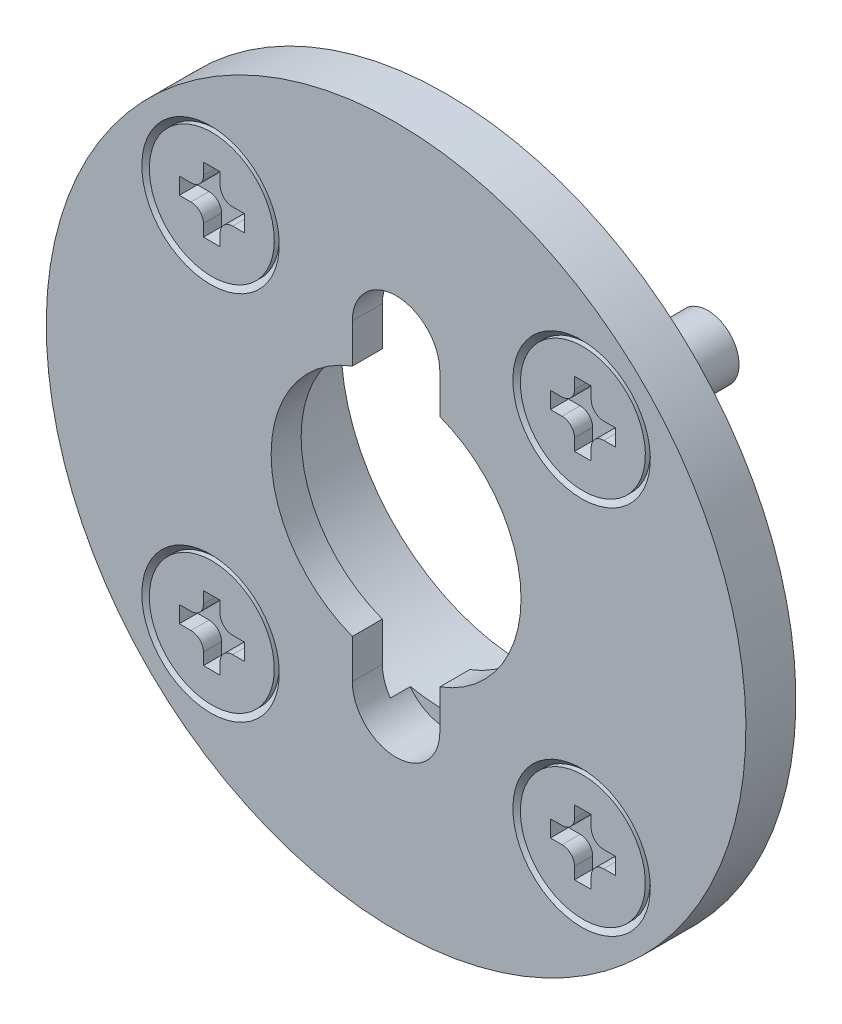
ISO-10303-21;
HEADER;
FILE_DESCRIPTION(('STEP AP214'),'2;1');
FILE_NAME('part.step','',(''),(''),'','','');
FILE_SCHEMA(('AUTOMOTIVE_DESIGN { 1 0 10303 214 1 1 1 1 }'));
ENDSEC;
DATA;
#1=APPLICATION_CONTEXT('core data for automotive mechanical design processes');
#2=APPLICATION_PROTOCOL_DEFINITION('international standard','automotive_design',2000,#1);
#3=PRODUCT_CONTEXT('',#1,'mechanical');
#4=PRODUCT('Part','Part','',(#3));
#5=PRODUCT_RELATED_PRODUCT_CATEGORY('part','',(#4));
#6=PRODUCT_DEFINITION_FORMATION('','',#4);
#7=PRODUCT_DEFINITION_CONTEXT('part definition',#1,'design');
#8=PRODUCT_DEFINITION('design','',#6,#7);
#9=PRODUCT_DEFINITION_SHAPE('','',#8);
#10=(LENGTH_UNIT() NAMED_UNIT(*) SI_UNIT(.MILLI.,.METRE.));
#11=(NAMED_UNIT(*) PLANE_ANGLE_UNIT() SI_UNIT($,.RADIAN.));
#12=(NAMED_UNIT(*) SI_UNIT($,.STERADIAN.) SOLID_ANGLE_UNIT());
#13=UNCERTAINTY_MEASURE_WITH_UNIT(LENGTH_MEASURE(1.E-05),#10,'distance_accuracy_value','');
#14=(GEOMETRIC_REPRESENTATION_CONTEXT(3) GLOBAL_UNCERTAINTY_ASSIGNED_CONTEXT((#13)) GLOBAL_UNIT_ASSIGNED_CONTEXT((#10,
#11,#12)) REPRESENTATION_CONTEXT('',''));
#15=CARTESIAN_POINT('',(0.,0.,0.));
#16=DIRECTION('',(0.,0.,1.));
#17=DIRECTION('',(1.,0.,0.));
#18=AXIS2_PLACEMENT_3D('',#15,#16,#17);
#19=CARTESIAN_POINT('',(0.,0.,2.));
#20=DIRECTION('',(0.,0.,-1.));
#21=DIRECTION('',(0.,1.,0.));
#22=AXIS2_PLACEMENT_3D('',#19,#20,#21);
#23=CYLINDRICAL_SURFACE('',#22,5.);
#24=DIRECTION('',(0.,0.,-1.));
#25=VECTOR('',#24,1.);
#26=CARTESIAN_POINT('',(-1.75,4.6837484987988,2.));
#27=LINE('',#26,#25);
#28=CARTESIAN_POINT('',(-1.75,4.6837484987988,2.));
#29=VERTEX_POINT('',#28);
#30=CARTESIAN_POINT('',(-1.75,4.68374849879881,0.800000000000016));
#31=VERTEX_POINT('',#30);
#32=EDGE_CURVE('E1493',#29,#31,#27,.T.);
#33=ORIENTED_EDGE('',*,*,#32,.F.);
#34=CARTESIAN_POINT('',(0.,0.,2.));
#35=DIRECTION('',(0.,0.,-1.));
#36=DIRECTION('',(0.,1.,0.));
#37=AXIS2_PLACEMENT_3D('',#34,#35,#36);
#38=CIRCLE('',#37,5.);
#39=CARTESIAN_POINT('',(-1.75,-4.6837484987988,2.));
#40=VERTEX_POINT('',#39);
#41=EDGE_CURVE('E1548',#40,#29,#38,.T.);
#42=ORIENTED_EDGE('',*,*,#41,.F.);
#43=DIRECTION('',(0.,0.,-1.));
#44=VECTOR('',#43,1.);
#45=CARTESIAN_POINT('',(-1.75,-4.6837484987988,2.));
#46=LINE('',#45,#44);
#47=CARTESIAN_POINT('',(-1.75,-4.6837484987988,0.799999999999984));
#48=VERTEX_POINT('',#47);
#49=EDGE_CURVE('E1491',#48,#40,#46,.F.);
#50=ORIENTED_EDGE('',*,*,#49,.F.);
#51=CARTESIAN_POINT('',(0.,0.,0.8));
#52=DIRECTION('',(0.,0.,-1.));
#53=DIRECTION('',(0.,1.,0.));
#54=AXIS2_PLACEMENT_3D('',#51,#52,#53);
#55=CIRCLE('',#54,5.);
#56=EDGE_CURVE('E1503',#31,#48,#55,.F.);
#57=ORIENTED_EDGE('',*,*,#56,.F.);
#58=EDGE_LOOP('',(#33,#42,#50,#57));
#59=FACE_BOUND('',#58,.T.);
#60=ADVANCED_FACE('F16',(#59),#23,.F.);
#61=DIRECTION('',(0.,0.,-1.));
#62=VECTOR('',#61,1.);
#63=CARTESIAN_POINT('',(1.75,-4.6837484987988,2.));
#64=LINE('',#63,#62);
#65=CARTESIAN_POINT('',(1.75,-4.6837484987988,2.));
#66=VERTEX_POINT('',#65);
#67=CARTESIAN_POINT('',(1.75,-4.6837484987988,0.799999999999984));
#68=VERTEX_POINT('',#67);
#69=EDGE_CURVE('E33',#66,#68,#64,.T.);
#70=ORIENTED_EDGE('',*,*,#69,.F.);
#71=CARTESIAN_POINT('',(0.,0.,2.));
#72=DIRECTION('',(0.,0.,-1.));
#73=DIRECTION('',(0.,1.,0.));
#74=AXIS2_PLACEMENT_3D('',#71,#72,#73);
#75=CIRCLE('',#74,5.);
#76=CARTESIAN_POINT('',(1.75,4.6837484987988,2.));
#77=VERTEX_POINT('',#76);
#78=EDGE_CURVE('E25',#77,#66,#75,.T.);
#79=ORIENTED_EDGE('',*,*,#78,.F.);
#80=DIRECTION('',(0.,0.,-1.));
#81=VECTOR('',#80,1.);
#82=CARTESIAN_POINT('',(1.75,4.6837484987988,2.));
#83=LINE('',#82,#81);
#84=CARTESIAN_POINT('',(1.75,4.68374849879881,0.800000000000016));
#85=VERTEX_POINT('',#84);
#86=EDGE_CURVE('E41',#85,#77,#83,.F.);
#87=ORIENTED_EDGE('',*,*,#86,.F.);
#88=EDGE_CURVE('E1498',#68,#85,#55,.F.);
#89=ORIENTED_EDGE('',*,*,#88,.F.);
#90=EDGE_LOOP('',(#70,#79,#87,#89));
#91=FACE_BOUND('',#90,.T.);
#92=ADVANCED_FACE('F1591',(#91),#23,.F.);
#93=CARTESIAN_POINT('',(-5.,0.,2.));
#94=DIRECTION('',(0.,0.,-1.));
#95=DIRECTION('',(0.,1.,0.));
#96=AXIS2_PLACEMENT_3D('',#93,#94,#95);
#97=PLANE('',#96);
#98=DIRECTION('',(0.,1.,0.));
#99=VECTOR('',#98,1.);
#100=CARTESIAN_POINT('',(1.75,0.,2.));
#101=LINE('',#100,#99);
#102=CARTESIAN_POINT('',(1.75,-6.25,2.));
#103=VERTEX_POINT('',#102);
#104=EDGE_CURVE('E10',#103,#66,#101,.T.);
#105=ORIENTED_EDGE('',*,*,#104,.F.);
#106=CARTESIAN_POINT('',(0.,-6.25,2.));
#107=DIRECTION('',(0.,0.,-1.));
#108=DIRECTION('',(0.,1.,0.));
#109=AXIS2_PLACEMENT_3D('',#106,#107,#108);
#110=CIRCLE('',#109,1.75);
#111=CARTESIAN_POINT('',(-1.75,-6.25,2.));
#112=VERTEX_POINT('',#111);
#113=EDGE_CURVE('E1540',#112,#103,#110,.F.);
#114=ORIENTED_EDGE('',*,*,#113,.F.);
#115=DIRECTION('',(0.,-1.,0.));
#116=VECTOR('',#115,1.);
#117=CARTESIAN_POINT('',(-1.75,0.,2.));
#118=LINE('',#117,#116);
#119=EDGE_CURVE('E1545',#40,#112,#118,.T.);
#120=ORIENTED_EDGE('',*,*,#119,.F.);
#121=ORIENTED_EDGE('',*,*,#41,.T.);
#122=DIRECTION('',(0.,-1.,0.));
#123=VECTOR('',#122,1.);
#124=CARTESIAN_POINT('',(-1.75,0.,2.));
#125=LINE('',#124,#123);
#126=CARTESIAN_POINT('',(-1.75,6.25,2.));
#127=VERTEX_POINT('',#126);
#128=EDGE_CURVE('E1551',#127,#29,#125,.T.);
#129=ORIENTED_EDGE('',*,*,#128,.F.);
#130=CARTESIAN_POINT('',(0.,6.25,2.));
#131=DIRECTION('',(0.,0.,-1.));
#132=DIRECTION('',(0.,1.,0.));
#133=AXIS2_PLACEMENT_3D('',#130,#131,#132);
#134=CIRCLE('',#133,1.75);
#135=CARTESIAN_POINT('',(1.75,6.25,2.));
#136=VERTEX_POINT('',#135);
#137=EDGE_CURVE('E1554',#136,#127,#134,.F.);
#138=ORIENTED_EDGE('',*,*,#137,.F.);
#139=DIRECTION('',(0.,1.,0.));
#140=VECTOR('',#139,1.);
#141=CARTESIAN_POINT('',(1.75,0.,2.));
#142=LINE('',#141,#140);
#143=EDGE_CURVE('E1557',#77,#136,#142,.T.);
#144=ORIENTED_EDGE('',*,*,#143,.F.);
#145=ORIENTED_EDGE('',*,*,#78,.T.);
#146=EDGE_LOOP('',(#105,#114,#120,#121,#129,#138,#144,#145));
#147=FACE_BOUND('',#146,.T.);
#148=CARTESIAN_POINT('',(0.,0.,2.));
#149=DIRECTION('',(0.,0.,-1.));
#150=DIRECTION('',(0.,1.,0.));
#151=AXIS2_PLACEMENT_3D('',#148,#149,#150);
#152=CIRCLE('',#151,14.);
#153=CARTESIAN_POINT('',(0.,14.,2.00000000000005));
#154=VERTEX_POINT('',#153);
#155=EDGE_CURVE('E1533',#154,#154,#152,.T.);
#156=ORIENTED_EDGE('',*,*,#155,.F.);
#157=EDGE_LOOP('',(#156));
#158=FACE_BOUND('',#157,.T.);
#159=CARTESIAN_POINT('',(-7.42462120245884,-7.42462120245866,1.99999999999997));
#160=DIRECTION('',(0.,0.,1.));
#161=DIRECTION('',(0.,-1.,0.));
#162=AXIS2_PLACEMENT_3D('',#159,#160,#161);
#163=CIRCLE('',#162,2.75);
#164=CARTESIAN_POINT('',(-7.42462120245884,-10.1746212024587,1.99999999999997));
#165=VERTEX_POINT('',#164);
#166=EDGE_CURVE('E1499',#165,#165,#163,.T.);
#167=ORIENTED_EDGE('',*,*,#166,.F.);
#168=EDGE_LOOP('',(#167));
#169=FACE_BOUND('',#168,.T.);
#170=CARTESIAN_POINT('',(7.42462120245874,-7.42462120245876,1.99999999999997));
#171=DIRECTION('',(0.,0.,1.));
#172=DIRECTION('',(0.,-1.,0.));
#173=AXIS2_PLACEMENT_3D('',#170,#171,#172);
#174=CIRCLE('',#173,2.75);
#175=CARTESIAN_POINT('',(7.42462120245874,-10.1746212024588,1.99999999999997));
#176=VERTEX_POINT('',#175);
#177=EDGE_CURVE('E1502',#176,#176,#174,.T.);
#178=ORIENTED_EDGE('',*,*,#177,.F.);
#179=EDGE_LOOP('',(#178));
#180=FACE_BOUND('',#179,.T.);
#181=CARTESIAN_POINT('',(7.42462120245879,7.42462120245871,2.00000000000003));
#182=DIRECTION('',(0.,0.,1.));
#183=DIRECTION('',(0.,-1.,0.));
#184=AXIS2_PLACEMENT_3D('',#181,#182,#183);
#185=CIRCLE('',#184,2.75);
#186=CARTESIAN_POINT('',(7.42462120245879,4.67462120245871,2.00000000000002));
#187=VERTEX_POINT('',#186);
#188=EDGE_CURVE('E1506',#187,#187,#185,.T.);
#189=ORIENTED_EDGE('',*,*,#188,.F.);
#190=EDGE_LOOP('',(#189));
#191=FACE_BOUND('',#190,.T.);
#192=CARTESIAN_POINT('',(-7.42462120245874,7.42462120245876,2.00000000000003));
#193=DIRECTION('',(0.,0.,1.));
#194=DIRECTION('',(0.,-1.,0.));
#195=AXIS2_PLACEMENT_3D('',#192,#193,#194);
#196=CIRCLE('',#195,2.75);
#197=CARTESIAN_POINT('',(-7.42462120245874,4.67462120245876,2.00000000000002));
#198=VERTEX_POINT('',#197);
#199=EDGE_CURVE('E1509',#198,#198,#196,.T.);
#200=ORIENTED_EDGE('',*,*,#199,.F.);
#201=EDGE_LOOP('',(#200));
#202=FACE_BOUND('',#201,.T.);
#203=ADVANCED_FACE('F1598',(#147,#158,#169,#180,#191,#202),#97,.F.);
#204=CARTESIAN_POINT('',(-5.,0.,0.8));
#205=DIRECTION('',(0.,0.,-1.));
#206=DIRECTION('',(0.,1.,0.));
#207=AXIS2_PLACEMENT_3D('',#204,#205,#206);
#208=PLANE('',#207);
#209=DIRECTION('',(0.,-1.,0.));
#210=VECTOR('',#209,1.);
#211=CARTESIAN_POINT('',(-1.75,0.,0.8));
#212=LINE('',#211,#210);
#213=CARTESIAN_POINT('',(-1.75,-6.25,0.799999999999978));
#214=VERTEX_POINT('',#213);
#215=EDGE_CURVE('E1527',#48,#214,#212,.T.);
#216=ORIENTED_EDGE('',*,*,#215,.T.);
#217=CARTESIAN_POINT('',(0.,-6.25,0.799999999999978));
#218=DIRECTION('',(0.,0.,-1.));
#219=DIRECTION('',(0.,1.,0.));
#220=AXIS2_PLACEMENT_3D('',#217,#218,#219);
#221=CIRCLE('',#220,1.75);
#222=CARTESIAN_POINT('',(-1.42855989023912,-7.2608,0.799999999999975));
#223=VERTEX_POINT('',#222);
#224=EDGE_CURVE('E1483',#214,#223,#221,.F.);
#225=ORIENTED_EDGE('',*,*,#224,.T.);
#226=CARTESIAN_POINT('',(0.,0.,0.8));
#227=DIRECTION('',(0.,0.,-1.));
#228=DIRECTION('',(0.,1.,0.));
#229=AXIS2_PLACEMENT_3D('',#226,#227,#228);
#230=CIRCLE('',#229,7.4);
#231=CARTESIAN_POINT('',(-1.42855989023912,7.2608,0.800000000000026));
#232=VERTEX_POINT('',#231);
#233=EDGE_CURVE('E1519',#223,#232,#230,.T.);
#234=ORIENTED_EDGE('',*,*,#233,.T.);
#235=CARTESIAN_POINT('',(0.,6.25,0.800000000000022));
#236=DIRECTION('',(0.,0.,-1.));
#237=DIRECTION('',(0.,1.,0.));
#238=AXIS2_PLACEMENT_3D('',#235,#236,#237);
#239=CIRCLE('',#238,1.75);
#240=CARTESIAN_POINT('',(-1.75,6.25,0.800000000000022));
#241=VERTEX_POINT('',#240);
#242=EDGE_CURVE('E1473',#232,#241,#239,.F.);
#243=ORIENTED_EDGE('',*,*,#242,.T.);
#244=EDGE_CURVE('E1524',#241,#31,#212,.T.);
#245=ORIENTED_EDGE('',*,*,#244,.T.);
#246=ORIENTED_EDGE('',*,*,#56,.T.);
#247=EDGE_LOOP('',(#216,#225,#234,#243,#245,#246));
#248=FACE_BOUND('',#247,.T.);
#249=ADVANCED_FACE('F1657',(#248),#208,.T.);
#250=CARTESIAN_POINT('',(0.,0.,0.8));
#251=DIRECTION('',(0.,0.,-1.));
#252=DIRECTION('',(0.,1.,0.));
#253=AXIS2_PLACEMENT_3D('',#250,#251,#252);
#254=CIRCLE('',#253,7.4);
#255=CARTESIAN_POINT('',(1.42855989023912,-7.2608,0.799999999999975));
#256=VERTEX_POINT('',#255);
#257=CARTESIAN_POINT('',(1.42855989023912,7.2608,0.800000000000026));
#258=VERTEX_POINT('',#257);
#259=EDGE_CURVE('E1512',#256,#258,#254,.F.);
#260=ORIENTED_EDGE('',*,*,#259,.F.);
#261=CARTESIAN_POINT('',(1.75,-6.25,0.799999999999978));
#262=VERTEX_POINT('',#261);
#263=EDGE_CURVE('E1487',#256,#262,#221,.F.);
#264=ORIENTED_EDGE('',*,*,#263,.T.);
#265=DIRECTION('',(0.,1.,0.));
#266=VECTOR('',#265,1.);
#267=CARTESIAN_POINT('',(1.75,0.,0.8));
#268=LINE('',#267,#266);
#269=EDGE_CURVE('E1523',#262,#68,#268,.T.);
#270=ORIENTED_EDGE('',*,*,#269,.T.);
#271=ORIENTED_EDGE('',*,*,#88,.T.);
#272=CARTESIAN_POINT('',(1.75,6.25,0.800000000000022));
#273=VERTEX_POINT('',#272);
#274=EDGE_CURVE('E1520',#85,#273,#268,.T.);
#275=ORIENTED_EDGE('',*,*,#274,.T.);
#276=EDGE_CURVE('E1477',#273,#258,#239,.F.);
#277=ORIENTED_EDGE('',*,*,#276,.T.);
#278=EDGE_LOOP('',(#260,#264,#270,#271,#275,#277));
#279=FACE_BOUND('',#278,.T.);
#280=ADVANCED_FACE('F1666',(#279),#208,.T.);
#281=CARTESIAN_POINT('',(0.,0.,22.9303607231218));
#282=DIRECTION('',(0.,0.,-1.));
#283=DIRECTION('',(0.,1.,0.));
#284=AXIS2_PLACEMENT_3D('',#281,#282,#283);
#285=CYLINDRICAL_SURFACE('',#284,7.4);
#286=CARTESIAN_POINT('',(0.,0.,-3.2));
#287=DIRECTION('',(0.,0.,-1.));
#288=DIRECTION('',(0.,1.,0.));
#289=AXIS2_PLACEMENT_3D('',#286,#287,#288);
#290=CIRCLE('',#289,7.4);
#291=CARTESIAN_POINT('',(0.,7.40000000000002,-3.19999999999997));
#292=VERTEX_POINT('',#291);
#293=EDGE_CURVE('E1495',#292,#292,#290,.T.);
#294=ORIENTED_EDGE('',*,*,#293,.T.);
#295=EDGE_LOOP('',(#294));
#296=FACE_BOUND('',#295,.T.);
#297=DIRECTION('',(0.,0.,1.));
#298=VECTOR('',#297,1.);
#299=CARTESIAN_POINT('',(-1.42855989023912,-7.2608,0.999999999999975));
#300=LINE('',#299,#298);
#301=CARTESIAN_POINT('',(-1.42855989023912,-7.2608,0.));
#302=VERTEX_POINT('',#301);
#303=EDGE_CURVE('E1480',#302,#223,#300,.T.);
#304=ORIENTED_EDGE('',*,*,#303,.F.);
#305=CARTESIAN_POINT('',(0.,0.,0.));
#306=DIRECTION('',(0.,0.,-1.));
#307=DIRECTION('',(0.,1.,0.));
#308=AXIS2_PLACEMENT_3D('',#305,#306,#307);
#309=CIRCLE('',#308,7.4);
#310=CARTESIAN_POINT('',(1.42855989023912,-7.2608,0.));
#311=VERTEX_POINT('',#310);
#312=EDGE_CURVE('E1518',#302,#311,#309,.F.);
#313=ORIENTED_EDGE('',*,*,#312,.T.);
#314=DIRECTION('',(0.,0.,1.));
#315=VECTOR('',#314,1.);
#316=CARTESIAN_POINT('',(1.42855989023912,-7.2608,0.999999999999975));
#317=LINE('',#316,#315);
#318=EDGE_CURVE('E1486',#256,#311,#317,.F.);
#319=ORIENTED_EDGE('',*,*,#318,.F.);
#320=ORIENTED_EDGE('',*,*,#259,.T.);
#321=DIRECTION('',(0.,0.,1.));
#322=VECTOR('',#321,1.);
#323=CARTESIAN_POINT('',(1.42855989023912,7.2608,1.00000000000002));
#324=LINE('',#323,#322);
#325=CARTESIAN_POINT('',(1.42855989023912,7.2608,0.));
#326=VERTEX_POINT('',#325);
#327=EDGE_CURVE('E1476',#326,#258,#324,.T.);
#328=ORIENTED_EDGE('',*,*,#327,.F.);
#329=CARTESIAN_POINT('',(-1.42855989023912,7.2608,0.));
#330=VERTEX_POINT('',#329);
#331=EDGE_CURVE('E1515',#326,#330,#309,.F.);
#332=ORIENTED_EDGE('',*,*,#331,.T.);
#333=DIRECTION('',(0.,0.,1.));
#334=VECTOR('',#333,1.);
#335=CARTESIAN_POINT('',(-1.42855989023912,7.2608,1.00000000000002));
#336=LINE('',#335,#334);
#337=EDGE_CURVE('E1471',#232,#330,#336,.F.);
#338=ORIENTED_EDGE('',*,*,#337,.F.);
#339=ORIENTED_EDGE('',*,*,#233,.F.);
#340=EDGE_LOOP('',(#304,#313,#319,#320,#328,#332,#338,#339));
#341=FACE_BOUND('',#340,.T.);
#342=ADVANCED_FACE('F1663',(#296,#341),#285,.F.);
#343=CARTESIAN_POINT('',(-8.5,0.,-3.2));
#344=DIRECTION('',(0.,0.,1.));
#345=DIRECTION('',(0.,-1.,0.));
#346=AXIS2_PLACEMENT_3D('',#343,#344,#345);
#347=PLANE('',#346);
#348=CARTESIAN_POINT('',(0.,0.,-3.2));
#349=DIRECTION('',(0.,0.,1.));
#350=DIRECTION('',(0.,-1.,0.));
#351=AXIS2_PLACEMENT_3D('',#348,#349,#350);
#352=CIRCLE('',#351,8.5);
#353=CARTESIAN_POINT('',(0.,-8.49999999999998,-3.20000000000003));
#354=VERTEX_POINT('',#353);
#355=EDGE_CURVE('E1530',#354,#354,#352,.F.);
#356=ORIENTED_EDGE('',*,*,#355,.T.);
#357=EDGE_LOOP('',(#356));
#358=FACE_BOUND('',#357,.T.);
#359=ORIENTED_EDGE('',*,*,#293,.F.);
#360=EDGE_LOOP('',(#359));
#361=FACE_BOUND('',#360,.T.);
#362=ADVANCED_FACE('F1678',(#358,#361),#347,.F.);
#363=CARTESIAN_POINT('',(0.,0.,2.));
#364=DIRECTION('',(0.,0.,-1.));
#365=DIRECTION('',(0.,1.,0.));
#366=AXIS2_PLACEMENT_3D('',#363,#364,#365);
#367=CYLINDRICAL_SURFACE('',#366,14.);
#368=CARTESIAN_POINT('',(0.,0.,0.));
#369=DIRECTION('',(0.,0.,1.));
#370=DIRECTION('',(0.,-1.,0.));
#371=AXIS2_PLACEMENT_3D('',#368,#369,#370);
#372=CIRCLE('',#371,14.);
#373=CARTESIAN_POINT('',(0.,-14.,0.));
#374=VERTEX_POINT('',#373);
#375=EDGE_CURVE('E1537',#374,#374,#372,.F.);
#376=ORIENTED_EDGE('',*,*,#375,.F.);
#377=EDGE_LOOP('',(#376));
#378=FACE_BOUND('',#377,.T.);
#379=ORIENTED_EDGE('',*,*,#155,.T.);
#380=EDGE_LOOP('',(#379));
#381=FACE_BOUND('',#380,.T.);
#382=ADVANCED_FACE('F1700',(#378,#381),#367,.T.);
#383=CARTESIAN_POINT('',(-14.,0.,0.));
#384=DIRECTION('',(0.,0.,1.));
#385=DIRECTION('',(0.,-1.,0.));
#386=AXIS2_PLACEMENT_3D('',#383,#384,#385);
#387=PLANE('',#386);
#388=CARTESIAN_POINT('',(-7.42462120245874,-7.42462120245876,0.));
#389=DIRECTION('',(0.,0.,1.));
#390=DIRECTION('',(0.,-1.,0.));
#391=AXIS2_PLACEMENT_3D('',#388,#389,#390);
#392=CIRCLE('',#391,1.25);
#393=CARTESIAN_POINT('',(-7.42462120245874,-8.67462120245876,0.));
#394=VERTEX_POINT('',#393);
#395=EDGE_CURVE('E20',#394,#394,#392,.T.);
#396=ORIENTED_EDGE('',*,*,#395,.T.);
#397=EDGE_LOOP('',(#396));
#398=FACE_BOUND('',#397,.T.);
#399=CARTESIAN_POINT('',(-7.42462120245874,7.42462120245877,0.));
#400=DIRECTION('',(0.,0.,1.));
#401=DIRECTION('',(0.,-1.,0.));
#402=AXIS2_PLACEMENT_3D('',#399,#400,#401);
#403=CIRCLE('',#402,1.25);
#404=CARTESIAN_POINT('',(-7.42462120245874,6.17462120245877,0.));
#405=VERTEX_POINT('',#404);
#406=EDGE_CURVE('E976',#405,#405,#403,.T.);
#407=ORIENTED_EDGE('',*,*,#406,.T.);
#408=EDGE_LOOP('',(#407));
#409=FACE_BOUND('',#408,.T.);
#410=CARTESIAN_POINT('',(7.42462120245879,7.42462120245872,0.));
#411=DIRECTION('',(0.,0.,1.));
#412=DIRECTION('',(0.,-1.,0.));
#413=AXIS2_PLACEMENT_3D('',#410,#411,#412);
#414=CIRCLE('',#413,1.25);
#415=CARTESIAN_POINT('',(7.42462120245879,6.17462120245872,0.));
#416=VERTEX_POINT('',#415);
#417=EDGE_CURVE('E1216',#416,#416,#414,.T.);
#418=ORIENTED_EDGE('',*,*,#417,.T.);
#419=EDGE_LOOP('',(#418));
#420=FACE_BOUND('',#419,.T.);
#421=CARTESIAN_POINT('',(7.42462120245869,-7.4246212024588,0.));
#422=DIRECTION('',(0.,0.,1.));
#423=DIRECTION('',(0.,-1.,0.));
#424=AXIS2_PLACEMENT_3D('',#421,#422,#423);
#425=CIRCLE('',#424,1.25);
#426=CARTESIAN_POINT('',(7.42462120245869,-8.6746212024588,0.));
#427=VERTEX_POINT('',#426);
#428=EDGE_CURVE('E1456',#427,#427,#425,.T.);
#429=ORIENTED_EDGE('',*,*,#428,.T.);
#430=EDGE_LOOP('',(#429));
#431=FACE_BOUND('',#430,.T.);
#432=ORIENTED_EDGE('',*,*,#375,.T.);
#433=EDGE_LOOP('',(#432));
#434=FACE_BOUND('',#433,.T.);
#435=CARTESIAN_POINT('',(0.,0.,0.));
#436=DIRECTION('',(0.,0.,1.));
#437=DIRECTION('',(0.,-1.,0.));
#438=AXIS2_PLACEMENT_3D('',#435,#436,#437);
#439=CIRCLE('',#438,8.5);
#440=CARTESIAN_POINT('',(0.,-8.49999999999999,0.));
#441=VERTEX_POINT('',#440);
#442=EDGE_CURVE('E1534',#441,#441,#439,.F.);
#443=ORIENTED_EDGE('',*,*,#442,.F.);
#444=EDGE_LOOP('',(#443));
#445=FACE_BOUND('',#444,.T.);
#446=ADVANCED_FACE('F1566',(#398,#409,#420,#431,#434,#445),#387,.F.);
#447=CARTESIAN_POINT('',(0.,0.,2.));
#448=DIRECTION('',(0.,0.,-1.));
#449=DIRECTION('',(0.,1.,0.));
#450=AXIS2_PLACEMENT_3D('',#447,#448,#449);
#451=CYLINDRICAL_SURFACE('',#450,8.5);
#452=ORIENTED_EDGE('',*,*,#355,.F.);
#453=EDGE_LOOP('',(#452));
#454=FACE_BOUND('',#453,.T.);
#455=ORIENTED_EDGE('',*,*,#442,.T.);
#456=EDGE_LOOP('',(#455));
#457=FACE_BOUND('',#456,.T.);
#458=ADVANCED_FACE('F1693',(#454,#457),#451,.T.);
#459=CARTESIAN_POINT('',(-7.42462120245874,7.42462120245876,2.00000000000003));
#460=DIRECTION('',(0.,0.,1.));
#461=DIRECTION('',(0.,-1.,0.));
#462=AXIS2_PLACEMENT_3D('',#459,#460,#461);
#463=CONICAL_SURFACE('',#462,2.75,0.785398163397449);
#464=CARTESIAN_POINT('',(-7.42462120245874,7.42462120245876,1.75000000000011));
#465=DIRECTION('',(0.,0.,1.));
#466=DIRECTION('',(1.,0.,0.));
#467=AXIS2_PLACEMENT_3D('',#464,#465,#466);
#468=CIRCLE('',#467,2.5);
#469=CARTESIAN_POINT('',(-4.92462120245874,7.42462120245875,1.75000000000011));
#470=VERTEX_POINT('',#469);
#471=EDGE_CURVE('E737',#470,#470,#468,.F.);
#472=ORIENTED_EDGE('',*,*,#471,.T.);
#473=EDGE_LOOP('',(#472));
#474=FACE_BOUND('',#473,.T.);
#475=ORIENTED_EDGE('',*,*,#199,.T.);
#476=EDGE_LOOP('',(#475));
#477=FACE_BOUND('',#476,.T.);
#478=ADVANCED_FACE('F1689',(#474,#477),#463,.F.);
#479=CARTESIAN_POINT('',(7.42462120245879,7.42462120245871,2.00000000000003));
#480=DIRECTION('',(0.,0.,1.));
#481=DIRECTION('',(0.,-1.,0.));
#482=AXIS2_PLACEMENT_3D('',#479,#480,#481);
#483=CONICAL_SURFACE('',#482,2.75,0.785398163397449);
#484=CARTESIAN_POINT('',(7.42462120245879,7.42462120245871,1.75000000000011));
#485=DIRECTION('',(0.,0.,1.));
#486=DIRECTION('',(0.,-1.,0.));
#487=AXIS2_PLACEMENT_3D('',#484,#485,#486);
#488=CIRCLE('',#487,2.5);
#489=CARTESIAN_POINT('',(7.42462120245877,4.92462120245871,1.7500000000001));
#490=VERTEX_POINT('',#489);
#491=EDGE_CURVE('E977',#490,#490,#488,.F.);
#492=ORIENTED_EDGE('',*,*,#491,.T.);
#493=EDGE_LOOP('',(#492));
#494=FACE_BOUND('',#493,.T.);
#495=ORIENTED_EDGE('',*,*,#188,.T.);
#496=EDGE_LOOP('',(#495));
#497=FACE_BOUND('',#496,.T.);
#498=ADVANCED_FACE('F1685',(#494,#497),#483,.F.);
#499=CARTESIAN_POINT('',(7.42462120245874,-7.42462120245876,1.99999999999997));
#500=DIRECTION('',(0.,0.,1.));
#501=DIRECTION('',(0.,-1.,0.));
#502=AXIS2_PLACEMENT_3D('',#499,#500,#501);
#503=CONICAL_SURFACE('',#502,2.75,0.785398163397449);
#504=CARTESIAN_POINT('',(7.42462120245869,-7.42462120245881,1.75000000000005));
#505=DIRECTION('',(0.,0.,1.));
#506=DIRECTION('',(-1.,0.,0.));
#507=AXIS2_PLACEMENT_3D('',#504,#505,#506);
#508=CIRCLE('',#507,2.5);
#509=CARTESIAN_POINT('',(4.92462120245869,-7.42462120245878,1.75000000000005));
#510=VERTEX_POINT('',#509);
#511=EDGE_CURVE('E1451',#510,#510,#508,.F.);
#512=ORIENTED_EDGE('',*,*,#511,.T.);
#513=EDGE_LOOP('',(#512));
#514=FACE_BOUND('',#513,.T.);
#515=ORIENTED_EDGE('',*,*,#177,.T.);
#516=EDGE_LOOP('',(#515));
#517=FACE_BOUND('',#516,.T.);
#518=ADVANCED_FACE('F1616',(#514,#517),#503,.F.);
#519=CARTESIAN_POINT('',(-7.42462120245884,-7.42462120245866,1.99999999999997));
#520=DIRECTION('',(0.,0.,1.));
#521=DIRECTION('',(0.,-1.,0.));
#522=AXIS2_PLACEMENT_3D('',#519,#520,#521);
#523=CONICAL_SURFACE('',#522,2.75,0.785398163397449);
#524=CARTESIAN_POINT('',(-7.42462120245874,-7.42462120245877,1.75000000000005));
#525=DIRECTION('',(0.,0.,1.));
#526=DIRECTION('',(0.,1.,0.));
#527=AXIS2_PLACEMENT_3D('',#524,#525,#526);
#528=CIRCLE('',#527,2.5);
#529=CARTESIAN_POINT('',(-7.42462120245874,-4.92462120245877,1.75000000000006));
#530=VERTEX_POINT('',#529);
#531=EDGE_CURVE('E503',#530,#530,#528,.F.);
#532=ORIENTED_EDGE('',*,*,#531,.T.);
#533=EDGE_LOOP('',(#532));
#534=FACE_BOUND('',#533,.T.);
#535=ORIENTED_EDGE('',*,*,#166,.T.);
#536=EDGE_LOOP('',(#535));
#537=FACE_BOUND('',#536,.T.);
#538=ADVANCED_FACE('F1605',(#534,#537),#523,.F.);
#539=CARTESIAN_POINT('',(0.,6.25,0.));
#540=DIRECTION('',(0.,0.,1.));
#541=DIRECTION('',(0.,-1.,0.));
#542=AXIS2_PLACEMENT_3D('',#539,#540,#541);
#543=CYLINDRICAL_SURFACE('',#542,1.75);
#544=DIRECTION('',(0.,0.,1.));
#545=VECTOR('',#544,1.);
#546=CARTESIAN_POINT('',(1.75,6.25,0.));
#547=LINE('',#546,#545);
#548=EDGE_CURVE('E1465',#273,#136,#547,.T.);
#549=ORIENTED_EDGE('',*,*,#548,.T.);
#550=ORIENTED_EDGE('',*,*,#137,.T.);
#551=DIRECTION('',(0.,0.,1.));
#552=VECTOR('',#551,1.);
#553=CARTESIAN_POINT('',(-1.75,6.25,0.));
#554=LINE('',#553,#552);
#555=EDGE_CURVE('E1467',#241,#127,#554,.T.);
#556=ORIENTED_EDGE('',*,*,#555,.F.);
#557=ORIENTED_EDGE('',*,*,#242,.F.);
#558=ORIENTED_EDGE('',*,*,#337,.T.);
#559=CARTESIAN_POINT('',(0.,6.25,0.));
#560=DIRECTION('',(0.,0.,-1.));
#561=DIRECTION('',(0.,1.,0.));
#562=AXIS2_PLACEMENT_3D('',#559,#560,#561);
#563=CIRCLE('',#562,1.75);
#564=EDGE_CURVE('E1460',#330,#326,#563,.T.);
#565=ORIENTED_EDGE('',*,*,#564,.T.);
#566=ORIENTED_EDGE('',*,*,#327,.T.);
#567=ORIENTED_EDGE('',*,*,#276,.F.);
#568=EDGE_LOOP('',(#549,#550,#556,#557,#558,#565,#566,#567));
#569=FACE_BOUND('',#568,.T.);
#570=ADVANCED_FACE('F1602',(#569),#543,.F.);
#571=CARTESIAN_POINT('',(0.,-6.25,0.));
#572=DIRECTION('',(0.,0.,-1.));
#573=DIRECTION('',(0.,1.,0.));
#574=AXIS2_PLACEMENT_3D('',#571,#572,#573);
#575=PLANE('',#574);
#576=ORIENTED_EDGE('',*,*,#564,.F.);
#577=ORIENTED_EDGE('',*,*,#331,.F.);
#578=EDGE_LOOP('',(#576,#577));
#579=FACE_BOUND('',#578,.T.);
#580=ADVANCED_FACE('F1604',(#579),#575,.F.);
#581=CARTESIAN_POINT('',(1.75,-6.25,0.));
#582=DIRECTION('',(-1.,0.,0.));
#583=DIRECTION('',(0.,-1.,0.));
#584=AXIS2_PLACEMENT_3D('',#581,#582,#583);
#585=PLANE('',#584);
#586=ORIENTED_EDGE('',*,*,#86,.T.);
#587=ORIENTED_EDGE('',*,*,#143,.T.);
#588=ORIENTED_EDGE('',*,*,#548,.F.);
#589=ORIENTED_EDGE('',*,*,#274,.F.);
#590=EDGE_LOOP('',(#586,#587,#588,#589));
#591=FACE_BOUND('',#590,.T.);
#592=ADVANCED_FACE('F1612',(#591),#585,.T.);
#593=CARTESIAN_POINT('',(-1.75,-6.25,0.));
#594=DIRECTION('',(1.,0.,0.));
#595=DIRECTION('',(0.,1.,0.));
#596=AXIS2_PLACEMENT_3D('',#593,#594,#595);
#597=PLANE('',#596);
#598=ORIENTED_EDGE('',*,*,#555,.T.);
#599=ORIENTED_EDGE('',*,*,#128,.T.);
#600=ORIENTED_EDGE('',*,*,#32,.T.);
#601=ORIENTED_EDGE('',*,*,#244,.F.);
#602=EDGE_LOOP('',(#598,#599,#600,#601));
#603=FACE_BOUND('',#602,.T.);
#604=ADVANCED_FACE('F1600',(#603),#597,.T.);
#605=ORIENTED_EDGE('',*,*,#49,.T.);
#606=ORIENTED_EDGE('',*,*,#119,.T.);
#607=DIRECTION('',(0.,0.,1.));
#608=VECTOR('',#607,1.);
#609=CARTESIAN_POINT('',(-1.75,-6.25,0.));
#610=LINE('',#609,#608);
#611=EDGE_CURVE('E1469',#214,#112,#610,.T.);
#612=ORIENTED_EDGE('',*,*,#611,.F.);
#613=ORIENTED_EDGE('',*,*,#215,.F.);
#614=EDGE_LOOP('',(#605,#606,#612,#613));
#615=FACE_BOUND('',#614,.T.);
#616=ADVANCED_FACE('F1632',(#615),#597,.T.);
#617=DIRECTION('',(0.,0.,1.));
#618=VECTOR('',#617,1.);
#619=CARTESIAN_POINT('',(1.75,-6.25,0.));
#620=LINE('',#619,#618);
#621=EDGE_CURVE('E1463',#262,#103,#620,.T.);
#622=ORIENTED_EDGE('',*,*,#621,.T.);
#623=ORIENTED_EDGE('',*,*,#104,.T.);
#624=ORIENTED_EDGE('',*,*,#69,.T.);
#625=ORIENTED_EDGE('',*,*,#269,.F.);
#626=EDGE_LOOP('',(#622,#623,#624,#625));
#627=FACE_BOUND('',#626,.T.);
#628=ADVANCED_FACE('F18',(#627),#585,.T.);
#629=CARTESIAN_POINT('',(0.,-6.25,0.));
#630=DIRECTION('',(0.,0.,-1.));
#631=DIRECTION('',(0.,1.,0.));
#632=AXIS2_PLACEMENT_3D('',#629,#630,#631);
#633=CIRCLE('',#632,1.75);
#634=EDGE_CURVE('E1457',#311,#302,#633,.T.);
#635=ORIENTED_EDGE('',*,*,#634,.F.);
#636=ORIENTED_EDGE('',*,*,#312,.F.);
#637=EDGE_LOOP('',(#635,#636));
#638=FACE_BOUND('',#637,.T.);
#639=ADVANCED_FACE('F1615',(#638),#575,.F.);
#640=CARTESIAN_POINT('',(0.,-6.25,0.));
#641=DIRECTION('',(0.,0.,1.));
#642=DIRECTION('',(0.,-1.,0.));
#643=AXIS2_PLACEMENT_3D('',#640,#641,#642);
#644=CYLINDRICAL_SURFACE('',#643,1.75);
#645=ORIENTED_EDGE('',*,*,#611,.T.);
#646=ORIENTED_EDGE('',*,*,#113,.T.);
#647=ORIENTED_EDGE('',*,*,#621,.F.);
#648=ORIENTED_EDGE('',*,*,#263,.F.);
#649=ORIENTED_EDGE('',*,*,#318,.T.);
#650=ORIENTED_EDGE('',*,*,#634,.T.);
#651=ORIENTED_EDGE('',*,*,#303,.T.);
#652=ORIENTED_EDGE('',*,*,#224,.F.);
#653=EDGE_LOOP('',(#645,#646,#647,#648,#649,#650,#651,#652));
#654=FACE_BOUND('',#653,.T.);
#655=ADVANCED_FACE('F1641',(#654),#644,.F.);
#656=CARTESIAN_POINT('',(7.42462120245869,-7.42462120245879,-3.04999999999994));
#657=DIRECTION('',(0.,0.,-1.));
#658=DIRECTION('',(1.,1.92315803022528E-10,0.));
#659=AXIS2_PLACEMENT_3D('',#656,#657,#658);
#660=CYLINDRICAL_SURFACE('',#659,2.5);
#661=ORIENTED_EDGE('',*,*,#511,.F.);
#662=EDGE_LOOP('',(#661));
#663=FACE_BOUND('',#662,.T.);
#664=CARTESIAN_POINT('',(7.42462120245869,-7.42462120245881,1.95000000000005));
#665=DIRECTION('',(0.,0.,1.));
#666=DIRECTION('',(-1.,0.,0.));
#667=AXIS2_PLACEMENT_3D('',#664,#665,#666);
#668=CIRCLE('',#667,2.5);
#669=CARTESIAN_POINT('',(4.92462120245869,-7.42462120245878,1.95000000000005));
#670=VERTEX_POINT('',#669);
#671=EDGE_CURVE('E1217',#670,#670,#668,.F.);
#672=ORIENTED_EDGE('',*,*,#671,.T.);
#673=EDGE_LOOP('',(#672));
#674=FACE_BOUND('',#673,.T.);
#675=ADVANCED_FACE('F1710',(#663,#674),#660,.T.);
#676=CARTESIAN_POINT('',(8.72462120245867,-8.72462120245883,1.22500000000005));
#677=DIRECTION('',(0.,0.,1.));
#678=DIRECTION('',(0.,1.,0.));
#679=AXIS2_PLACEMENT_3D('',#676,#677,#678);
#680=PLANE('',#679);
#681=DIRECTION('',(0.,-1.,0.));
#682=VECTOR('',#681,1.);
#683=CARTESIAN_POINT('',(8.72462120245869,-7.0912878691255,1.22500000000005));
#684=LINE('',#683,#682);
#685=CARTESIAN_POINT('',(8.72462120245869,-7.0912878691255,1.22500000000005));
#686=VERTEX_POINT('',#685);
#687=CARTESIAN_POINT('',(8.72462120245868,-7.75795453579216,1.22500000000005));
#688=VERTEX_POINT('',#687);
#689=EDGE_CURVE('E1300',#686,#688,#684,.T.);
#690=ORIENTED_EDGE('',*,*,#689,.F.);
#691=DIRECTION('',(1.,0.,0.));
#692=VECTOR('',#691,1.);
#693=CARTESIAN_POINT('',(8.25795453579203,-7.0912878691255,1.22500000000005));
#694=LINE('',#693,#692);
#695=CARTESIAN_POINT('',(8.25795453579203,-7.0912878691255,1.22500000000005));
#696=VERTEX_POINT('',#695);
#697=EDGE_CURVE('E1446',#696,#686,#694,.T.);
#698=ORIENTED_EDGE('',*,*,#697,.F.);
#699=CARTESIAN_POINT('',(8.25795453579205,-6.59128786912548,1.22500000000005));
#700=DIRECTION('',(0.,0.,1.));
#701=DIRECTION('',(-1.,0.,0.));
#702=AXIS2_PLACEMENT_3D('',#699,#700,#701);
#703=CIRCLE('',#702,0.500000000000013);
#704=CARTESIAN_POINT('',(7.75795453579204,-6.59128786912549,1.22500000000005));
#705=VERTEX_POINT('',#704);
#706=EDGE_CURVE('E1437',#696,#705,#703,.F.);
#707=ORIENTED_EDGE('',*,*,#706,.T.);
#708=DIRECTION('',(0.,-1.,0.));
#709=VECTOR('',#708,1.);
#710=CARTESIAN_POINT('',(7.75795453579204,-6.12462120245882,1.22500000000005));
#711=LINE('',#710,#709);
#712=CARTESIAN_POINT('',(7.75795453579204,-6.12462120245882,1.22500000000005));
#713=VERTEX_POINT('',#712);
#714=EDGE_CURVE('E1427',#713,#705,#711,.T.);
#715=ORIENTED_EDGE('',*,*,#714,.F.);
#716=DIRECTION('',(1.,0.,0.));
#717=VECTOR('',#716,1.);
#718=CARTESIAN_POINT('',(7.09128786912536,-6.12462120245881,1.22500000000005));
#719=LINE('',#718,#717);
#720=CARTESIAN_POINT('',(7.09128786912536,-6.12462120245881,1.22500000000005));
#721=VERTEX_POINT('',#720);
#722=EDGE_CURVE('E1417',#721,#713,#719,.T.);
#723=ORIENTED_EDGE('',*,*,#722,.F.);
#724=DIRECTION('',(0.,1.,0.));
#725=VECTOR('',#724,1.);
#726=CARTESIAN_POINT('',(7.09128786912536,-6.59128786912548,1.22500000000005));
#727=LINE('',#726,#725);
#728=CARTESIAN_POINT('',(7.09128786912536,-6.59128786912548,1.22500000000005));
#729=VERTEX_POINT('',#728);
#730=EDGE_CURVE('E1407',#729,#721,#727,.T.);
#731=ORIENTED_EDGE('',*,*,#730,.F.);
#732=CARTESIAN_POINT('',(6.59128786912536,-6.59128786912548,1.22500000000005));
#733=DIRECTION('',(0.,0.,1.));
#734=DIRECTION('',(0.,-1.,0.));
#735=AXIS2_PLACEMENT_3D('',#732,#733,#734);
#736=CIRCLE('',#735,0.5);
#737=CARTESIAN_POINT('',(6.59128786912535,-7.09128786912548,1.22500000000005));
#738=VERTEX_POINT('',#737);
#739=EDGE_CURVE('E1398',#729,#738,#736,.F.);
#740=ORIENTED_EDGE('',*,*,#739,.T.);
#741=DIRECTION('',(1.,0.,0.));
#742=VECTOR('',#741,1.);
#743=CARTESIAN_POINT('',(6.12462120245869,-7.09128786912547,1.22500000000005));
#744=LINE('',#743,#742);
#745=CARTESIAN_POINT('',(6.12462120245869,-7.09128786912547,1.22500000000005));
#746=VERTEX_POINT('',#745);
#747=EDGE_CURVE('E1388',#746,#738,#744,.T.);
#748=ORIENTED_EDGE('',*,*,#747,.F.);
#749=DIRECTION('',(0.,1.,0.));
#750=VECTOR('',#749,1.);
#751=CARTESIAN_POINT('',(6.12462120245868,-7.75795453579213,1.22500000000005));
#752=LINE('',#751,#750);
#753=CARTESIAN_POINT('',(6.12462120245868,-7.75795453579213,1.22500000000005));
#754=VERTEX_POINT('',#753);
#755=EDGE_CURVE('E1378',#754,#746,#752,.T.);
#756=ORIENTED_EDGE('',*,*,#755,.F.);
#757=DIRECTION('',(-1.,0.,0.));
#758=VECTOR('',#757,1.);
#759=CARTESIAN_POINT('',(6.59128786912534,-7.75795453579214,1.22500000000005));
#760=LINE('',#759,#758);
#761=CARTESIAN_POINT('',(6.59128786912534,-7.75795453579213,1.22500000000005));
#762=VERTEX_POINT('',#761);
#763=EDGE_CURVE('E1368',#762,#754,#760,.T.);
#764=ORIENTED_EDGE('',*,*,#763,.F.);
#765=CARTESIAN_POINT('',(6.59128786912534,-8.25795453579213,1.22500000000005));
#766=DIRECTION('',(0.,0.,1.));
#767=DIRECTION('',(1.,0.,0.));
#768=AXIS2_PLACEMENT_3D('',#765,#766,#767);
#769=CIRCLE('',#768,0.5);
#770=CARTESIAN_POINT('',(7.09128786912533,-8.25795453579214,1.22500000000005));
#771=VERTEX_POINT('',#770);
#772=EDGE_CURVE('E1359',#762,#771,#769,.F.);
#773=ORIENTED_EDGE('',*,*,#772,.T.);
#774=DIRECTION('',(0.,1.,0.));
#775=VECTOR('',#774,1.);
#776=CARTESIAN_POINT('',(7.09128786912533,-8.72462120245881,1.22500000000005));
#777=LINE('',#776,#775);
#778=CARTESIAN_POINT('',(7.09128786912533,-8.72462120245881,1.22500000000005));
#779=VERTEX_POINT('',#778);
#780=EDGE_CURVE('E1349',#779,#771,#777,.T.);
#781=ORIENTED_EDGE('',*,*,#780,.F.);
#782=DIRECTION('',(-1.,0.,0.));
#783=VECTOR('',#782,1.);
#784=CARTESIAN_POINT('',(7.757954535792,-8.72462120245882,1.22500000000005));
#785=LINE('',#784,#783);
#786=CARTESIAN_POINT('',(7.757954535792,-8.72462120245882,1.22500000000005));
#787=VERTEX_POINT('',#786);
#788=EDGE_CURVE('E1339',#787,#779,#785,.T.);
#789=ORIENTED_EDGE('',*,*,#788,.F.);
#790=DIRECTION('',(0.,-1.,0.));
#791=VECTOR('',#790,1.);
#792=CARTESIAN_POINT('',(7.75795453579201,-8.25795453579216,1.22500000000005));
#793=LINE('',#792,#791);
#794=CARTESIAN_POINT('',(7.75795453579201,-8.25795453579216,1.22500000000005));
#795=VERTEX_POINT('',#794);
#796=EDGE_CURVE('E1329',#795,#787,#793,.T.);
#797=ORIENTED_EDGE('',*,*,#796,.F.);
#798=CARTESIAN_POINT('',(8.25795453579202,-8.25795453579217,1.22500000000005));
#799=DIRECTION('',(0.,0.,1.));
#800=DIRECTION('',(0.,1.,0.));
#801=AXIS2_PLACEMENT_3D('',#798,#799,#800);
#802=CIRCLE('',#801,0.500000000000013);
#803=CARTESIAN_POINT('',(8.25795453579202,-7.75795453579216,1.22500000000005));
#804=VERTEX_POINT('',#803);
#805=EDGE_CURVE('E1320',#795,#804,#802,.F.);
#806=ORIENTED_EDGE('',*,*,#805,.T.);
#807=DIRECTION('',(-1.,0.,0.));
#808=VECTOR('',#807,1.);
#809=CARTESIAN_POINT('',(8.72462120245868,-7.75795453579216,1.22500000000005));
#810=LINE('',#809,#808);
#811=EDGE_CURVE('E1310',#688,#804,#810,.T.);
#812=ORIENTED_EDGE('',*,*,#811,.F.);
#813=EDGE_LOOP('',(#690,#698,#707,#715,#723,#731,#740,#748,#756,#764,#773,#781,#789,#797,#806,#812));
#814=FACE_BOUND('',#813,.T.);
#815=ADVANCED_FACE('F1715',(#814),#680,.T.);
#816=CARTESIAN_POINT('',(8.72462120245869,-7.0912878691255,1.95000000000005));
#817=DIRECTION('',(0.,-1.,0.));
#818=DIRECTION('',(-1.,0.,0.));
#819=AXIS2_PLACEMENT_3D('',#816,#817,#818);
#820=PLANE('',#819);
#821=DIRECTION('',(1.,0.,0.));
#822=VECTOR('',#821,1.);
#823=CARTESIAN_POINT('',(8.25795453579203,-7.0912878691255,1.95000000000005));
#824=LINE('',#823,#822);
#825=CARTESIAN_POINT('',(8.25795453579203,-7.0912878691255,1.95000000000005));
#826=VERTEX_POINT('',#825);
#827=CARTESIAN_POINT('',(8.72462120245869,-7.0912878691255,1.95000000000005));
#828=VERTEX_POINT('',#827);
#829=EDGE_CURVE('E1283',#826,#828,#824,.T.);
#830=ORIENTED_EDGE('',*,*,#829,.F.);
#831=DIRECTION('',(0.,0.,1.));
#832=VECTOR('',#831,1.);
#833=CARTESIAN_POINT('',(8.25795453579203,-7.0912878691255,1.22500000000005));
#834=LINE('',#833,#832);
#835=EDGE_CURVE('E1441',#696,#826,#834,.T.);
#836=ORIENTED_EDGE('',*,*,#835,.F.);
#837=ORIENTED_EDGE('',*,*,#697,.T.);
#838=DIRECTION('',(0.,0.,-1.));
#839=VECTOR('',#838,1.);
#840=CARTESIAN_POINT('',(8.72462120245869,-7.0912878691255,1.95000000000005));
#841=LINE('',#840,#839);
#842=EDGE_CURVE('E1298',#686,#828,#841,.F.);
#843=ORIENTED_EDGE('',*,*,#842,.T.);
#844=EDGE_LOOP('',(#830,#836,#837,#843));
#845=FACE_BOUND('',#844,.T.);
#846=ADVANCED_FACE('F1722',(#845),#820,.T.);
#847=CARTESIAN_POINT('',(8.25795453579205,-6.59128786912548,1.22500000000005));
#848=DIRECTION('',(0.,0.,1.));
#849=DIRECTION('',(-1.,0.,0.));
#850=AXIS2_PLACEMENT_3D('',#847,#848,#849);
#851=CYLINDRICAL_SURFACE('',#850,0.500000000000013);
#852=CARTESIAN_POINT('',(8.25795453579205,-6.59128786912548,1.95000000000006));
#853=DIRECTION('',(0.,0.,1.));
#854=DIRECTION('',(-1.,0.,0.));
#855=AXIS2_PLACEMENT_3D('',#852,#853,#854);
#856=CIRCLE('',#855,0.500000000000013);
#857=CARTESIAN_POINT('',(7.75795453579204,-6.59128786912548,1.95000000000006));
#858=VERTEX_POINT('',#857);
#859=EDGE_CURVE('E1279',#826,#858,#856,.F.);
#860=ORIENTED_EDGE('',*,*,#859,.T.);
#861=DIRECTION('',(0.,0.,1.));
#862=VECTOR('',#861,1.);
#863=CARTESIAN_POINT('',(7.75795453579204,-6.59128786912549,1.22500000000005));
#864=LINE('',#863,#862);
#865=EDGE_CURVE('E1432',#705,#858,#864,.T.);
#866=ORIENTED_EDGE('',*,*,#865,.F.);
#867=ORIENTED_EDGE('',*,*,#706,.F.);
#868=ORIENTED_EDGE('',*,*,#835,.T.);
#869=EDGE_LOOP('',(#860,#866,#867,#868));
#870=FACE_BOUND('',#869,.T.);
#871=ADVANCED_FACE('F1830',(#870),#851,.T.);
#872=CARTESIAN_POINT('',(7.75795453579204,-6.59128786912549,1.22500000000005));
#873=DIRECTION('',(-1.,0.,0.));
#874=DIRECTION('',(0.,0.,1.));
#875=AXIS2_PLACEMENT_3D('',#872,#873,#874);
#876=PLANE('',#875);
#877=DIRECTION('',(0.,-1.,0.));
#878=VECTOR('',#877,1.);
#879=CARTESIAN_POINT('',(7.75795453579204,-6.12462120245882,1.95000000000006));
#880=LINE('',#879,#878);
#881=CARTESIAN_POINT('',(7.75795453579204,-6.12462120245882,1.95000000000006));
#882=VERTEX_POINT('',#881);
#883=EDGE_CURVE('E1274',#882,#858,#880,.T.);
#884=ORIENTED_EDGE('',*,*,#883,.F.);
#885=DIRECTION('',(0.,0.,1.));
#886=VECTOR('',#885,1.);
#887=CARTESIAN_POINT('',(7.75795453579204,-6.12462120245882,1.22500000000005));
#888=LINE('',#887,#886);
#889=EDGE_CURVE('E1422',#713,#882,#888,.T.);
#890=ORIENTED_EDGE('',*,*,#889,.F.);
#891=ORIENTED_EDGE('',*,*,#714,.T.);
#892=ORIENTED_EDGE('',*,*,#865,.T.);
#893=EDGE_LOOP('',(#884,#890,#891,#892));
#894=FACE_BOUND('',#893,.T.);
#895=ADVANCED_FACE('F1826',(#894),#876,.T.);
#896=CARTESIAN_POINT('',(7.75795453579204,-6.12462120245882,1.95000000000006));
#897=DIRECTION('',(0.,-1.,0.));
#898=DIRECTION('',(-1.,0.,0.));
#899=AXIS2_PLACEMENT_3D('',#896,#897,#898);
#900=PLANE('',#899);
#901=DIRECTION('',(1.,0.,0.));
#902=VECTOR('',#901,1.);
#903=CARTESIAN_POINT('',(7.09128786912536,-6.12462120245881,1.95000000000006));
#904=LINE('',#903,#902);
#905=CARTESIAN_POINT('',(7.09128786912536,-6.12462120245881,1.95000000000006));
#906=VERTEX_POINT('',#905);
#907=EDGE_CURVE('E1270',#882,#906,#904,.F.);
#908=ORIENTED_EDGE('',*,*,#907,.T.);
#909=DIRECTION('',(0.,0.,1.));
#910=VECTOR('',#909,1.);
#911=CARTESIAN_POINT('',(7.09128786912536,-6.12462120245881,1.22500000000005));
#912=LINE('',#911,#910);
#913=EDGE_CURVE('E1412',#721,#906,#912,.T.);
#914=ORIENTED_EDGE('',*,*,#913,.F.);
#915=ORIENTED_EDGE('',*,*,#722,.T.);
#916=ORIENTED_EDGE('',*,*,#889,.T.);
#917=EDGE_LOOP('',(#908,#914,#915,#916));
#918=FACE_BOUND('',#917,.T.);
#919=ADVANCED_FACE('F1822',(#918),#900,.T.);
#920=CARTESIAN_POINT('',(7.09128786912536,-6.59128786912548,1.95000000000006));
#921=DIRECTION('',(1.,0.,0.));
#922=DIRECTION('',(0.,0.,-1.));
#923=AXIS2_PLACEMENT_3D('',#920,#921,#922);
#924=PLANE('',#923);
#925=DIRECTION('',(0.,1.,0.));
#926=VECTOR('',#925,1.);
#927=CARTESIAN_POINT('',(7.09128786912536,-6.59128786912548,1.95000000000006));
#928=LINE('',#927,#926);
#929=CARTESIAN_POINT('',(7.09128786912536,-6.59128786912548,1.95000000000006));
#930=VERTEX_POINT('',#929);
#931=EDGE_CURVE('E1265',#930,#906,#928,.T.);
#932=ORIENTED_EDGE('',*,*,#931,.F.);
#933=DIRECTION('',(0.,0.,1.));
#934=VECTOR('',#933,1.);
#935=CARTESIAN_POINT('',(7.09128786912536,-6.59128786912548,1.22500000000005));
#936=LINE('',#935,#934);
#937=EDGE_CURVE('E1402',#729,#930,#936,.T.);
#938=ORIENTED_EDGE('',*,*,#937,.F.);
#939=ORIENTED_EDGE('',*,*,#730,.T.);
#940=ORIENTED_EDGE('',*,*,#913,.T.);
#941=EDGE_LOOP('',(#932,#938,#939,#940));
#942=FACE_BOUND('',#941,.T.);
#943=ADVANCED_FACE('F1818',(#942),#924,.T.);
#944=CARTESIAN_POINT('',(6.59128786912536,-6.59128786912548,1.22500000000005));
#945=DIRECTION('',(0.,0.,1.));
#946=DIRECTION('',(0.,-1.,0.));
#947=AXIS2_PLACEMENT_3D('',#944,#945,#946);
#948=CYLINDRICAL_SURFACE('',#947,0.5);
#949=CARTESIAN_POINT('',(6.59128786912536,-6.59128786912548,1.95000000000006));
#950=DIRECTION('',(0.,0.,1.));
#951=DIRECTION('',(0.,-1.,0.));
#952=AXIS2_PLACEMENT_3D('',#949,#950,#951);
#953=CIRCLE('',#952,0.5);
#954=CARTESIAN_POINT('',(6.59128786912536,-7.09128786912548,1.95000000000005));
#955=VERTEX_POINT('',#954);
#956=EDGE_CURVE('E1261',#930,#955,#953,.F.);
#957=ORIENTED_EDGE('',*,*,#956,.T.);
#958=DIRECTION('',(0.,0.,1.));
#959=VECTOR('',#958,1.);
#960=CARTESIAN_POINT('',(6.59128786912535,-7.09128786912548,1.22500000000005));
#961=LINE('',#960,#959);
#962=EDGE_CURVE('E1393',#738,#955,#961,.T.);
#963=ORIENTED_EDGE('',*,*,#962,.F.);
#964=ORIENTED_EDGE('',*,*,#739,.F.);
#965=ORIENTED_EDGE('',*,*,#937,.T.);
#966=EDGE_LOOP('',(#957,#963,#964,#965));
#967=FACE_BOUND('',#966,.T.);
#968=ADVANCED_FACE('F1814',(#967),#948,.T.);
#969=CARTESIAN_POINT('',(6.59128786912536,-7.09128786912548,1.95000000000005));
#970=DIRECTION('',(0.,-1.,0.));
#971=DIRECTION('',(-1.,0.,0.));
#972=AXIS2_PLACEMENT_3D('',#969,#970,#971);
#973=PLANE('',#972);
#974=DIRECTION('',(1.,0.,0.));
#975=VECTOR('',#974,1.);
#976=CARTESIAN_POINT('',(6.12462120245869,-7.09128786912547,1.95000000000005));
#977=LINE('',#976,#975);
#978=CARTESIAN_POINT('',(6.12462120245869,-7.09128786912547,1.95000000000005));
#979=VERTEX_POINT('',#978);
#980=EDGE_CURVE('E1256',#979,#955,#977,.T.);
#981=ORIENTED_EDGE('',*,*,#980,.F.);
#982=DIRECTION('',(0.,0.,1.));
#983=VECTOR('',#982,1.);
#984=CARTESIAN_POINT('',(6.12462120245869,-7.09128786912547,1.22500000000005));
#985=LINE('',#984,#983);
#986=EDGE_CURVE('E1383',#746,#979,#985,.T.);
#987=ORIENTED_EDGE('',*,*,#986,.F.);
#988=ORIENTED_EDGE('',*,*,#747,.T.);
#989=ORIENTED_EDGE('',*,*,#962,.T.);
#990=EDGE_LOOP('',(#981,#987,#988,#989));
#991=FACE_BOUND('',#990,.T.);
#992=ADVANCED_FACE('F1810',(#991),#973,.T.);
#993=CARTESIAN_POINT('',(6.12462120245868,-7.75795453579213,1.95000000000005));
#994=DIRECTION('',(1.,0.,0.));
#995=DIRECTION('',(0.,0.,-1.));
#996=AXIS2_PLACEMENT_3D('',#993,#994,#995);
#997=PLANE('',#996);
#998=DIRECTION('',(0.,1.,0.));
#999=VECTOR('',#998,1.);
#1000=CARTESIAN_POINT('',(6.12462120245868,-7.75795453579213,1.95000000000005));
#1001=LINE('',#1000,#999);
#1002=CARTESIAN_POINT('',(6.12462120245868,-7.75795453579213,1.95000000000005));
#1003=VERTEX_POINT('',#1002);
#1004=EDGE_CURVE('E1251',#1003,#979,#1001,.T.);
#1005=ORIENTED_EDGE('',*,*,#1004,.F.);
#1006=DIRECTION('',(0.,0.,1.));
#1007=VECTOR('',#1006,1.);
#1008=CARTESIAN_POINT('',(6.12462120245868,-7.75795453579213,1.22500000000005));
#1009=LINE('',#1008,#1007);
#1010=EDGE_CURVE('E1373',#754,#1003,#1009,.T.);
#1011=ORIENTED_EDGE('',*,*,#1010,.F.);
#1012=ORIENTED_EDGE('',*,*,#755,.T.);
#1013=ORIENTED_EDGE('',*,*,#986,.T.);
#1014=EDGE_LOOP('',(#1005,#1011,#1012,#1013));
#1015=FACE_BOUND('',#1014,.T.);
#1016=ADVANCED_FACE('F1806',(#1015),#997,.T.);
#1017=CARTESIAN_POINT('',(6.12462120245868,-7.75795453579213,1.95000000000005));
#1018=DIRECTION('',(0.,1.,0.));
#1019=DIRECTION('',(1.,0.,0.));
#1020=AXIS2_PLACEMENT_3D('',#1017,#1018,#1019);
#1021=PLANE('',#1020);
#1022=DIRECTION('',(-1.,0.,0.));
#1023=VECTOR('',#1022,1.);
#1024=CARTESIAN_POINT('',(6.59128786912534,-7.75795453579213,1.95000000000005));
#1025=LINE('',#1024,#1023);
#1026=CARTESIAN_POINT('',(6.59128786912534,-7.75795453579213,1.95000000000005));
#1027=VERTEX_POINT('',#1026);
#1028=EDGE_CURVE('E1246',#1027,#1003,#1025,.T.);
#1029=ORIENTED_EDGE('',*,*,#1028,.F.);
#1030=DIRECTION('',(0.,0.,1.));
#1031=VECTOR('',#1030,1.);
#1032=CARTESIAN_POINT('',(6.59128786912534,-7.75795453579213,1.22500000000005));
#1033=LINE('',#1032,#1031);
#1034=EDGE_CURVE('E1363',#762,#1027,#1033,.T.);
#1035=ORIENTED_EDGE('',*,*,#1034,.F.);
#1036=ORIENTED_EDGE('',*,*,#763,.T.);
#1037=ORIENTED_EDGE('',*,*,#1010,.T.);
#1038=EDGE_LOOP('',(#1029,#1035,#1036,#1037));
#1039=FACE_BOUND('',#1038,.T.);
#1040=ADVANCED_FACE('F1802',(#1039),#1021,.T.);
#1041=CARTESIAN_POINT('',(6.59128786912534,-8.25795453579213,1.22500000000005));
#1042=DIRECTION('',(0.,0.,1.));
#1043=DIRECTION('',(1.,0.,0.));
#1044=AXIS2_PLACEMENT_3D('',#1041,#1042,#1043);
#1045=CYLINDRICAL_SURFACE('',#1044,0.5);
#1046=CARTESIAN_POINT('',(6.59128786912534,-8.25795453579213,1.95000000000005));
#1047=DIRECTION('',(0.,0.,1.));
#1048=DIRECTION('',(1.,0.,0.));
#1049=AXIS2_PLACEMENT_3D('',#1046,#1047,#1048);
#1050=CIRCLE('',#1049,0.5);
#1051=CARTESIAN_POINT('',(7.09128786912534,-8.25795453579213,1.95000000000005));
#1052=VERTEX_POINT('',#1051);
#1053=EDGE_CURVE('E1242',#1027,#1052,#1050,.F.);
#1054=ORIENTED_EDGE('',*,*,#1053,.T.);
#1055=DIRECTION('',(0.,0.,1.));
#1056=VECTOR('',#1055,1.);
#1057=CARTESIAN_POINT('',(7.09128786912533,-8.25795453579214,1.22500000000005));
#1058=LINE('',#1057,#1056);
#1059=EDGE_CURVE('E1354',#771,#1052,#1058,.T.);
#1060=ORIENTED_EDGE('',*,*,#1059,.F.);
#1061=ORIENTED_EDGE('',*,*,#772,.F.);
#1062=ORIENTED_EDGE('',*,*,#1034,.T.);
#1063=EDGE_LOOP('',(#1054,#1060,#1061,#1062));
#1064=FACE_BOUND('',#1063,.T.);
#1065=ADVANCED_FACE('F1798',(#1064),#1045,.T.);
#1066=CARTESIAN_POINT('',(7.09128786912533,-8.72462120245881,1.95000000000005));
#1067=DIRECTION('',(1.,0.,0.));
#1068=DIRECTION('',(0.,0.,-1.));
#1069=AXIS2_PLACEMENT_3D('',#1066,#1067,#1068);
#1070=PLANE('',#1069);
#1071=DIRECTION('',(0.,1.,0.));
#1072=VECTOR('',#1071,1.);
#1073=CARTESIAN_POINT('',(7.09128786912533,-8.72462120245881,1.95000000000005));
#1074=LINE('',#1073,#1072);
#1075=CARTESIAN_POINT('',(7.09128786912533,-8.72462120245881,1.95000000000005));
#1076=VERTEX_POINT('',#1075);
#1077=EDGE_CURVE('E1237',#1076,#1052,#1074,.T.);
#1078=ORIENTED_EDGE('',*,*,#1077,.F.);
#1079=DIRECTION('',(0.,0.,1.));
#1080=VECTOR('',#1079,1.);
#1081=CARTESIAN_POINT('',(7.09128786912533,-8.72462120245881,1.22500000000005));
#1082=LINE('',#1081,#1080);
#1083=EDGE_CURVE('E1344',#779,#1076,#1082,.T.);
#1084=ORIENTED_EDGE('',*,*,#1083,.F.);
#1085=ORIENTED_EDGE('',*,*,#780,.T.);
#1086=ORIENTED_EDGE('',*,*,#1059,.T.);
#1087=EDGE_LOOP('',(#1078,#1084,#1085,#1086));
#1088=FACE_BOUND('',#1087,.T.);
#1089=ADVANCED_FACE('F1794',(#1088),#1070,.T.);
#1090=CARTESIAN_POINT('',(7.09128786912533,-8.72462120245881,1.95000000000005));
#1091=DIRECTION('',(0.,1.,0.));
#1092=DIRECTION('',(1.,0.,0.));
#1093=AXIS2_PLACEMENT_3D('',#1090,#1091,#1092);
#1094=PLANE('',#1093);
#1095=DIRECTION('',(-1.,0.,0.));
#1096=VECTOR('',#1095,1.);
#1097=CARTESIAN_POINT('',(7.757954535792,-8.72462120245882,1.95000000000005));
#1098=LINE('',#1097,#1096);
#1099=CARTESIAN_POINT('',(7.757954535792,-8.72462120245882,1.95000000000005));
#1100=VERTEX_POINT('',#1099);
#1101=EDGE_CURVE('E1232',#1100,#1076,#1098,.T.);
#1102=ORIENTED_EDGE('',*,*,#1101,.F.);
#1103=DIRECTION('',(0.,0.,1.));
#1104=VECTOR('',#1103,1.);
#1105=CARTESIAN_POINT('',(7.757954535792,-8.72462120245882,1.22500000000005));
#1106=LINE('',#1105,#1104);
#1107=EDGE_CURVE('E1334',#787,#1100,#1106,.T.);
#1108=ORIENTED_EDGE('',*,*,#1107,.F.);
#1109=ORIENTED_EDGE('',*,*,#788,.T.);
#1110=ORIENTED_EDGE('',*,*,#1083,.T.);
#1111=EDGE_LOOP('',(#1102,#1108,#1109,#1110));
#1112=FACE_BOUND('',#1111,.T.);
#1113=ADVANCED_FACE('F1790',(#1112),#1094,.T.);
#1114=CARTESIAN_POINT('',(7.757954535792,-8.72462120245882,1.22500000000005));
#1115=DIRECTION('',(-1.,0.,0.));
#1116=DIRECTION('',(0.,0.,1.));
#1117=AXIS2_PLACEMENT_3D('',#1114,#1115,#1116);
#1118=PLANE('',#1117);
#1119=DIRECTION('',(0.,-1.,0.));
#1120=VECTOR('',#1119,1.);
#1121=CARTESIAN_POINT('',(7.75795453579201,-8.25795453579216,1.95000000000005));
#1122=LINE('',#1121,#1120);
#1123=CARTESIAN_POINT('',(7.75795453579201,-8.25795453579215,1.95000000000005));
#1124=VERTEX_POINT('',#1123);
#1125=EDGE_CURVE('E1227',#1124,#1100,#1122,.T.);
#1126=ORIENTED_EDGE('',*,*,#1125,.F.);
#1127=DIRECTION('',(0.,0.,1.));
#1128=VECTOR('',#1127,1.);
#1129=CARTESIAN_POINT('',(7.75795453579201,-8.25795453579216,1.22500000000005));
#1130=LINE('',#1129,#1128);
#1131=EDGE_CURVE('E1324',#795,#1124,#1130,.T.);
#1132=ORIENTED_EDGE('',*,*,#1131,.F.);
#1133=ORIENTED_EDGE('',*,*,#796,.T.);
#1134=ORIENTED_EDGE('',*,*,#1107,.T.);
#1135=EDGE_LOOP('',(#1126,#1132,#1133,#1134));
#1136=FACE_BOUND('',#1135,.T.);
#1137=ADVANCED_FACE('F1786',(#1136),#1118,.T.);
#1138=CARTESIAN_POINT('',(8.25795453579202,-8.25795453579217,1.22500000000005));
#1139=DIRECTION('',(0.,0.,1.));
#1140=DIRECTION('',(0.,1.,0.));
#1141=AXIS2_PLACEMENT_3D('',#1138,#1139,#1140);
#1142=CYLINDRICAL_SURFACE('',#1141,0.500000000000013);
#1143=CARTESIAN_POINT('',(8.25795453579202,-8.25795453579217,1.95000000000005));
#1144=DIRECTION('',(0.,0.,1.));
#1145=DIRECTION('',(0.,1.,0.));
#1146=AXIS2_PLACEMENT_3D('',#1143,#1144,#1145);
#1147=CIRCLE('',#1146,0.500000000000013);
#1148=CARTESIAN_POINT('',(8.25795453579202,-7.75795453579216,1.95000000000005));
#1149=VERTEX_POINT('',#1148);
#1150=EDGE_CURVE('E1223',#1124,#1149,#1147,.F.);
#1151=ORIENTED_EDGE('',*,*,#1150,.T.);
#1152=DIRECTION('',(0.,0.,1.));
#1153=VECTOR('',#1152,1.);
#1154=CARTESIAN_POINT('',(8.25795453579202,-7.75795453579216,1.22500000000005));
#1155=LINE('',#1154,#1153);
#1156=EDGE_CURVE('E1315',#804,#1149,#1155,.T.);
#1157=ORIENTED_EDGE('',*,*,#1156,.F.);
#1158=ORIENTED_EDGE('',*,*,#805,.F.);
#1159=ORIENTED_EDGE('',*,*,#1131,.T.);
#1160=EDGE_LOOP('',(#1151,#1157,#1158,#1159));
#1161=FACE_BOUND('',#1160,.T.);
#1162=ADVANCED_FACE('F1782',(#1161),#1142,.T.);
#1163=CARTESIAN_POINT('',(8.25795453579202,-7.75795453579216,1.95000000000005));
#1164=DIRECTION('',(0.,1.,0.));
#1165=DIRECTION('',(1.,0.,0.));
#1166=AXIS2_PLACEMENT_3D('',#1163,#1164,#1165);
#1167=PLANE('',#1166);
#1168=DIRECTION('',(-1.,0.,0.));
#1169=VECTOR('',#1168,1.);
#1170=CARTESIAN_POINT('',(8.72462120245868,-7.75795453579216,1.95000000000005));
#1171=LINE('',#1170,#1169);
#1172=CARTESIAN_POINT('',(8.72462120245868,-7.75795453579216,1.95000000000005));
#1173=VERTEX_POINT('',#1172);
#1174=EDGE_CURVE('E1220',#1173,#1149,#1171,.T.);
#1175=ORIENTED_EDGE('',*,*,#1174,.F.);
#1176=DIRECTION('',(0.,0.,1.));
#1177=VECTOR('',#1176,1.);
#1178=CARTESIAN_POINT('',(8.72462120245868,-7.75795453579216,1.22500000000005));
#1179=LINE('',#1178,#1177);
#1180=EDGE_CURVE('E1305',#688,#1173,#1179,.T.);
#1181=ORIENTED_EDGE('',*,*,#1180,.F.);
#1182=ORIENTED_EDGE('',*,*,#811,.T.);
#1183=ORIENTED_EDGE('',*,*,#1156,.T.);
#1184=EDGE_LOOP('',(#1175,#1181,#1182,#1183));
#1185=FACE_BOUND('',#1184,.T.);
#1186=ADVANCED_FACE('F1771',(#1185),#1167,.T.);
#1187=CARTESIAN_POINT('',(8.72462120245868,-7.75795453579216,1.22500000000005));
#1188=DIRECTION('',(-1.,0.,0.));
#1189=DIRECTION('',(0.,0.,1.));
#1190=AXIS2_PLACEMENT_3D('',#1187,#1188,#1189);
#1191=PLANE('',#1190);
#1192=DIRECTION('',(0.,-1.,0.));
#1193=VECTOR('',#1192,1.);
#1194=CARTESIAN_POINT('',(8.72462120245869,-7.0912878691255,1.95000000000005));
#1195=LINE('',#1194,#1193);
#1196=EDGE_CURVE('E1288',#828,#1173,#1195,.T.);
#1197=ORIENTED_EDGE('',*,*,#1196,.F.);
#1198=ORIENTED_EDGE('',*,*,#842,.F.);
#1199=ORIENTED_EDGE('',*,*,#689,.T.);
#1200=ORIENTED_EDGE('',*,*,#1180,.T.);
#1201=EDGE_LOOP('',(#1197,#1198,#1199,#1200));
#1202=FACE_BOUND('',#1201,.T.);
#1203=ADVANCED_FACE('F1741',(#1202),#1191,.T.);
#1204=CARTESIAN_POINT('',(9.92462120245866,-9.92462120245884,1.95000000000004));
#1205=DIRECTION('',(0.,0.,1.));
#1206=DIRECTION('',(0.,1.,0.));
#1207=AXIS2_PLACEMENT_3D('',#1204,#1205,#1206);
#1208=PLANE('',#1207);
#1209=ORIENTED_EDGE('',*,*,#671,.F.);
#1210=EDGE_LOOP('',(#1209));
#1211=FACE_BOUND('',#1210,.T.);
#1212=ORIENTED_EDGE('',*,*,#1174,.T.);
#1213=ORIENTED_EDGE('',*,*,#1150,.F.);
#1214=ORIENTED_EDGE('',*,*,#1125,.T.);
#1215=ORIENTED_EDGE('',*,*,#1101,.T.);
#1216=ORIENTED_EDGE('',*,*,#1077,.T.);
#1217=ORIENTED_EDGE('',*,*,#1053,.F.);
#1218=ORIENTED_EDGE('',*,*,#1028,.T.);
#1219=ORIENTED_EDGE('',*,*,#1004,.T.);
#1220=ORIENTED_EDGE('',*,*,#980,.T.);
#1221=ORIENTED_EDGE('',*,*,#956,.F.);
#1222=ORIENTED_EDGE('',*,*,#931,.T.);
#1223=ORIENTED_EDGE('',*,*,#907,.F.);
#1224=ORIENTED_EDGE('',*,*,#883,.T.);
#1225=ORIENTED_EDGE('',*,*,#859,.F.);
#1226=ORIENTED_EDGE('',*,*,#829,.T.);
#1227=ORIENTED_EDGE('',*,*,#1196,.T.);
#1228=EDGE_LOOP('',(#1212,#1213,#1214,#1215,#1216,#1217,#1218,#1219,#1220,#1221,#1222,#1223,
#1224,#1225,#1226,#1227));
#1229=FACE_BOUND('',#1228,.T.);
#1230=ADVANCED_FACE('F1731',(#1211,#1229),#1208,.T.);
#1231=CARTESIAN_POINT('',(7.42462120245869,-7.42462120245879,-3.04999999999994));
#1232=DIRECTION('',(0.,0.,-1.));
#1233=DIRECTION('',(1.,7.69360437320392E-10,0.));
#1234=AXIS2_PLACEMENT_3D('',#1231,#1232,#1233);
#1235=CYLINDRICAL_SURFACE('',#1234,1.25);
#1236=CARTESIAN_POINT('',(7.42462120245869,-7.42462120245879,-3.04999999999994));
#1237=DIRECTION('',(0.,0.,-1.));
#1238=DIRECTION('',(1.,-1.41721907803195E-07,0.));
#1239=AXIS2_PLACEMENT_3D('',#1236,#1237,#1238);
#1240=CIRCLE('',#1239,1.25);
#1241=CARTESIAN_POINT('',(8.67462120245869,-7.42462137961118,-3.04999999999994));
#1242=VERTEX_POINT('',#1241);
#1243=EDGE_CURVE('E1293',#1242,#1242,#1240,.T.);
#1244=ORIENTED_EDGE('',*,*,#1243,.F.);
#1245=EDGE_LOOP('',(#1244));
#1246=FACE_BOUND('',#1245,.T.);
#1247=ORIENTED_EDGE('',*,*,#428,.F.);
#1248=EDGE_LOOP('',(#1247));
#1249=FACE_BOUND('',#1248,.T.);
#1250=ADVANCED_FACE('F1728',(#1246,#1249),#1235,.T.);
#1251=CARTESIAN_POINT('',(6.17462120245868,-8.69089124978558,-3.04999999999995));
#1252=DIRECTION('',(0.,0.,-1.));
#1253=DIRECTION('',(0.,1.,0.));
#1254=AXIS2_PLACEMENT_3D('',#1251,#1252,#1253);
#1255=PLANE('',#1254);
#1256=ORIENTED_EDGE('',*,*,#1243,.T.);
#1257=EDGE_LOOP('',(#1256));
#1258=FACE_BOUND('',#1257,.T.);
#1259=ADVANCED_FACE('F1730',(#1258),#1255,.T.);
#1260=CARTESIAN_POINT('',(7.42462120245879,7.42462120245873,-3.0499999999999));
#1261=DIRECTION('',(0.,0.,-1.));
#1262=DIRECTION('',(-1.92319294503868E-10,1.,0.));
#1263=AXIS2_PLACEMENT_3D('',#1260,#1261,#1262);
#1264=CYLINDRICAL_SURFACE('',#1263,2.5);
#1265=ORIENTED_EDGE('',*,*,#491,.F.);
#1266=EDGE_LOOP('',(#1265));
#1267=FACE_BOUND('',#1266,.T.);
#1268=CARTESIAN_POINT('',(7.42462120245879,7.42462120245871,1.9500000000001));
#1269=DIRECTION('',(0.,0.,1.));
#1270=DIRECTION('',(0.,-1.,0.));
#1271=AXIS2_PLACEMENT_3D('',#1268,#1269,#1270);
#1272=CIRCLE('',#1271,2.5);
#1273=CARTESIAN_POINT('',(7.42462120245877,4.92462120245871,1.95000000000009));
#1274=VERTEX_POINT('',#1273);
#1275=EDGE_CURVE('E1213',#1274,#1274,#1272,.F.);
#1276=ORIENTED_EDGE('',*,*,#1275,.T.);
#1277=EDGE_LOOP('',(#1276));
#1278=FACE_BOUND('',#1277,.T.);
#1279=ADVANCED_FACE('F1738',(#1267,#1278),#1264,.T.);
#1280=CARTESIAN_POINT('',(8.7246212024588,8.7246212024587,1.22500000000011));
#1281=DIRECTION('',(0.,0.,1.));
#1282=DIRECTION('',(-1.,0.,0.));
#1283=AXIS2_PLACEMENT_3D('',#1280,#1281,#1282);
#1284=PLANE('',#1283);
#1285=DIRECTION('',(1.,0.,0.));
#1286=VECTOR('',#1285,1.);
#1287=CARTESIAN_POINT('',(7.09128786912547,8.72462120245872,1.22500000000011));
#1288=LINE('',#1287,#1286);
#1289=CARTESIAN_POINT('',(7.09128786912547,8.72462120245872,1.22500000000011));
#1290=VERTEX_POINT('',#1289);
#1291=CARTESIAN_POINT('',(7.75795453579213,8.72462120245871,1.22500000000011));
#1292=VERTEX_POINT('',#1291);
#1293=EDGE_CURVE('E1126',#1290,#1292,#1288,.T.);
#1294=ORIENTED_EDGE('',*,*,#1293,.F.);
#1295=DIRECTION('',(0.,1.,0.));
#1296=VECTOR('',#1295,1.);
#1297=CARTESIAN_POINT('',(7.09128786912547,8.25795453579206,1.2250000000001));
#1298=LINE('',#1297,#1296);
#1299=CARTESIAN_POINT('',(7.09128786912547,8.25795453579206,1.2250000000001));
#1300=VERTEX_POINT('',#1299);
#1301=EDGE_CURVE('E980',#1300,#1290,#1298,.T.);
#1302=ORIENTED_EDGE('',*,*,#1301,.F.);
#1303=CARTESIAN_POINT('',(6.59128786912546,8.25795453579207,1.2250000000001));
#1304=DIRECTION('',(0.,0.,1.));
#1305=DIRECTION('',(0.,-1.,0.));
#1306=AXIS2_PLACEMENT_3D('',#1303,#1304,#1305);
#1307=CIRCLE('',#1306,0.500000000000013);
#1308=CARTESIAN_POINT('',(6.59128786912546,7.75795453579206,1.2250000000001));
#1309=VERTEX_POINT('',#1308);
#1310=EDGE_CURVE('E990',#1300,#1309,#1307,.F.);
#1311=ORIENTED_EDGE('',*,*,#1310,.T.);
#1312=DIRECTION('',(1.,0.,0.));
#1313=VECTOR('',#1312,1.);
#1314=CARTESIAN_POINT('',(6.1246212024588,7.75795453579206,1.2250000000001));
#1315=LINE('',#1314,#1313);
#1316=CARTESIAN_POINT('',(6.1246212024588,7.75795453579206,1.2250000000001));
#1317=VERTEX_POINT('',#1316);
#1318=EDGE_CURVE('E999',#1317,#1309,#1315,.T.);
#1319=ORIENTED_EDGE('',*,*,#1318,.F.);
#1320=DIRECTION('',(0.,1.,0.));
#1321=VECTOR('',#1320,1.);
#1322=CARTESIAN_POINT('',(6.12462120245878,7.09128786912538,1.2250000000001));
#1323=LINE('',#1322,#1321);
#1324=CARTESIAN_POINT('',(6.12462120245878,7.09128786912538,1.2250000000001));
#1325=VERTEX_POINT('',#1324);
#1326=EDGE_CURVE('E1009',#1325,#1317,#1323,.T.);
#1327=ORIENTED_EDGE('',*,*,#1326,.F.);
#1328=DIRECTION('',(-1.,0.,0.));
#1329=VECTOR('',#1328,1.);
#1330=CARTESIAN_POINT('',(6.59128786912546,7.09128786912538,1.2250000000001));
#1331=LINE('',#1330,#1329);
#1332=CARTESIAN_POINT('',(6.59128786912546,7.09128786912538,1.2250000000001));
#1333=VERTEX_POINT('',#1332);
#1334=EDGE_CURVE('E1019',#1333,#1325,#1331,.T.);
#1335=ORIENTED_EDGE('',*,*,#1334,.F.);
#1336=CARTESIAN_POINT('',(6.59128786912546,6.59128786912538,1.2250000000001));
#1337=DIRECTION('',(0.,0.,1.));
#1338=DIRECTION('',(1.,0.,0.));
#1339=AXIS2_PLACEMENT_3D('',#1336,#1337,#1338);
#1340=CIRCLE('',#1339,0.5);
#1341=CARTESIAN_POINT('',(7.09128786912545,6.59128786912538,1.2250000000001));
#1342=VERTEX_POINT('',#1341);
#1343=EDGE_CURVE('E1029',#1333,#1342,#1340,.F.);
#1344=ORIENTED_EDGE('',*,*,#1343,.T.);
#1345=DIRECTION('',(0.,1.,0.));
#1346=VECTOR('',#1345,1.);
#1347=CARTESIAN_POINT('',(7.09128786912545,6.12462120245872,1.2250000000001));
#1348=LINE('',#1347,#1346);
#1349=CARTESIAN_POINT('',(7.09128786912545,6.12462120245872,1.2250000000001));
#1350=VERTEX_POINT('',#1349);
#1351=EDGE_CURVE('E1038',#1350,#1342,#1348,.T.);
#1352=ORIENTED_EDGE('',*,*,#1351,.F.);
#1353=DIRECTION('',(-1.,0.,0.));
#1354=VECTOR('',#1353,1.);
#1355=CARTESIAN_POINT('',(7.75795453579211,6.12462120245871,1.2250000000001));
#1356=LINE('',#1355,#1354);
#1357=CARTESIAN_POINT('',(7.75795453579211,6.12462120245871,1.2250000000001));
#1358=VERTEX_POINT('',#1357);
#1359=EDGE_CURVE('E1048',#1358,#1350,#1356,.T.);
#1360=ORIENTED_EDGE('',*,*,#1359,.F.);
#1361=DIRECTION('',(0.,-1.,0.));
#1362=VECTOR('',#1361,1.);
#1363=CARTESIAN_POINT('',(7.75795453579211,6.59128786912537,1.2250000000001));
#1364=LINE('',#1363,#1362);
#1365=CARTESIAN_POINT('',(7.75795453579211,6.59128786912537,1.2250000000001));
#1366=VERTEX_POINT('',#1365);
#1367=EDGE_CURVE('E1058',#1366,#1358,#1364,.T.);
#1368=ORIENTED_EDGE('',*,*,#1367,.F.);
#1369=CARTESIAN_POINT('',(8.25795453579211,6.59128786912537,1.2250000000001));
#1370=DIRECTION('',(0.,0.,1.));
#1371=DIRECTION('',(0.,1.,0.));
#1372=AXIS2_PLACEMENT_3D('',#1369,#1370,#1371);
#1373=CIRCLE('',#1372,0.5);
#1374=CARTESIAN_POINT('',(8.25795453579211,7.09128786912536,1.2250000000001));
#1375=VERTEX_POINT('',#1374);
#1376=EDGE_CURVE('E1068',#1366,#1375,#1373,.F.);
#1377=ORIENTED_EDGE('',*,*,#1376,.T.);
#1378=DIRECTION('',(-1.,0.,0.));
#1379=VECTOR('',#1378,1.);
#1380=CARTESIAN_POINT('',(8.72462120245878,7.09128786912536,1.2250000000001));
#1381=LINE('',#1380,#1379);
#1382=CARTESIAN_POINT('',(8.72462120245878,7.09128786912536,1.2250000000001));
#1383=VERTEX_POINT('',#1382);
#1384=EDGE_CURVE('E1077',#1383,#1375,#1381,.T.);
#1385=ORIENTED_EDGE('',*,*,#1384,.F.);
#1386=DIRECTION('',(0.,-1.,0.));
#1387=VECTOR('',#1386,1.);
#1388=CARTESIAN_POINT('',(8.72462120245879,7.75795453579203,1.2250000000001));
#1389=LINE('',#1388,#1387);
#1390=CARTESIAN_POINT('',(8.72462120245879,7.75795453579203,1.2250000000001));
#1391=VERTEX_POINT('',#1390);
#1392=EDGE_CURVE('E1087',#1391,#1383,#1389,.T.);
#1393=ORIENTED_EDGE('',*,*,#1392,.F.);
#1394=DIRECTION('',(1.,0.,0.));
#1395=VECTOR('',#1394,1.);
#1396=CARTESIAN_POINT('',(8.25795453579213,7.75795453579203,1.2250000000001));
#1397=LINE('',#1396,#1395);
#1398=CARTESIAN_POINT('',(8.25795453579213,7.75795453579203,1.2250000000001));
#1399=VERTEX_POINT('',#1398);
#1400=EDGE_CURVE('E1097',#1399,#1391,#1397,.T.);
#1401=ORIENTED_EDGE('',*,*,#1400,.F.);
#1402=CARTESIAN_POINT('',(8.25795453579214,8.25795453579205,1.2250000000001));
#1403=DIRECTION('',(0.,0.,1.));
#1404=DIRECTION('',(-1.,0.,0.));
#1405=AXIS2_PLACEMENT_3D('',#1402,#1403,#1404);
#1406=CIRCLE('',#1405,0.500000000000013);
#1407=CARTESIAN_POINT('',(7.75795453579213,8.25795453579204,1.2250000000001));
#1408=VERTEX_POINT('',#1407);
#1409=EDGE_CURVE('E1107',#1399,#1408,#1406,.F.);
#1410=ORIENTED_EDGE('',*,*,#1409,.T.);
#1411=DIRECTION('',(0.,-1.,0.));
#1412=VECTOR('',#1411,1.);
#1413=CARTESIAN_POINT('',(7.75795453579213,8.72462120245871,1.22500000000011));
#1414=LINE('',#1413,#1412);
#1415=EDGE_CURVE('E1116',#1292,#1408,#1414,.T.);
#1416=ORIENTED_EDGE('',*,*,#1415,.F.);
#1417=EDGE_LOOP('',(#1294,#1302,#1311,#1319,#1327,#1335,#1344,#1352,#1360,#1368,#1377,#1385,
#1393,#1401,#1410,#1416));
#1418=FACE_BOUND('',#1417,.T.);
#1419=ADVANCED_FACE('F2645',(#1418),#1284,.T.);
#1420=CARTESIAN_POINT('',(7.09128786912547,8.72462120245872,1.9500000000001));
#1421=DIRECTION('',(1.,0.,0.));
#1422=DIRECTION('',(0.,-1.,0.));
#1423=AXIS2_PLACEMENT_3D('',#1420,#1421,#1422);
#1424=PLANE('',#1423);
#1425=DIRECTION('',(0.,1.,0.));
#1426=VECTOR('',#1425,1.);
#1427=CARTESIAN_POINT('',(7.09128786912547,8.25795453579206,1.9500000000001));
#1428=LINE('',#1427,#1426);
#1429=CARTESIAN_POINT('',(7.09128786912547,8.25795453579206,1.9500000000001));
#1430=VERTEX_POINT('',#1429);
#1431=CARTESIAN_POINT('',(7.09128786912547,8.72462120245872,1.9500000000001));
#1432=VERTEX_POINT('',#1431);
#1433=EDGE_CURVE('E1143',#1430,#1432,#1428,.T.);
#1434=ORIENTED_EDGE('',*,*,#1433,.F.);
#1435=DIRECTION('',(0.,0.,1.));
#1436=VECTOR('',#1435,1.);
#1437=CARTESIAN_POINT('',(7.09128786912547,8.25795453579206,1.2250000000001));
#1438=LINE('',#1437,#1436);
#1439=EDGE_CURVE('E985',#1300,#1430,#1438,.T.);
#1440=ORIENTED_EDGE('',*,*,#1439,.F.);
#1441=ORIENTED_EDGE('',*,*,#1301,.T.);
#1442=DIRECTION('',(0.,0.,-1.));
#1443=VECTOR('',#1442,1.);
#1444=CARTESIAN_POINT('',(7.09128786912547,8.72462120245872,1.9500000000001));
#1445=LINE('',#1444,#1443);
#1446=EDGE_CURVE('E1131',#1290,#1432,#1445,.F.);
#1447=ORIENTED_EDGE('',*,*,#1446,.T.);
#1448=EDGE_LOOP('',(#1434,#1440,#1441,#1447));
#1449=FACE_BOUND('',#1448,.T.);
#1450=ADVANCED_FACE('F2635',(#1449),#1424,.T.);
#1451=CARTESIAN_POINT('',(6.59128786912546,8.25795453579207,1.2250000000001));
#1452=DIRECTION('',(0.,0.,1.));
#1453=DIRECTION('',(0.,-1.,0.));
#1454=AXIS2_PLACEMENT_3D('',#1451,#1452,#1453);
#1455=CYLINDRICAL_SURFACE('',#1454,0.500000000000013);
#1456=CARTESIAN_POINT('',(6.59128786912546,8.25795453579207,1.9500000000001));
#1457=DIRECTION('',(0.,0.,1.));
#1458=DIRECTION('',(0.,-1.,0.));
#1459=AXIS2_PLACEMENT_3D('',#1456,#1457,#1458);
#1460=CIRCLE('',#1459,0.500000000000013);
#1461=CARTESIAN_POINT('',(6.59128786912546,7.75795453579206,1.9500000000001));
#1462=VERTEX_POINT('',#1461);
#1463=EDGE_CURVE('E1148',#1430,#1462,#1460,.F.);
#1464=ORIENTED_EDGE('',*,*,#1463,.T.);
#1465=DIRECTION('',(0.,0.,1.));
#1466=VECTOR('',#1465,1.);
#1467=CARTESIAN_POINT('',(6.59128786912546,7.75795453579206,1.2250000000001));
#1468=LINE('',#1467,#1466);
#1469=EDGE_CURVE('E994',#1309,#1462,#1468,.T.);
#1470=ORIENTED_EDGE('',*,*,#1469,.F.);
#1471=ORIENTED_EDGE('',*,*,#1310,.F.);
#1472=ORIENTED_EDGE('',*,*,#1439,.T.);
#1473=EDGE_LOOP('',(#1464,#1470,#1471,#1472));
#1474=FACE_BOUND('',#1473,.T.);
#1475=ADVANCED_FACE('F2625',(#1474),#1455,.T.);
#1476=CARTESIAN_POINT('',(6.59128786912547,7.75795453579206,1.2250000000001));
#1477=DIRECTION('',(0.,-1.,0.));
#1478=DIRECTION('',(0.,0.,1.));
#1479=AXIS2_PLACEMENT_3D('',#1476,#1477,#1478);
#1480=PLANE('',#1479);
#1481=DIRECTION('',(1.,0.,0.));
#1482=VECTOR('',#1481,1.);
#1483=CARTESIAN_POINT('',(6.1246212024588,7.75795453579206,1.9500000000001));
#1484=LINE('',#1483,#1482);
#1485=CARTESIAN_POINT('',(6.1246212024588,7.75795453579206,1.9500000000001));
#1486=VERTEX_POINT('',#1485);
#1487=EDGE_CURVE('E1152',#1486,#1462,#1484,.T.);
#1488=ORIENTED_EDGE('',*,*,#1487,.F.);
#1489=DIRECTION('',(0.,0.,1.));
#1490=VECTOR('',#1489,1.);
#1491=CARTESIAN_POINT('',(6.1246212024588,7.75795453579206,1.2250000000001));
#1492=LINE('',#1491,#1490);
#1493=EDGE_CURVE('E1004',#1317,#1486,#1492,.T.);
#1494=ORIENTED_EDGE('',*,*,#1493,.F.);
#1495=ORIENTED_EDGE('',*,*,#1318,.T.);
#1496=ORIENTED_EDGE('',*,*,#1469,.T.);
#1497=EDGE_LOOP('',(#1488,#1494,#1495,#1496));
#1498=FACE_BOUND('',#1497,.T.);
#1499=ADVANCED_FACE('F2615',(#1498),#1480,.T.);
#1500=CARTESIAN_POINT('',(6.1246212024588,7.75795453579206,1.9500000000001));
#1501=DIRECTION('',(1.,0.,0.));
#1502=DIRECTION('',(0.,-1.,0.));
#1503=AXIS2_PLACEMENT_3D('',#1500,#1501,#1502);
#1504=PLANE('',#1503);
#1505=DIRECTION('',(0.,1.,0.));
#1506=VECTOR('',#1505,1.);
#1507=CARTESIAN_POINT('',(6.12462120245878,7.09128786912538,1.9500000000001));
#1508=LINE('',#1507,#1506);
#1509=CARTESIAN_POINT('',(6.12462120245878,7.09128786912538,1.9500000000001));
#1510=VERTEX_POINT('',#1509);
#1511=EDGE_CURVE('E1157',#1486,#1510,#1508,.F.);
#1512=ORIENTED_EDGE('',*,*,#1511,.T.);
#1513=DIRECTION('',(0.,0.,1.));
#1514=VECTOR('',#1513,1.);
#1515=CARTESIAN_POINT('',(6.12462120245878,7.09128786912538,1.2250000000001));
#1516=LINE('',#1515,#1514);
#1517=EDGE_CURVE('E1014',#1325,#1510,#1516,.T.);
#1518=ORIENTED_EDGE('',*,*,#1517,.F.);
#1519=ORIENTED_EDGE('',*,*,#1326,.T.);
#1520=ORIENTED_EDGE('',*,*,#1493,.T.);
#1521=EDGE_LOOP('',(#1512,#1518,#1519,#1520));
#1522=FACE_BOUND('',#1521,.T.);
#1523=ADVANCED_FACE('F2605',(#1522),#1504,.T.);
#1524=CARTESIAN_POINT('',(6.59128786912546,7.09128786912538,1.9500000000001));
#1525=DIRECTION('',(0.,1.,0.));
#1526=DIRECTION('',(0.,0.,-1.));
#1527=AXIS2_PLACEMENT_3D('',#1524,#1525,#1526);
#1528=PLANE('',#1527);
#1529=DIRECTION('',(-1.,0.,0.));
#1530=VECTOR('',#1529,1.);
#1531=CARTESIAN_POINT('',(6.59128786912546,7.09128786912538,1.9500000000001));
#1532=LINE('',#1531,#1530);
#1533=CARTESIAN_POINT('',(6.59128786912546,7.09128786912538,1.9500000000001));
#1534=VERTEX_POINT('',#1533);
#1535=EDGE_CURVE('E1161',#1534,#1510,#1532,.T.);
#1536=ORIENTED_EDGE('',*,*,#1535,.F.);
#1537=DIRECTION('',(0.,0.,1.));
#1538=VECTOR('',#1537,1.);
#1539=CARTESIAN_POINT('',(6.59128786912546,7.09128786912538,1.2250000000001));
#1540=LINE('',#1539,#1538);
#1541=EDGE_CURVE('E1024',#1333,#1534,#1540,.T.);
#1542=ORIENTED_EDGE('',*,*,#1541,.F.);
#1543=ORIENTED_EDGE('',*,*,#1334,.T.);
#1544=ORIENTED_EDGE('',*,*,#1517,.T.);
#1545=EDGE_LOOP('',(#1536,#1542,#1543,#1544));
#1546=FACE_BOUND('',#1545,.T.);
#1547=ADVANCED_FACE('F2595',(#1546),#1528,.T.);
#1548=CARTESIAN_POINT('',(6.59128786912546,6.59128786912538,1.2250000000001));
#1549=DIRECTION('',(0.,0.,1.));
#1550=DIRECTION('',(1.,0.,0.));
#1551=AXIS2_PLACEMENT_3D('',#1548,#1549,#1550);
#1552=CYLINDRICAL_SURFACE('',#1551,0.5);
#1553=CARTESIAN_POINT('',(6.59128786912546,6.59128786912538,1.9500000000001));
#1554=DIRECTION('',(0.,0.,1.));
#1555=DIRECTION('',(1.,0.,0.));
#1556=AXIS2_PLACEMENT_3D('',#1553,#1554,#1555);
#1557=CIRCLE('',#1556,0.5);
#1558=CARTESIAN_POINT('',(7.09128786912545,6.59128786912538,1.9500000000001));
#1559=VERTEX_POINT('',#1558);
#1560=EDGE_CURVE('E1166',#1534,#1559,#1557,.F.);
#1561=ORIENTED_EDGE('',*,*,#1560,.T.);
#1562=DIRECTION('',(0.,0.,1.));
#1563=VECTOR('',#1562,1.);
#1564=CARTESIAN_POINT('',(7.09128786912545,6.59128786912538,1.2250000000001));
#1565=LINE('',#1564,#1563);
#1566=EDGE_CURVE('E1033',#1342,#1559,#1565,.T.);
#1567=ORIENTED_EDGE('',*,*,#1566,.F.);
#1568=ORIENTED_EDGE('',*,*,#1343,.F.);
#1569=ORIENTED_EDGE('',*,*,#1541,.T.);
#1570=EDGE_LOOP('',(#1561,#1567,#1568,#1569));
#1571=FACE_BOUND('',#1570,.T.);
#1572=ADVANCED_FACE('F2585',(#1571),#1552,.T.);
#1573=CARTESIAN_POINT('',(7.09128786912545,6.59128786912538,1.9500000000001));
#1574=DIRECTION('',(1.,0.,0.));
#1575=DIRECTION('',(0.,-1.,0.));
#1576=AXIS2_PLACEMENT_3D('',#1573,#1574,#1575);
#1577=PLANE('',#1576);
#1578=DIRECTION('',(0.,1.,0.));
#1579=VECTOR('',#1578,1.);
#1580=CARTESIAN_POINT('',(7.09128786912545,6.12462120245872,1.9500000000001));
#1581=LINE('',#1580,#1579);
#1582=CARTESIAN_POINT('',(7.09128786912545,6.12462120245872,1.9500000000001));
#1583=VERTEX_POINT('',#1582);
#1584=EDGE_CURVE('E1170',#1583,#1559,#1581,.T.);
#1585=ORIENTED_EDGE('',*,*,#1584,.F.);
#1586=DIRECTION('',(0.,0.,1.));
#1587=VECTOR('',#1586,1.);
#1588=CARTESIAN_POINT('',(7.09128786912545,6.12462120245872,1.2250000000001));
#1589=LINE('',#1588,#1587);
#1590=EDGE_CURVE('E1043',#1350,#1583,#1589,.T.);
#1591=ORIENTED_EDGE('',*,*,#1590,.F.);
#1592=ORIENTED_EDGE('',*,*,#1351,.T.);
#1593=ORIENTED_EDGE('',*,*,#1566,.T.);
#1594=EDGE_LOOP('',(#1585,#1591,#1592,#1593));
#1595=FACE_BOUND('',#1594,.T.);
#1596=ADVANCED_FACE('F2575',(#1595),#1577,.T.);
#1597=CARTESIAN_POINT('',(7.75795453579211,6.12462120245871,1.9500000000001));
#1598=DIRECTION('',(0.,1.,0.));
#1599=DIRECTION('',(0.,0.,-1.));
#1600=AXIS2_PLACEMENT_3D('',#1597,#1598,#1599);
#1601=PLANE('',#1600);
#1602=DIRECTION('',(-1.,0.,0.));
#1603=VECTOR('',#1602,1.);
#1604=CARTESIAN_POINT('',(7.75795453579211,6.12462120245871,1.9500000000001));
#1605=LINE('',#1604,#1603);
#1606=CARTESIAN_POINT('',(7.75795453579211,6.12462120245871,1.9500000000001));
#1607=VERTEX_POINT('',#1606);
#1608=EDGE_CURVE('E1175',#1607,#1583,#1605,.T.);
#1609=ORIENTED_EDGE('',*,*,#1608,.F.);
#1610=DIRECTION('',(0.,0.,1.));
#1611=VECTOR('',#1610,1.);
#1612=CARTESIAN_POINT('',(7.75795453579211,6.12462120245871,1.2250000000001));
#1613=LINE('',#1612,#1611);
#1614=EDGE_CURVE('E1053',#1358,#1607,#1613,.T.);
#1615=ORIENTED_EDGE('',*,*,#1614,.F.);
#1616=ORIENTED_EDGE('',*,*,#1359,.T.);
#1617=ORIENTED_EDGE('',*,*,#1590,.T.);
#1618=EDGE_LOOP('',(#1609,#1615,#1616,#1617));
#1619=FACE_BOUND('',#1618,.T.);
#1620=ADVANCED_FACE('F2565',(#1619),#1601,.T.);
#1621=CARTESIAN_POINT('',(7.75795453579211,6.12462120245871,1.9500000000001));
#1622=DIRECTION('',(-1.,0.,0.));
#1623=DIRECTION('',(0.,1.,0.));
#1624=AXIS2_PLACEMENT_3D('',#1621,#1622,#1623);
#1625=PLANE('',#1624);
#1626=DIRECTION('',(0.,-1.,0.));
#1627=VECTOR('',#1626,1.);
#1628=CARTESIAN_POINT('',(7.75795453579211,6.59128786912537,1.9500000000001));
#1629=LINE('',#1628,#1627);
#1630=CARTESIAN_POINT('',(7.75795453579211,6.59128786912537,1.9500000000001));
#1631=VERTEX_POINT('',#1630);
#1632=EDGE_CURVE('E1180',#1631,#1607,#1629,.T.);
#1633=ORIENTED_EDGE('',*,*,#1632,.F.);
#1634=DIRECTION('',(0.,0.,1.));
#1635=VECTOR('',#1634,1.);
#1636=CARTESIAN_POINT('',(7.75795453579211,6.59128786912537,1.2250000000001));
#1637=LINE('',#1636,#1635);
#1638=EDGE_CURVE('E1063',#1366,#1631,#1637,.T.);
#1639=ORIENTED_EDGE('',*,*,#1638,.F.);
#1640=ORIENTED_EDGE('',*,*,#1367,.T.);
#1641=ORIENTED_EDGE('',*,*,#1614,.T.);
#1642=EDGE_LOOP('',(#1633,#1639,#1640,#1641));
#1643=FACE_BOUND('',#1642,.T.);
#1644=ADVANCED_FACE('F2555',(#1643),#1625,.T.);
#1645=CARTESIAN_POINT('',(8.25795453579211,6.59128786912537,1.2250000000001));
#1646=DIRECTION('',(0.,0.,1.));
#1647=DIRECTION('',(0.,1.,0.));
#1648=AXIS2_PLACEMENT_3D('',#1645,#1646,#1647);
#1649=CYLINDRICAL_SURFACE('',#1648,0.5);
#1650=CARTESIAN_POINT('',(8.25795453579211,6.59128786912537,1.9500000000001));
#1651=DIRECTION('',(0.,0.,1.));
#1652=DIRECTION('',(0.,1.,0.));
#1653=AXIS2_PLACEMENT_3D('',#1650,#1651,#1652);
#1654=CIRCLE('',#1653,0.5);
#1655=CARTESIAN_POINT('',(8.25795453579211,7.09128786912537,1.9500000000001));
#1656=VERTEX_POINT('',#1655);
#1657=EDGE_CURVE('E1185',#1631,#1656,#1654,.F.);
#1658=ORIENTED_EDGE('',*,*,#1657,.T.);
#1659=DIRECTION('',(0.,0.,1.));
#1660=VECTOR('',#1659,1.);
#1661=CARTESIAN_POINT('',(8.25795453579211,7.09128786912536,1.2250000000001));
#1662=LINE('',#1661,#1660);
#1663=EDGE_CURVE('E1072',#1375,#1656,#1662,.T.);
#1664=ORIENTED_EDGE('',*,*,#1663,.F.);
#1665=ORIENTED_EDGE('',*,*,#1376,.F.);
#1666=ORIENTED_EDGE('',*,*,#1638,.T.);
#1667=EDGE_LOOP('',(#1658,#1664,#1665,#1666));
#1668=FACE_BOUND('',#1667,.T.);
#1669=ADVANCED_FACE('F2545',(#1668),#1649,.T.);
#1670=CARTESIAN_POINT('',(8.72462120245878,7.09128786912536,1.9500000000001));
#1671=DIRECTION('',(0.,1.,0.));
#1672=DIRECTION('',(0.,0.,-1.));
#1673=AXIS2_PLACEMENT_3D('',#1670,#1671,#1672);
#1674=PLANE('',#1673);
#1675=DIRECTION('',(-1.,0.,0.));
#1676=VECTOR('',#1675,1.);
#1677=CARTESIAN_POINT('',(8.72462120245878,7.09128786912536,1.9500000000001));
#1678=LINE('',#1677,#1676);
#1679=CARTESIAN_POINT('',(8.72462120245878,7.09128786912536,1.9500000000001));
#1680=VERTEX_POINT('',#1679);
#1681=EDGE_CURVE('E1189',#1680,#1656,#1678,.T.);
#1682=ORIENTED_EDGE('',*,*,#1681,.F.);
#1683=DIRECTION('',(0.,0.,1.));
#1684=VECTOR('',#1683,1.);
#1685=CARTESIAN_POINT('',(8.72462120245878,7.09128786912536,1.2250000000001));
#1686=LINE('',#1685,#1684);
#1687=EDGE_CURVE('E1082',#1383,#1680,#1686,.T.);
#1688=ORIENTED_EDGE('',*,*,#1687,.F.);
#1689=ORIENTED_EDGE('',*,*,#1384,.T.);
#1690=ORIENTED_EDGE('',*,*,#1663,.T.);
#1691=EDGE_LOOP('',(#1682,#1688,#1689,#1690));
#1692=FACE_BOUND('',#1691,.T.);
#1693=ADVANCED_FACE('F2535',(#1692),#1674,.T.);
#1694=CARTESIAN_POINT('',(8.72462120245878,7.09128786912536,1.9500000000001));
#1695=DIRECTION('',(-1.,0.,0.));
#1696=DIRECTION('',(0.,1.,0.));
#1697=AXIS2_PLACEMENT_3D('',#1694,#1695,#1696);
#1698=PLANE('',#1697);
#1699=DIRECTION('',(0.,-1.,0.));
#1700=VECTOR('',#1699,1.);
#1701=CARTESIAN_POINT('',(8.72462120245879,7.75795453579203,1.9500000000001));
#1702=LINE('',#1701,#1700);
#1703=CARTESIAN_POINT('',(8.72462120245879,7.75795453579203,1.9500000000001));
#1704=VERTEX_POINT('',#1703);
#1705=EDGE_CURVE('E1194',#1704,#1680,#1702,.T.);
#1706=ORIENTED_EDGE('',*,*,#1705,.F.);
#1707=DIRECTION('',(0.,0.,1.));
#1708=VECTOR('',#1707,1.);
#1709=CARTESIAN_POINT('',(8.72462120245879,7.75795453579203,1.2250000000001));
#1710=LINE('',#1709,#1708);
#1711=EDGE_CURVE('E1092',#1391,#1704,#1710,.T.);
#1712=ORIENTED_EDGE('',*,*,#1711,.F.);
#1713=ORIENTED_EDGE('',*,*,#1392,.T.);
#1714=ORIENTED_EDGE('',*,*,#1687,.T.);
#1715=EDGE_LOOP('',(#1706,#1712,#1713,#1714));
#1716=FACE_BOUND('',#1715,.T.);
#1717=ADVANCED_FACE('F2525',(#1716),#1698,.T.);
#1718=CARTESIAN_POINT('',(8.72462120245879,7.75795453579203,1.2250000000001));
#1719=DIRECTION('',(0.,-1.,0.));
#1720=DIRECTION('',(0.,0.,1.));
#1721=AXIS2_PLACEMENT_3D('',#1718,#1719,#1720);
#1722=PLANE('',#1721);
#1723=DIRECTION('',(1.,0.,0.));
#1724=VECTOR('',#1723,1.);
#1725=CARTESIAN_POINT('',(8.25795453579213,7.75795453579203,1.9500000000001));
#1726=LINE('',#1725,#1724);
#1727=CARTESIAN_POINT('',(8.25795453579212,7.75795453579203,1.9500000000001));
#1728=VERTEX_POINT('',#1727);
#1729=EDGE_CURVE('E1199',#1728,#1704,#1726,.T.);
#1730=ORIENTED_EDGE('',*,*,#1729,.F.);
#1731=DIRECTION('',(0.,0.,1.));
#1732=VECTOR('',#1731,1.);
#1733=CARTESIAN_POINT('',(8.25795453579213,7.75795453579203,1.2250000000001));
#1734=LINE('',#1733,#1732);
#1735=EDGE_CURVE('E1102',#1399,#1728,#1734,.T.);
#1736=ORIENTED_EDGE('',*,*,#1735,.F.);
#1737=ORIENTED_EDGE('',*,*,#1400,.T.);
#1738=ORIENTED_EDGE('',*,*,#1711,.T.);
#1739=EDGE_LOOP('',(#1730,#1736,#1737,#1738));
#1740=FACE_BOUND('',#1739,.T.);
#1741=ADVANCED_FACE('F2515',(#1740),#1722,.T.);
#1742=CARTESIAN_POINT('',(8.25795453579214,8.25795453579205,1.2250000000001));
#1743=DIRECTION('',(0.,0.,1.));
#1744=DIRECTION('',(-1.,0.,0.));
#1745=AXIS2_PLACEMENT_3D('',#1742,#1743,#1744);
#1746=CYLINDRICAL_SURFACE('',#1745,0.500000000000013);
#1747=CARTESIAN_POINT('',(8.25795453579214,8.25795453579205,1.9500000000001));
#1748=DIRECTION('',(0.,0.,1.));
#1749=DIRECTION('',(-1.,0.,0.));
#1750=AXIS2_PLACEMENT_3D('',#1747,#1748,#1749);
#1751=CIRCLE('',#1750,0.500000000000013);
#1752=CARTESIAN_POINT('',(7.75795453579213,8.25795453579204,1.9500000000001));
#1753=VERTEX_POINT('',#1752);
#1754=EDGE_CURVE('E1204',#1728,#1753,#1751,.F.);
#1755=ORIENTED_EDGE('',*,*,#1754,.T.);
#1756=DIRECTION('',(0.,0.,1.));
#1757=VECTOR('',#1756,1.);
#1758=CARTESIAN_POINT('',(7.75795453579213,8.25795453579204,1.2250000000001));
#1759=LINE('',#1758,#1757);
#1760=EDGE_CURVE('E1111',#1408,#1753,#1759,.T.);
#1761=ORIENTED_EDGE('',*,*,#1760,.F.);
#1762=ORIENTED_EDGE('',*,*,#1409,.F.);
#1763=ORIENTED_EDGE('',*,*,#1735,.T.);
#1764=EDGE_LOOP('',(#1755,#1761,#1762,#1763));
#1765=FACE_BOUND('',#1764,.T.);
#1766=ADVANCED_FACE('F2505',(#1765),#1746,.T.);
#1767=CARTESIAN_POINT('',(7.75795453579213,8.25795453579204,1.9500000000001));
#1768=DIRECTION('',(-1.,0.,0.));
#1769=DIRECTION('',(0.,1.,0.));
#1770=AXIS2_PLACEMENT_3D('',#1767,#1768,#1769);
#1771=PLANE('',#1770);
#1772=DIRECTION('',(0.,-1.,0.));
#1773=VECTOR('',#1772,1.);
#1774=CARTESIAN_POINT('',(7.75795453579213,8.72462120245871,1.9500000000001));
#1775=LINE('',#1774,#1773);
#1776=CARTESIAN_POINT('',(7.75795453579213,8.72462120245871,1.9500000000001));
#1777=VERTEX_POINT('',#1776);
#1778=EDGE_CURVE('E1208',#1777,#1753,#1775,.T.);
#1779=ORIENTED_EDGE('',*,*,#1778,.F.);
#1780=DIRECTION('',(0.,0.,1.));
#1781=VECTOR('',#1780,1.);
#1782=CARTESIAN_POINT('',(7.75795453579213,8.72462120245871,1.22500000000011));
#1783=LINE('',#1782,#1781);
#1784=EDGE_CURVE('E1121',#1292,#1777,#1783,.T.);
#1785=ORIENTED_EDGE('',*,*,#1784,.F.);
#1786=ORIENTED_EDGE('',*,*,#1415,.T.);
#1787=ORIENTED_EDGE('',*,*,#1760,.T.);
#1788=EDGE_LOOP('',(#1779,#1785,#1786,#1787));
#1789=FACE_BOUND('',#1788,.T.);
#1790=ADVANCED_FACE('F2495',(#1789),#1771,.T.);
#1791=CARTESIAN_POINT('',(7.75795453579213,8.72462120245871,1.22500000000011));
#1792=DIRECTION('',(0.,-1.,0.));
#1793=DIRECTION('',(0.,0.,1.));
#1794=AXIS2_PLACEMENT_3D('',#1791,#1792,#1793);
#1795=PLANE('',#1794);
#1796=DIRECTION('',(1.,0.,0.));
#1797=VECTOR('',#1796,1.);
#1798=CARTESIAN_POINT('',(7.09128786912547,8.72462120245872,1.9500000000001));
#1799=LINE('',#1798,#1797);
#1800=EDGE_CURVE('E1138',#1432,#1777,#1799,.T.);
#1801=ORIENTED_EDGE('',*,*,#1800,.F.);
#1802=ORIENTED_EDGE('',*,*,#1446,.F.);
#1803=ORIENTED_EDGE('',*,*,#1293,.T.);
#1804=ORIENTED_EDGE('',*,*,#1784,.T.);
#1805=EDGE_LOOP('',(#1801,#1802,#1803,#1804));
#1806=FACE_BOUND('',#1805,.T.);
#1807=ADVANCED_FACE('F2486',(#1806),#1795,.T.);
#1808=CARTESIAN_POINT('',(9.9246212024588,9.9246212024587,1.95000000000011));
#1809=DIRECTION('',(0.,0.,1.));
#1810=DIRECTION('',(-1.,0.,0.));
#1811=AXIS2_PLACEMENT_3D('',#1808,#1809,#1810);
#1812=PLANE('',#1811);
#1813=ORIENTED_EDGE('',*,*,#1275,.F.);
#1814=EDGE_LOOP('',(#1813));
#1815=FACE_BOUND('',#1814,.T.);
#1816=ORIENTED_EDGE('',*,*,#1778,.T.);
#1817=ORIENTED_EDGE('',*,*,#1754,.F.);
#1818=ORIENTED_EDGE('',*,*,#1729,.T.);
#1819=ORIENTED_EDGE('',*,*,#1705,.T.);
#1820=ORIENTED_EDGE('',*,*,#1681,.T.);
#1821=ORIENTED_EDGE('',*,*,#1657,.F.);
#1822=ORIENTED_EDGE('',*,*,#1632,.T.);
#1823=ORIENTED_EDGE('',*,*,#1608,.T.);
#1824=ORIENTED_EDGE('',*,*,#1584,.T.);
#1825=ORIENTED_EDGE('',*,*,#1560,.F.);
#1826=ORIENTED_EDGE('',*,*,#1535,.T.);
#1827=ORIENTED_EDGE('',*,*,#1511,.F.);
#1828=ORIENTED_EDGE('',*,*,#1487,.T.);
#1829=ORIENTED_EDGE('',*,*,#1463,.F.);
#1830=ORIENTED_EDGE('',*,*,#1433,.T.);
#1831=ORIENTED_EDGE('',*,*,#1800,.T.);
#1832=EDGE_LOOP('',(#1816,#1817,#1818,#1819,#1820,#1821,#1822,#1823,#1824,#1825,#1826,#1827,
#1828,#1829,#1830,#1831));
#1833=FACE_BOUND('',#1832,.T.);
#1834=ADVANCED_FACE('F1777',(#1815,#1833),#1812,.T.);
#1835=CARTESIAN_POINT('',(7.42462120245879,7.42462120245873,-3.0499999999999));
#1836=DIRECTION('',(0.,0.,-1.));
#1837=DIRECTION('',(-7.6936392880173E-10,1.,0.));
#1838=AXIS2_PLACEMENT_3D('',#1835,#1836,#1837);
#1839=CYLINDRICAL_SURFACE('',#1838,1.25);
#1840=CARTESIAN_POINT('',(7.42462120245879,7.42462120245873,-3.0499999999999));
#1841=DIRECTION('',(0.,0.,-1.));
#1842=DIRECTION('',(1.41721904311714E-07,1.,0.));
#1843=AXIS2_PLACEMENT_3D('',#1840,#1841,#1842);
#1844=CIRCLE('',#1843,1.25);
#1845=CARTESIAN_POINT('',(7.42462137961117,8.67462120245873,-3.04999999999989));
#1846=VERTEX_POINT('',#1845);
#1847=EDGE_CURVE('E1135',#1846,#1846,#1844,.T.);
#1848=ORIENTED_EDGE('',*,*,#1847,.F.);
#1849=EDGE_LOOP('',(#1848));
#1850=FACE_BOUND('',#1849,.T.);
#1851=ORIENTED_EDGE('',*,*,#417,.F.);
#1852=EDGE_LOOP('',(#1851));
#1853=FACE_BOUND('',#1852,.T.);
#1854=ADVANCED_FACE('F2468',(#1850,#1853),#1839,.T.);
#1855=CARTESIAN_POINT('',(8.69089124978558,6.17462120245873,-3.0499999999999));
#1856=DIRECTION('',(0.,0.,-1.));
#1857=DIRECTION('',(-1.,0.,0.));
#1858=AXIS2_PLACEMENT_3D('',#1855,#1856,#1857);
#1859=PLANE('',#1858);
#1860=ORIENTED_EDGE('',*,*,#1847,.T.);
#1861=EDGE_LOOP('',(#1860));
#1862=FACE_BOUND('',#1861,.T.);
#1863=ADVANCED_FACE('F2459',(#1862),#1859,.T.);
#1864=CARTESIAN_POINT('',(-7.42462120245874,7.42462120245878,-3.0499999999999));
#1865=DIRECTION('',(0.,0.,-1.));
#1866=DIRECTION('',(-1.,-1.92322785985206E-10,0.));
#1867=AXIS2_PLACEMENT_3D('',#1864,#1865,#1866);
#1868=CYLINDRICAL_SURFACE('',#1867,2.5);
#1869=ORIENTED_EDGE('',*,*,#471,.F.);
#1870=EDGE_LOOP('',(#1869));
#1871=FACE_BOUND('',#1870,.T.);
#1872=CARTESIAN_POINT('',(-7.42462120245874,7.42462120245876,1.9500000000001));
#1873=DIRECTION('',(0.,0.,1.));
#1874=DIRECTION('',(1.,0.,0.));
#1875=AXIS2_PLACEMENT_3D('',#1872,#1873,#1874);
#1876=CIRCLE('',#1875,2.5);
#1877=CARTESIAN_POINT('',(-4.92462120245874,7.42462120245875,1.9500000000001));
#1878=VERTEX_POINT('',#1877);
#1879=EDGE_CURVE('E973',#1878,#1878,#1876,.F.);
#1880=ORIENTED_EDGE('',*,*,#1879,.T.);
#1881=EDGE_LOOP('',(#1880));
#1882=FACE_BOUND('',#1881,.T.);
#1883=ADVANCED_FACE('F2449',(#1871,#1882),#1868,.T.);
#1884=CARTESIAN_POINT('',(-8.72462120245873,8.72462120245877,1.22500000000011));
#1885=DIRECTION('',(0.,0.,1.));
#1886=DIRECTION('',(0.,-1.,0.));
#1887=AXIS2_PLACEMENT_3D('',#1884,#1885,#1886);
#1888=PLANE('',#1887);
#1889=DIRECTION('',(0.,1.,0.));
#1890=VECTOR('',#1889,1.);
#1891=CARTESIAN_POINT('',(-8.72462120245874,7.09128786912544,1.2250000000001));
#1892=LINE('',#1891,#1890);
#1893=CARTESIAN_POINT('',(-8.72462120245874,7.09128786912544,1.2250000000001));
#1894=VERTEX_POINT('',#1893);
#1895=CARTESIAN_POINT('',(-8.72462120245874,7.7579545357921,1.2250000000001));
#1896=VERTEX_POINT('',#1895);
#1897=EDGE_CURVE('E886',#1894,#1896,#1892,.T.);
#1898=ORIENTED_EDGE('',*,*,#1897,.F.);
#1899=DIRECTION('',(-1.,0.,0.));
#1900=VECTOR('',#1899,1.);
#1901=CARTESIAN_POINT('',(-8.25795453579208,7.09128786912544,1.2250000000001));
#1902=LINE('',#1901,#1900);
#1903=CARTESIAN_POINT('',(-8.25795453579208,7.09128786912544,1.2250000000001));
#1904=VERTEX_POINT('',#1903);
#1905=EDGE_CURVE('E740',#1904,#1894,#1902,.T.);
#1906=ORIENTED_EDGE('',*,*,#1905,.F.);
#1907=CARTESIAN_POINT('',(-8.2579545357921,6.59128786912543,1.2250000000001));
#1908=DIRECTION('',(0.,0.,1.));
#1909=DIRECTION('',(1.,0.,0.));
#1910=AXIS2_PLACEMENT_3D('',#1907,#1908,#1909);
#1911=CIRCLE('',#1910,0.500000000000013);
#1912=CARTESIAN_POINT('',(-7.75795453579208,6.59128786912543,1.2250000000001));
#1913=VERTEX_POINT('',#1912);
#1914=EDGE_CURVE('E750',#1904,#1913,#1911,.F.);
#1915=ORIENTED_EDGE('',*,*,#1914,.T.);
#1916=DIRECTION('',(0.,1.,0.));
#1917=VECTOR('',#1916,1.);
#1918=CARTESIAN_POINT('',(-7.75795453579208,6.12462120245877,1.2250000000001));
#1919=LINE('',#1918,#1917);
#1920=CARTESIAN_POINT('',(-7.75795453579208,6.12462120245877,1.2250000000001));
#1921=VERTEX_POINT('',#1920);
#1922=EDGE_CURVE('E759',#1921,#1913,#1919,.T.);
#1923=ORIENTED_EDGE('',*,*,#1922,.F.);
#1924=DIRECTION('',(-1.,0.,0.));
#1925=VECTOR('',#1924,1.);
#1926=CARTESIAN_POINT('',(-7.0912878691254,6.12462120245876,1.2250000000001));
#1927=LINE('',#1926,#1925);
#1928=CARTESIAN_POINT('',(-7.0912878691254,6.12462120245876,1.2250000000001));
#1929=VERTEX_POINT('',#1928);
#1930=EDGE_CURVE('E769',#1929,#1921,#1927,.T.);
#1931=ORIENTED_EDGE('',*,*,#1930,.F.);
#1932=DIRECTION('',(0.,-1.,0.));
#1933=VECTOR('',#1932,1.);
#1934=CARTESIAN_POINT('',(-7.0912878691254,6.59128786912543,1.2250000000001));
#1935=LINE('',#1934,#1933);
#1936=CARTESIAN_POINT('',(-7.09128786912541,6.59128786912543,1.2250000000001));
#1937=VERTEX_POINT('',#1936);
#1938=EDGE_CURVE('E779',#1937,#1929,#1935,.T.);
#1939=ORIENTED_EDGE('',*,*,#1938,.F.);
#1940=CARTESIAN_POINT('',(-6.59128786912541,6.59128786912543,1.2250000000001));
#1941=DIRECTION('',(0.,0.,1.));
#1942=DIRECTION('',(0.,1.,0.));
#1943=AXIS2_PLACEMENT_3D('',#1940,#1941,#1942);
#1944=CIRCLE('',#1943,0.5);
#1945=CARTESIAN_POINT('',(-6.5912878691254,7.09128786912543,1.2250000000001));
#1946=VERTEX_POINT('',#1945);
#1947=EDGE_CURVE('E789',#1937,#1946,#1944,.F.);
#1948=ORIENTED_EDGE('',*,*,#1947,.T.);
#1949=DIRECTION('',(-1.,0.,0.));
#1950=VECTOR('',#1949,1.);
#1951=CARTESIAN_POINT('',(-6.12462120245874,7.09128786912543,1.2250000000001));
#1952=LINE('',#1951,#1950);
#1953=CARTESIAN_POINT('',(-6.12462120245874,7.09128786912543,1.2250000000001));
#1954=VERTEX_POINT('',#1953);
#1955=EDGE_CURVE('E798',#1954,#1946,#1952,.T.);
#1956=ORIENTED_EDGE('',*,*,#1955,.F.);
#1957=DIRECTION('',(0.,-1.,0.));
#1958=VECTOR('',#1957,1.);
#1959=CARTESIAN_POINT('',(-6.12462120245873,7.75795453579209,1.2250000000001));
#1960=LINE('',#1959,#1958);
#1961=CARTESIAN_POINT('',(-6.12462120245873,7.75795453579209,1.2250000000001));
#1962=VERTEX_POINT('',#1961);
#1963=EDGE_CURVE('E808',#1962,#1954,#1960,.T.);
#1964=ORIENTED_EDGE('',*,*,#1963,.F.);
#1965=DIRECTION('',(1.,0.,0.));
#1966=VECTOR('',#1965,1.);
#1967=CARTESIAN_POINT('',(-6.59128786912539,7.75795453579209,1.2250000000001));
#1968=LINE('',#1967,#1966);
#1969=CARTESIAN_POINT('',(-6.59128786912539,7.75795453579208,1.2250000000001));
#1970=VERTEX_POINT('',#1969);
#1971=EDGE_CURVE('E818',#1970,#1962,#1968,.T.);
#1972=ORIENTED_EDGE('',*,*,#1971,.F.);
#1973=CARTESIAN_POINT('',(-6.5912878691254,8.25795453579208,1.2250000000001));
#1974=DIRECTION('',(0.,0.,1.));
#1975=DIRECTION('',(-1.,0.,0.));
#1976=AXIS2_PLACEMENT_3D('',#1973,#1974,#1975);
#1977=CIRCLE('',#1976,0.5);
#1978=CARTESIAN_POINT('',(-7.09128786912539,8.25795453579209,1.2250000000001));
#1979=VERTEX_POINT('',#1978);
#1980=EDGE_CURVE('E828',#1970,#1979,#1977,.F.);
#1981=ORIENTED_EDGE('',*,*,#1980,.T.);
#1982=DIRECTION('',(0.,-1.,0.));
#1983=VECTOR('',#1982,1.);
#1984=CARTESIAN_POINT('',(-7.09128786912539,8.72462120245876,1.22500000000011));
#1985=LINE('',#1984,#1983);
#1986=CARTESIAN_POINT('',(-7.09128786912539,8.72462120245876,1.22500000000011));
#1987=VERTEX_POINT('',#1986);
#1988=EDGE_CURVE('E837',#1987,#1979,#1985,.T.);
#1989=ORIENTED_EDGE('',*,*,#1988,.F.);
#1990=DIRECTION('',(1.,0.,0.));
#1991=VECTOR('',#1990,1.);
#1992=CARTESIAN_POINT('',(-7.75795453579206,8.72462120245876,1.22500000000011));
#1993=LINE('',#1992,#1991);
#1994=CARTESIAN_POINT('',(-7.75795453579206,8.72462120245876,1.22500000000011));
#1995=VERTEX_POINT('',#1994);
#1996=EDGE_CURVE('E847',#1995,#1987,#1993,.T.);
#1997=ORIENTED_EDGE('',*,*,#1996,.F.);
#1998=DIRECTION('',(0.,1.,0.));
#1999=VECTOR('',#1998,1.);
#2000=CARTESIAN_POINT('',(-7.75795453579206,8.2579545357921,1.2250000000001));
#2001=LINE('',#2000,#1999);
#2002=CARTESIAN_POINT('',(-7.75795453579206,8.2579545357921,1.2250000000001));
#2003=VERTEX_POINT('',#2002);
#2004=EDGE_CURVE('E857',#2003,#1995,#2001,.T.);
#2005=ORIENTED_EDGE('',*,*,#2004,.F.);
#2006=CARTESIAN_POINT('',(-8.25795453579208,8.25795453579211,1.2250000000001));
#2007=DIRECTION('',(0.,0.,1.));
#2008=DIRECTION('',(0.,-1.,0.));
#2009=AXIS2_PLACEMENT_3D('',#2006,#2007,#2008);
#2010=CIRCLE('',#2009,0.500000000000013);
#2011=CARTESIAN_POINT('',(-8.25795453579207,7.7579545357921,1.2250000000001));
#2012=VERTEX_POINT('',#2011);
#2013=EDGE_CURVE('E867',#2003,#2012,#2010,.F.);
#2014=ORIENTED_EDGE('',*,*,#2013,.T.);
#2015=DIRECTION('',(1.,0.,0.));
#2016=VECTOR('',#2015,1.);
#2017=CARTESIAN_POINT('',(-8.72462120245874,7.7579545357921,1.2250000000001));
#2018=LINE('',#2017,#2016);
#2019=EDGE_CURVE('E876',#1896,#2012,#2018,.T.);
#2020=ORIENTED_EDGE('',*,*,#2019,.F.);
#2021=EDGE_LOOP('',(#1898,#1906,#1915,#1923,#1931,#1939,#1948,#1956,#1964,#1972,#1981,#1989,
#1997,#2005,#2014,#2020));
#2022=FACE_BOUND('',#2021,.T.);
#2023=ADVANCED_FACE('F2439',(#2022),#1888,.T.);
#2024=CARTESIAN_POINT('',(-8.72462120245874,7.09128786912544,1.9500000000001));
#2025=DIRECTION('',(0.,1.,0.));
#2026=DIRECTION('',(1.,0.,0.));
#2027=AXIS2_PLACEMENT_3D('',#2024,#2025,#2026);
#2028=PLANE('',#2027);
#2029=DIRECTION('',(-1.,0.,0.));
#2030=VECTOR('',#2029,1.);
#2031=CARTESIAN_POINT('',(-8.25795453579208,7.09128786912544,1.9500000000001));
#2032=LINE('',#2031,#2030);
#2033=CARTESIAN_POINT('',(-8.25795453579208,7.09128786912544,1.9500000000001));
#2034=VERTEX_POINT('',#2033);
#2035=CARTESIAN_POINT('',(-8.72462120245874,7.09128786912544,1.9500000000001));
#2036=VERTEX_POINT('',#2035);
#2037=EDGE_CURVE('E903',#2034,#2036,#2032,.T.);
#2038=ORIENTED_EDGE('',*,*,#2037,.F.);
#2039=DIRECTION('',(0.,0.,1.));
#2040=VECTOR('',#2039,1.);
#2041=CARTESIAN_POINT('',(-8.25795453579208,7.09128786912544,1.2250000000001));
#2042=LINE('',#2041,#2040);
#2043=EDGE_CURVE('E745',#1904,#2034,#2042,.T.);
#2044=ORIENTED_EDGE('',*,*,#2043,.F.);
#2045=ORIENTED_EDGE('',*,*,#1905,.T.);
#2046=DIRECTION('',(0.,0.,-1.));
#2047=VECTOR('',#2046,1.);
#2048=CARTESIAN_POINT('',(-8.72462120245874,7.09128786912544,1.9500000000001));
#2049=LINE('',#2048,#2047);
#2050=EDGE_CURVE('E891',#1894,#2036,#2049,.F.);
#2051=ORIENTED_EDGE('',*,*,#2050,.T.);
#2052=EDGE_LOOP('',(#2038,#2044,#2045,#2051));
#2053=FACE_BOUND('',#2052,.T.);
#2054=ADVANCED_FACE('F2429',(#2053),#2028,.T.);
#2055=CARTESIAN_POINT('',(-8.2579545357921,6.59128786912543,1.2250000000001));
#2056=DIRECTION('',(0.,0.,1.));
#2057=DIRECTION('',(1.,0.,0.));
#2058=AXIS2_PLACEMENT_3D('',#2055,#2056,#2057);
#2059=CYLINDRICAL_SURFACE('',#2058,0.500000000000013);
#2060=CARTESIAN_POINT('',(-8.2579545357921,6.59128786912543,1.9500000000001));
#2061=DIRECTION('',(0.,0.,1.));
#2062=DIRECTION('',(1.,0.,0.));
#2063=AXIS2_PLACEMENT_3D('',#2060,#2061,#2062);
#2064=CIRCLE('',#2063,0.500000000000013);
#2065=CARTESIAN_POINT('',(-7.75795453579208,6.59128786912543,1.9500000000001));
#2066=VERTEX_POINT('',#2065);
#2067=EDGE_CURVE('E908',#2034,#2066,#2064,.F.);
#2068=ORIENTED_EDGE('',*,*,#2067,.T.);
#2069=DIRECTION('',(0.,0.,1.));
#2070=VECTOR('',#2069,1.);
#2071=CARTESIAN_POINT('',(-7.75795453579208,6.59128786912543,1.2250000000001));
#2072=LINE('',#2071,#2070);
#2073=EDGE_CURVE('E754',#1913,#2066,#2072,.T.);
#2074=ORIENTED_EDGE('',*,*,#2073,.F.);
#2075=ORIENTED_EDGE('',*,*,#1914,.F.);
#2076=ORIENTED_EDGE('',*,*,#2043,.T.);
#2077=EDGE_LOOP('',(#2068,#2074,#2075,#2076));
#2078=FACE_BOUND('',#2077,.T.);
#2079=ADVANCED_FACE('F2419',(#2078),#2059,.T.);
#2080=CARTESIAN_POINT('',(-7.75795453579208,6.59128786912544,1.2250000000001));
#2081=DIRECTION('',(1.,0.,0.));
#2082=DIRECTION('',(0.,0.,1.));
#2083=AXIS2_PLACEMENT_3D('',#2080,#2081,#2082);
#2084=PLANE('',#2083);
#2085=DIRECTION('',(0.,1.,0.));
#2086=VECTOR('',#2085,1.);
#2087=CARTESIAN_POINT('',(-7.75795453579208,6.12462120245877,1.9500000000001));
#2088=LINE('',#2087,#2086);
#2089=CARTESIAN_POINT('',(-7.75795453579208,6.12462120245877,1.9500000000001));
#2090=VERTEX_POINT('',#2089);
#2091=EDGE_CURVE('E912',#2090,#2066,#2088,.T.);
#2092=ORIENTED_EDGE('',*,*,#2091,.F.);
#2093=DIRECTION('',(0.,0.,1.));
#2094=VECTOR('',#2093,1.);
#2095=CARTESIAN_POINT('',(-7.75795453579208,6.12462120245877,1.2250000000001));
#2096=LINE('',#2095,#2094);
#2097=EDGE_CURVE('E764',#1921,#2090,#2096,.T.);
#2098=ORIENTED_EDGE('',*,*,#2097,.F.);
#2099=ORIENTED_EDGE('',*,*,#1922,.T.);
#2100=ORIENTED_EDGE('',*,*,#2073,.T.);
#2101=EDGE_LOOP('',(#2092,#2098,#2099,#2100));
#2102=FACE_BOUND('',#2101,.T.);
#2103=ADVANCED_FACE('F2409',(#2102),#2084,.T.);
#2104=CARTESIAN_POINT('',(-7.75795453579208,6.12462120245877,1.9500000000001));
#2105=DIRECTION('',(0.,1.,0.));
#2106=DIRECTION('',(1.,0.,0.));
#2107=AXIS2_PLACEMENT_3D('',#2104,#2105,#2106);
#2108=PLANE('',#2107);
#2109=DIRECTION('',(-1.,0.,0.));
#2110=VECTOR('',#2109,1.);
#2111=CARTESIAN_POINT('',(-7.0912878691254,6.12462120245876,1.9500000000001));
#2112=LINE('',#2111,#2110);
#2113=CARTESIAN_POINT('',(-7.0912878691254,6.12462120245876,1.9500000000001));
#2114=VERTEX_POINT('',#2113);
#2115=EDGE_CURVE('E917',#2090,#2114,#2112,.F.);
#2116=ORIENTED_EDGE('',*,*,#2115,.T.);
#2117=DIRECTION('',(0.,0.,1.));
#2118=VECTOR('',#2117,1.);
#2119=CARTESIAN_POINT('',(-7.0912878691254,6.12462120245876,1.2250000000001));
#2120=LINE('',#2119,#2118);
#2121=EDGE_CURVE('E774',#1929,#2114,#2120,.T.);
#2122=ORIENTED_EDGE('',*,*,#2121,.F.);
#2123=ORIENTED_EDGE('',*,*,#1930,.T.);
#2124=ORIENTED_EDGE('',*,*,#2097,.T.);
#2125=EDGE_LOOP('',(#2116,#2122,#2123,#2124));
#2126=FACE_BOUND('',#2125,.T.);
#2127=ADVANCED_FACE('F2399',(#2126),#2108,.T.);
#2128=CARTESIAN_POINT('',(-7.0912878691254,6.59128786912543,1.9500000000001));
#2129=DIRECTION('',(-1.,0.,0.));
#2130=DIRECTION('',(0.,0.,-1.));
#2131=AXIS2_PLACEMENT_3D('',#2128,#2129,#2130);
#2132=PLANE('',#2131);
#2133=DIRECTION('',(0.,-1.,0.));
#2134=VECTOR('',#2133,1.);
#2135=CARTESIAN_POINT('',(-7.0912878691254,6.59128786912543,1.9500000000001));
#2136=LINE('',#2135,#2134);
#2137=CARTESIAN_POINT('',(-7.09128786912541,6.59128786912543,1.9500000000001));
#2138=VERTEX_POINT('',#2137);
#2139=EDGE_CURVE('E921',#2138,#2114,#2136,.T.);
#2140=ORIENTED_EDGE('',*,*,#2139,.F.);
#2141=DIRECTION('',(0.,0.,1.));
#2142=VECTOR('',#2141,1.);
#2143=CARTESIAN_POINT('',(-7.09128786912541,6.59128786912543,1.2250000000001));
#2144=LINE('',#2143,#2142);
#2145=EDGE_CURVE('E784',#1937,#2138,#2144,.T.);
#2146=ORIENTED_EDGE('',*,*,#2145,.F.);
#2147=ORIENTED_EDGE('',*,*,#1938,.T.);
#2148=ORIENTED_EDGE('',*,*,#2121,.T.);
#2149=EDGE_LOOP('',(#2140,#2146,#2147,#2148));
#2150=FACE_BOUND('',#2149,.T.);
#2151=ADVANCED_FACE('F2389',(#2150),#2132,.T.);
#2152=CARTESIAN_POINT('',(-6.59128786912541,6.59128786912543,1.2250000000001));
#2153=DIRECTION('',(0.,0.,1.));
#2154=DIRECTION('',(0.,1.,0.));
#2155=AXIS2_PLACEMENT_3D('',#2152,#2153,#2154);
#2156=CYLINDRICAL_SURFACE('',#2155,0.5);
#2157=CARTESIAN_POINT('',(-6.59128786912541,6.59128786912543,1.9500000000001));
#2158=DIRECTION('',(0.,0.,1.));
#2159=DIRECTION('',(0.,1.,0.));
#2160=AXIS2_PLACEMENT_3D('',#2157,#2158,#2159);
#2161=CIRCLE('',#2160,0.5);
#2162=CARTESIAN_POINT('',(-6.5912878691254,7.09128786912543,1.9500000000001));
#2163=VERTEX_POINT('',#2162);
#2164=EDGE_CURVE('E926',#2138,#2163,#2161,.F.);
#2165=ORIENTED_EDGE('',*,*,#2164,.T.);
#2166=DIRECTION('',(0.,0.,1.));
#2167=VECTOR('',#2166,1.);
#2168=CARTESIAN_POINT('',(-6.5912878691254,7.09128786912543,1.2250000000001));
#2169=LINE('',#2168,#2167);
#2170=EDGE_CURVE('E793',#1946,#2163,#2169,.T.);
#2171=ORIENTED_EDGE('',*,*,#2170,.F.);
#2172=ORIENTED_EDGE('',*,*,#1947,.F.);
#2173=ORIENTED_EDGE('',*,*,#2145,.T.);
#2174=EDGE_LOOP('',(#2165,#2171,#2172,#2173));
#2175=FACE_BOUND('',#2174,.T.);
#2176=ADVANCED_FACE('F2379',(#2175),#2156,.T.);
#2177=CARTESIAN_POINT('',(-6.5912878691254,7.09128786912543,1.9500000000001));
#2178=DIRECTION('',(0.,1.,0.));
#2179=DIRECTION('',(1.,0.,0.));
#2180=AXIS2_PLACEMENT_3D('',#2177,#2178,#2179);
#2181=PLANE('',#2180);
#2182=DIRECTION('',(-1.,0.,0.));
#2183=VECTOR('',#2182,1.);
#2184=CARTESIAN_POINT('',(-6.12462120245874,7.09128786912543,1.9500000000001));
#2185=LINE('',#2184,#2183);
#2186=CARTESIAN_POINT('',(-6.12462120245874,7.09128786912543,1.9500000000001));
#2187=VERTEX_POINT('',#2186);
#2188=EDGE_CURVE('E930',#2187,#2163,#2185,.T.);
#2189=ORIENTED_EDGE('',*,*,#2188,.F.);
#2190=DIRECTION('',(0.,0.,1.));
#2191=VECTOR('',#2190,1.);
#2192=CARTESIAN_POINT('',(-6.12462120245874,7.09128786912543,1.2250000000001));
#2193=LINE('',#2192,#2191);
#2194=EDGE_CURVE('E803',#1954,#2187,#2193,.T.);
#2195=ORIENTED_EDGE('',*,*,#2194,.F.);
#2196=ORIENTED_EDGE('',*,*,#1955,.T.);
#2197=ORIENTED_EDGE('',*,*,#2170,.T.);
#2198=EDGE_LOOP('',(#2189,#2195,#2196,#2197));
#2199=FACE_BOUND('',#2198,.T.);
#2200=ADVANCED_FACE('F2369',(#2199),#2181,.T.);
#2201=CARTESIAN_POINT('',(-6.12462120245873,7.75795453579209,1.9500000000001));
#2202=DIRECTION('',(-1.,0.,0.));
#2203=DIRECTION('',(0.,0.,-1.));
#2204=AXIS2_PLACEMENT_3D('',#2201,#2202,#2203);
#2205=PLANE('',#2204);
#2206=DIRECTION('',(0.,-1.,0.));
#2207=VECTOR('',#2206,1.);
#2208=CARTESIAN_POINT('',(-6.12462120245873,7.75795453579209,1.9500000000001));
#2209=LINE('',#2208,#2207);
#2210=CARTESIAN_POINT('',(-6.12462120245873,7.75795453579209,1.9500000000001));
#2211=VERTEX_POINT('',#2210);
#2212=EDGE_CURVE('E935',#2211,#2187,#2209,.T.);
#2213=ORIENTED_EDGE('',*,*,#2212,.F.);
#2214=DIRECTION('',(0.,0.,1.));
#2215=VECTOR('',#2214,1.);
#2216=CARTESIAN_POINT('',(-6.12462120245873,7.75795453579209,1.2250000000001));
#2217=LINE('',#2216,#2215);
#2218=EDGE_CURVE('E813',#1962,#2211,#2217,.T.);
#2219=ORIENTED_EDGE('',*,*,#2218,.F.);
#2220=ORIENTED_EDGE('',*,*,#1963,.T.);
#2221=ORIENTED_EDGE('',*,*,#2194,.T.);
#2222=EDGE_LOOP('',(#2213,#2219,#2220,#2221));
#2223=FACE_BOUND('',#2222,.T.);
#2224=ADVANCED_FACE('F2359',(#2223),#2205,.T.);
#2225=CARTESIAN_POINT('',(-6.12462120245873,7.75795453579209,1.9500000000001));
#2226=DIRECTION('',(0.,-1.,0.));
#2227=DIRECTION('',(-1.,0.,0.));
#2228=AXIS2_PLACEMENT_3D('',#2225,#2226,#2227);
#2229=PLANE('',#2228);
#2230=DIRECTION('',(1.,0.,0.));
#2231=VECTOR('',#2230,1.);
#2232=CARTESIAN_POINT('',(-6.59128786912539,7.75795453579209,1.9500000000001));
#2233=LINE('',#2232,#2231);
#2234=CARTESIAN_POINT('',(-6.59128786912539,7.75795453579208,1.9500000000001));
#2235=VERTEX_POINT('',#2234);
#2236=EDGE_CURVE('E940',#2235,#2211,#2233,.T.);
#2237=ORIENTED_EDGE('',*,*,#2236,.F.);
#2238=DIRECTION('',(0.,0.,1.));
#2239=VECTOR('',#2238,1.);
#2240=CARTESIAN_POINT('',(-6.59128786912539,7.75795453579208,1.2250000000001));
#2241=LINE('',#2240,#2239);
#2242=EDGE_CURVE('E823',#1970,#2235,#2241,.T.);
#2243=ORIENTED_EDGE('',*,*,#2242,.F.);
#2244=ORIENTED_EDGE('',*,*,#1971,.T.);
#2245=ORIENTED_EDGE('',*,*,#2218,.T.);
#2246=EDGE_LOOP('',(#2237,#2243,#2244,#2245));
#2247=FACE_BOUND('',#2246,.T.);
#2248=ADVANCED_FACE('F2349',(#2247),#2229,.T.);
#2249=CARTESIAN_POINT('',(-6.5912878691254,8.25795453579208,1.2250000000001));
#2250=DIRECTION('',(0.,0.,1.));
#2251=DIRECTION('',(-1.,0.,0.));
#2252=AXIS2_PLACEMENT_3D('',#2249,#2250,#2251);
#2253=CYLINDRICAL_SURFACE('',#2252,0.5);
#2254=CARTESIAN_POINT('',(-6.5912878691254,8.25795453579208,1.9500000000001));
#2255=DIRECTION('',(0.,0.,1.));
#2256=DIRECTION('',(-1.,0.,0.));
#2257=AXIS2_PLACEMENT_3D('',#2254,#2255,#2256);
#2258=CIRCLE('',#2257,0.5);
#2259=CARTESIAN_POINT('',(-7.0912878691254,8.25795453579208,1.9500000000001));
#2260=VERTEX_POINT('',#2259);
#2261=EDGE_CURVE('E945',#2235,#2260,#2258,.F.);
#2262=ORIENTED_EDGE('',*,*,#2261,.T.);
#2263=DIRECTION('',(0.,0.,1.));
#2264=VECTOR('',#2263,1.);
#2265=CARTESIAN_POINT('',(-7.09128786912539,8.25795453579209,1.2250000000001));
#2266=LINE('',#2265,#2264);
#2267=EDGE_CURVE('E832',#1979,#2260,#2266,.T.);
#2268=ORIENTED_EDGE('',*,*,#2267,.F.);
#2269=ORIENTED_EDGE('',*,*,#1980,.F.);
#2270=ORIENTED_EDGE('',*,*,#2242,.T.);
#2271=EDGE_LOOP('',(#2262,#2268,#2269,#2270));
#2272=FACE_BOUND('',#2271,.T.);
#2273=ADVANCED_FACE('F2339',(#2272),#2253,.T.);
#2274=CARTESIAN_POINT('',(-7.09128786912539,8.72462120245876,1.9500000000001));
#2275=DIRECTION('',(-1.,0.,0.));
#2276=DIRECTION('',(0.,0.,-1.));
#2277=AXIS2_PLACEMENT_3D('',#2274,#2275,#2276);
#2278=PLANE('',#2277);
#2279=DIRECTION('',(0.,-1.,0.));
#2280=VECTOR('',#2279,1.);
#2281=CARTESIAN_POINT('',(-7.09128786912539,8.72462120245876,1.9500000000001));
#2282=LINE('',#2281,#2280);
#2283=CARTESIAN_POINT('',(-7.09128786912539,8.72462120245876,1.9500000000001));
#2284=VERTEX_POINT('',#2283);
#2285=EDGE_CURVE('E949',#2284,#2260,#2282,.T.);
#2286=ORIENTED_EDGE('',*,*,#2285,.F.);
#2287=DIRECTION('',(0.,0.,1.));
#2288=VECTOR('',#2287,1.);
#2289=CARTESIAN_POINT('',(-7.09128786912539,8.72462120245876,1.22500000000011));
#2290=LINE('',#2289,#2288);
#2291=EDGE_CURVE('E842',#1987,#2284,#2290,.T.);
#2292=ORIENTED_EDGE('',*,*,#2291,.F.);
#2293=ORIENTED_EDGE('',*,*,#1988,.T.);
#2294=ORIENTED_EDGE('',*,*,#2267,.T.);
#2295=EDGE_LOOP('',(#2286,#2292,#2293,#2294));
#2296=FACE_BOUND('',#2295,.T.);
#2297=ADVANCED_FACE('F2329',(#2296),#2278,.T.);
#2298=CARTESIAN_POINT('',(-7.09128786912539,8.72462120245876,1.9500000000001));
#2299=DIRECTION('',(0.,-1.,0.));
#2300=DIRECTION('',(-1.,0.,0.));
#2301=AXIS2_PLACEMENT_3D('',#2298,#2299,#2300);
#2302=PLANE('',#2301);
#2303=DIRECTION('',(1.,0.,0.));
#2304=VECTOR('',#2303,1.);
#2305=CARTESIAN_POINT('',(-7.75795453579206,8.72462120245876,1.9500000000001));
#2306=LINE('',#2305,#2304);
#2307=CARTESIAN_POINT('',(-7.75795453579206,8.72462120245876,1.9500000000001));
#2308=VERTEX_POINT('',#2307);
#2309=EDGE_CURVE('E954',#2308,#2284,#2306,.T.);
#2310=ORIENTED_EDGE('',*,*,#2309,.F.);
#2311=DIRECTION('',(0.,0.,1.));
#2312=VECTOR('',#2311,1.);
#2313=CARTESIAN_POINT('',(-7.75795453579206,8.72462120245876,1.22500000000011));
#2314=LINE('',#2313,#2312);
#2315=EDGE_CURVE('E852',#1995,#2308,#2314,.T.);
#2316=ORIENTED_EDGE('',*,*,#2315,.F.);
#2317=ORIENTED_EDGE('',*,*,#1996,.T.);
#2318=ORIENTED_EDGE('',*,*,#2291,.T.);
#2319=EDGE_LOOP('',(#2310,#2316,#2317,#2318));
#2320=FACE_BOUND('',#2319,.T.);
#2321=ADVANCED_FACE('F2319',(#2320),#2302,.T.);
#2322=CARTESIAN_POINT('',(-7.75795453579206,8.72462120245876,1.22500000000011));
#2323=DIRECTION('',(1.,0.,0.));
#2324=DIRECTION('',(0.,0.,1.));
#2325=AXIS2_PLACEMENT_3D('',#2322,#2323,#2324);
#2326=PLANE('',#2325);
#2327=DIRECTION('',(0.,1.,0.));
#2328=VECTOR('',#2327,1.);
#2329=CARTESIAN_POINT('',(-7.75795453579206,8.2579545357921,1.9500000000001));
#2330=LINE('',#2329,#2328);
#2331=CARTESIAN_POINT('',(-7.75795453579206,8.2579545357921,1.9500000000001));
#2332=VERTEX_POINT('',#2331);
#2333=EDGE_CURVE('E959',#2332,#2308,#2330,.T.);
#2334=ORIENTED_EDGE('',*,*,#2333,.F.);
#2335=DIRECTION('',(0.,0.,1.));
#2336=VECTOR('',#2335,1.);
#2337=CARTESIAN_POINT('',(-7.75795453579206,8.2579545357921,1.2250000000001));
#2338=LINE('',#2337,#2336);
#2339=EDGE_CURVE('E862',#2003,#2332,#2338,.T.);
#2340=ORIENTED_EDGE('',*,*,#2339,.F.);
#2341=ORIENTED_EDGE('',*,*,#2004,.T.);
#2342=ORIENTED_EDGE('',*,*,#2315,.T.);
#2343=EDGE_LOOP('',(#2334,#2340,#2341,#2342));
#2344=FACE_BOUND('',#2343,.T.);
#2345=ADVANCED_FACE('F2309',(#2344),#2326,.T.);
#2346=CARTESIAN_POINT('',(-8.25795453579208,8.25795453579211,1.2250000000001));
#2347=DIRECTION('',(0.,0.,1.));
#2348=DIRECTION('',(0.,-1.,0.));
#2349=AXIS2_PLACEMENT_3D('',#2346,#2347,#2348);
#2350=CYLINDRICAL_SURFACE('',#2349,0.500000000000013);
#2351=CARTESIAN_POINT('',(-8.25795453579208,8.25795453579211,1.9500000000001));
#2352=DIRECTION('',(0.,0.,1.));
#2353=DIRECTION('',(0.,-1.,0.));
#2354=AXIS2_PLACEMENT_3D('',#2351,#2352,#2353);
#2355=CIRCLE('',#2354,0.500000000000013);
#2356=CARTESIAN_POINT('',(-8.25795453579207,7.7579545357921,1.9500000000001));
#2357=VERTEX_POINT('',#2356);
#2358=EDGE_CURVE('E964',#2332,#2357,#2355,.F.);
#2359=ORIENTED_EDGE('',*,*,#2358,.T.);
#2360=DIRECTION('',(0.,0.,1.));
#2361=VECTOR('',#2360,1.);
#2362=CARTESIAN_POINT('',(-8.25795453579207,7.7579545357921,1.2250000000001));
#2363=LINE('',#2362,#2361);
#2364=EDGE_CURVE('E871',#2012,#2357,#2363,.T.);
#2365=ORIENTED_EDGE('',*,*,#2364,.F.);
#2366=ORIENTED_EDGE('',*,*,#2013,.F.);
#2367=ORIENTED_EDGE('',*,*,#2339,.T.);
#2368=EDGE_LOOP('',(#2359,#2365,#2366,#2367));
#2369=FACE_BOUND('',#2368,.T.);
#2370=ADVANCED_FACE('F2299',(#2369),#2350,.T.);
#2371=CARTESIAN_POINT('',(-8.25795453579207,7.7579545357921,1.9500000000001));
#2372=DIRECTION('',(0.,-1.,0.));
#2373=DIRECTION('',(-1.,0.,0.));
#2374=AXIS2_PLACEMENT_3D('',#2371,#2372,#2373);
#2375=PLANE('',#2374);
#2376=DIRECTION('',(1.,0.,0.));
#2377=VECTOR('',#2376,1.);
#2378=CARTESIAN_POINT('',(-8.72462120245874,7.7579545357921,1.9500000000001));
#2379=LINE('',#2378,#2377);
#2380=CARTESIAN_POINT('',(-8.72462120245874,7.7579545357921,1.9500000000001));
#2381=VERTEX_POINT('',#2380);
#2382=EDGE_CURVE('E968',#2381,#2357,#2379,.T.);
#2383=ORIENTED_EDGE('',*,*,#2382,.F.);
#2384=DIRECTION('',(0.,0.,1.));
#2385=VECTOR('',#2384,1.);
#2386=CARTESIAN_POINT('',(-8.72462120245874,7.7579545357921,1.2250000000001));
#2387=LINE('',#2386,#2385);
#2388=EDGE_CURVE('E881',#1896,#2381,#2387,.T.);
#2389=ORIENTED_EDGE('',*,*,#2388,.F.);
#2390=ORIENTED_EDGE('',*,*,#2019,.T.);
#2391=ORIENTED_EDGE('',*,*,#2364,.T.);
#2392=EDGE_LOOP('',(#2383,#2389,#2390,#2391));
#2393=FACE_BOUND('',#2392,.T.);
#2394=ADVANCED_FACE('F2289',(#2393),#2375,.T.);
#2395=CARTESIAN_POINT('',(-8.72462120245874,7.7579545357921,1.2250000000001));
#2396=DIRECTION('',(1.,0.,0.));
#2397=DIRECTION('',(0.,0.,1.));
#2398=AXIS2_PLACEMENT_3D('',#2395,#2396,#2397);
#2399=PLANE('',#2398);
#2400=DIRECTION('',(0.,1.,0.));
#2401=VECTOR('',#2400,1.);
#2402=CARTESIAN_POINT('',(-8.72462120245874,7.09128786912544,1.9500000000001));
#2403=LINE('',#2402,#2401);
#2404=EDGE_CURVE('E898',#2036,#2381,#2403,.T.);
#2405=ORIENTED_EDGE('',*,*,#2404,.F.);
#2406=ORIENTED_EDGE('',*,*,#2050,.F.);
#2407=ORIENTED_EDGE('',*,*,#1897,.T.);
#2408=ORIENTED_EDGE('',*,*,#2388,.T.);
#2409=EDGE_LOOP('',(#2405,#2406,#2407,#2408));
#2410=FACE_BOUND('',#2409,.T.);
#2411=ADVANCED_FACE('F1584',(#2410),#2399,.T.);
#2412=CARTESIAN_POINT('',(-9.92462120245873,9.92462120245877,1.95000000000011));
#2413=DIRECTION('',(0.,0.,1.));
#2414=DIRECTION('',(0.,-1.,0.));
#2415=AXIS2_PLACEMENT_3D('',#2412,#2413,#2414);
#2416=PLANE('',#2415);
#2417=ORIENTED_EDGE('',*,*,#1879,.F.);
#2418=EDGE_LOOP('',(#2417));
#2419=FACE_BOUND('',#2418,.T.);
#2420=ORIENTED_EDGE('',*,*,#2382,.T.);
#2421=ORIENTED_EDGE('',*,*,#2358,.F.);
#2422=ORIENTED_EDGE('',*,*,#2333,.T.);
#2423=ORIENTED_EDGE('',*,*,#2309,.T.);
#2424=ORIENTED_EDGE('',*,*,#2285,.T.);
#2425=ORIENTED_EDGE('',*,*,#2261,.F.);
#2426=ORIENTED_EDGE('',*,*,#2236,.T.);
#2427=ORIENTED_EDGE('',*,*,#2212,.T.);
#2428=ORIENTED_EDGE('',*,*,#2188,.T.);
#2429=ORIENTED_EDGE('',*,*,#2164,.F.);
#2430=ORIENTED_EDGE('',*,*,#2139,.T.);
#2431=ORIENTED_EDGE('',*,*,#2115,.F.);
#2432=ORIENTED_EDGE('',*,*,#2091,.T.);
#2433=ORIENTED_EDGE('',*,*,#2067,.F.);
#2434=ORIENTED_EDGE('',*,*,#2037,.T.);
#2435=ORIENTED_EDGE('',*,*,#2404,.T.);
#2436=EDGE_LOOP('',(#2420,#2421,#2422,#2423,#2424,#2425,#2426,#2427,#2428,#2429,#2430,#2431,
#2432,#2433,#2434,#2435));
#2437=FACE_BOUND('',#2436,.T.);
#2438=ADVANCED_FACE('F1572',(#2419,#2437),#2416,.T.);
#2439=CARTESIAN_POINT('',(-7.42462120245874,7.42462120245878,-3.0499999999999));
#2440=DIRECTION('',(0.,0.,-1.));
#2441=DIRECTION('',(-1.,-7.69367420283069E-10,0.));
#2442=AXIS2_PLACEMENT_3D('',#2439,#2440,#2441);
#2443=CYLINDRICAL_SURFACE('',#2442,1.25);
#2444=CARTESIAN_POINT('',(-7.42462120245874,7.42462120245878,-3.0499999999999));
#2445=DIRECTION('',(0.,0.,-1.));
#2446=DIRECTION('',(-1.,1.41721900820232E-07,0.));
#2447=AXIS2_PLACEMENT_3D('',#2444,#2445,#2446);
#2448=CIRCLE('',#2447,1.25);
#2449=CARTESIAN_POINT('',(-8.67462120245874,7.42462137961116,-3.0499999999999));
#2450=VERTEX_POINT('',#2449);
#2451=EDGE_CURVE('E895',#2450,#2450,#2448,.T.);
#2452=ORIENTED_EDGE('',*,*,#2451,.F.);
#2453=EDGE_LOOP('',(#2452));
#2454=FACE_BOUND('',#2453,.T.);
#2455=ORIENTED_EDGE('',*,*,#406,.F.);
#2456=EDGE_LOOP('',(#2455));
#2457=FACE_BOUND('',#2456,.T.);
#2458=ADVANCED_FACE('F1569',(#2454,#2457),#2443,.T.);
#2459=CARTESIAN_POINT('',(-6.17462120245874,8.69089124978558,-3.04999999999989));
#2460=DIRECTION('',(0.,0.,-1.));
#2461=DIRECTION('',(0.,-1.,0.));
#2462=AXIS2_PLACEMENT_3D('',#2459,#2460,#2461);
#2463=PLANE('',#2462);
#2464=ORIENTED_EDGE('',*,*,#2451,.T.);
#2465=EDGE_LOOP('',(#2464));
#2466=FACE_BOUND('',#2465,.T.);
#2467=ADVANCED_FACE('F1571',(#2466),#2463,.T.);
#2468=CARTESIAN_POINT('',(-7.42462120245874,-7.42462120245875,-3.04999999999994));
#2469=DIRECTION('',(0.,0.,-1.));
#2470=DIRECTION('',(1.92326277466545E-10,-1.,0.));
#2471=AXIS2_PLACEMENT_3D('',#2468,#2469,#2470);
#2472=CYLINDRICAL_SURFACE('',#2471,2.5);
#2473=ORIENTED_EDGE('',*,*,#531,.F.);
#2474=EDGE_LOOP('',(#2473));
#2475=FACE_BOUND('',#2474,.T.);
#2476=CARTESIAN_POINT('',(-7.42462120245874,-7.42462120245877,1.95000000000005));
#2477=DIRECTION('',(0.,0.,1.));
#2478=DIRECTION('',(0.,1.,0.));
#2479=AXIS2_PLACEMENT_3D('',#2476,#2477,#2478);
#2480=CIRCLE('',#2479,2.5);
#2481=CARTESIAN_POINT('',(-7.42462120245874,-4.92462120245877,1.95000000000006));
#2482=VERTEX_POINT('',#2481);
#2483=EDGE_CURVE('E734',#2482,#2482,#2480,.F.);
#2484=ORIENTED_EDGE('',*,*,#2483,.T.);
#2485=EDGE_LOOP('',(#2484));
#2486=FACE_BOUND('',#2485,.T.);
#2487=ADVANCED_FACE('F1581',(#2475,#2486),#2472,.T.);
#2488=CARTESIAN_POINT('',(-8.72462120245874,-8.72462120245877,1.22500000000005));
#2489=DIRECTION('',(0.,0.,1.));
#2490=DIRECTION('',(1.,0.,0.));
#2491=AXIS2_PLACEMENT_3D('',#2488,#2489,#2490);
#2492=PLANE('',#2491);
#2493=DIRECTION('',(-1.,0.,0.));
#2494=VECTOR('',#2493,1.);
#2495=CARTESIAN_POINT('',(-7.09128786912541,-8.72462120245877,1.22500000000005));
#2496=LINE('',#2495,#2494);
#2497=CARTESIAN_POINT('',(-7.09128786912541,-8.72462120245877,1.22500000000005));
#2498=VERTEX_POINT('',#2497);
#2499=CARTESIAN_POINT('',(-7.75795453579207,-8.72462120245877,1.22500000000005));
#2500=VERTEX_POINT('',#2499);
#2501=EDGE_CURVE('E498',#2498,#2500,#2496,.T.);
#2502=ORIENTED_EDGE('',*,*,#2501,.F.);
#2503=DIRECTION('',(0.,-1.,0.));
#2504=VECTOR('',#2503,1.);
#2505=CARTESIAN_POINT('',(-7.09128786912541,-8.25795453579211,1.22500000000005));
#2506=LINE('',#2505,#2504);
#2507=CARTESIAN_POINT('',(-7.09128786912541,-8.25795453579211,1.22500000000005));
#2508=VERTEX_POINT('',#2507);
#2509=EDGE_CURVE('E492',#2508,#2498,#2506,.T.);
#2510=ORIENTED_EDGE('',*,*,#2509,.F.);
#2511=CARTESIAN_POINT('',(-6.5912878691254,-8.25795453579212,1.22500000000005));
#2512=DIRECTION('',(0.,0.,1.));
#2513=DIRECTION('',(0.,1.,0.));
#2514=AXIS2_PLACEMENT_3D('',#2511,#2512,#2513);
#2515=CIRCLE('',#2514,0.500000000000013);
#2516=CARTESIAN_POINT('',(-6.59128786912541,-7.75795453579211,1.22500000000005));
#2517=VERTEX_POINT('',#2516);
#2518=EDGE_CURVE('E495',#2508,#2517,#2515,.F.);
#2519=ORIENTED_EDGE('',*,*,#2518,.T.);
#2520=DIRECTION('',(-1.,0.,0.));
#2521=VECTOR('',#2520,1.);
#2522=CARTESIAN_POINT('',(-6.12462120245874,-7.7579545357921,1.22500000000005));
#2523=LINE('',#2522,#2521);
#2524=CARTESIAN_POINT('',(-6.12462120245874,-7.7579545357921,1.22500000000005));
#2525=VERTEX_POINT('',#2524);
#2526=EDGE_CURVE('E525',#2525,#2517,#2523,.T.);
#2527=ORIENTED_EDGE('',*,*,#2526,.F.);
#2528=DIRECTION('',(0.,-1.,0.));
#2529=VECTOR('',#2528,1.);
#2530=CARTESIAN_POINT('',(-6.12462120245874,-7.09128786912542,1.22500000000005));
#2531=LINE('',#2530,#2529);
#2532=CARTESIAN_POINT('',(-6.12462120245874,-7.09128786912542,1.22500000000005));
#2533=VERTEX_POINT('',#2532);
#2534=EDGE_CURVE('E534',#2533,#2525,#2531,.T.);
#2535=ORIENTED_EDGE('',*,*,#2534,.F.);
#2536=DIRECTION('',(1.,0.,0.));
#2537=VECTOR('',#2536,1.);
#2538=CARTESIAN_POINT('',(-6.59128786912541,-7.09128786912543,1.22500000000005));
#2539=LINE('',#2538,#2537);
#2540=CARTESIAN_POINT('',(-6.59128786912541,-7.09128786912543,1.22500000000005));
#2541=VERTEX_POINT('',#2540);
#2542=EDGE_CURVE('E544',#2541,#2533,#2539,.T.);
#2543=ORIENTED_EDGE('',*,*,#2542,.F.);
#2544=CARTESIAN_POINT('',(-6.59128786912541,-6.59128786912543,1.22500000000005));
#2545=DIRECTION('',(0.,0.,1.));
#2546=DIRECTION('',(-1.,0.,0.));
#2547=AXIS2_PLACEMENT_3D('',#2544,#2545,#2546);
#2548=CIRCLE('',#2547,0.5);
#2549=CARTESIAN_POINT('',(-7.09128786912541,-6.59128786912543,1.22500000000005));
#2550=VERTEX_POINT('',#2549);
#2551=EDGE_CURVE('E554',#2541,#2550,#2548,.F.);
#2552=ORIENTED_EDGE('',*,*,#2551,.T.);
#2553=DIRECTION('',(0.,-1.,0.));
#2554=VECTOR('',#2553,1.);
#2555=CARTESIAN_POINT('',(-7.09128786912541,-6.12462120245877,1.22500000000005));
#2556=LINE('',#2555,#2554);
#2557=CARTESIAN_POINT('',(-7.09128786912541,-6.12462120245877,1.22500000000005));
#2558=VERTEX_POINT('',#2557);
#2559=EDGE_CURVE('E563',#2558,#2550,#2556,.T.);
#2560=ORIENTED_EDGE('',*,*,#2559,.F.);
#2561=DIRECTION('',(1.,0.,0.));
#2562=VECTOR('',#2561,1.);
#2563=CARTESIAN_POINT('',(-7.75795453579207,-6.12462120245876,1.22500000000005));
#2564=LINE('',#2563,#2562);
#2565=CARTESIAN_POINT('',(-7.75795453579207,-6.12462120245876,1.22500000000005));
#2566=VERTEX_POINT('',#2565);
#2567=EDGE_CURVE('E573',#2566,#2558,#2564,.T.);
#2568=ORIENTED_EDGE('',*,*,#2567,.F.);
#2569=DIRECTION('',(0.,1.,0.));
#2570=VECTOR('',#2569,1.);
#2571=CARTESIAN_POINT('',(-7.75795453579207,-6.59128786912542,1.22500000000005));
#2572=LINE('',#2571,#2570);
#2573=CARTESIAN_POINT('',(-7.75795453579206,-6.59128786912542,1.22500000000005));
#2574=VERTEX_POINT('',#2573);
#2575=EDGE_CURVE('E583',#2574,#2566,#2572,.T.);
#2576=ORIENTED_EDGE('',*,*,#2575,.F.);
#2577=CARTESIAN_POINT('',(-8.25795453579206,-6.59128786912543,1.22500000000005));
#2578=DIRECTION('',(0.,0.,1.));
#2579=DIRECTION('',(0.,-1.,0.));
#2580=AXIS2_PLACEMENT_3D('',#2577,#2578,#2579);
#2581=CIRCLE('',#2580,0.5);
#2582=CARTESIAN_POINT('',(-8.25795453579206,-7.09128786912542,1.22500000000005));
#2583=VERTEX_POINT('',#2582);
#2584=EDGE_CURVE('E593',#2574,#2583,#2581,.F.);
#2585=ORIENTED_EDGE('',*,*,#2584,.T.);
#2586=DIRECTION('',(1.,0.,0.));
#2587=VECTOR('',#2586,1.);
#2588=CARTESIAN_POINT('',(-8.72462120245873,-7.09128786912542,1.22500000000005));
#2589=LINE('',#2588,#2587);
#2590=CARTESIAN_POINT('',(-8.72462120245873,-7.09128786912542,1.22500000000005));
#2591=VERTEX_POINT('',#2590);
#2592=EDGE_CURVE('E602',#2591,#2583,#2589,.T.);
#2593=ORIENTED_EDGE('',*,*,#2592,.F.);
#2594=DIRECTION('',(0.,1.,0.));
#2595=VECTOR('',#2594,1.);
#2596=CARTESIAN_POINT('',(-8.72462120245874,-7.75795453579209,1.22500000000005));
#2597=LINE('',#2596,#2595);
#2598=CARTESIAN_POINT('',(-8.72462120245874,-7.75795453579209,1.22500000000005));
#2599=VERTEX_POINT('',#2598);
#2600=EDGE_CURVE('E612',#2599,#2591,#2597,.T.);
#2601=ORIENTED_EDGE('',*,*,#2600,.F.);
#2602=DIRECTION('',(-1.,0.,0.));
#2603=VECTOR('',#2602,1.);
#2604=CARTESIAN_POINT('',(-8.25795453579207,-7.75795453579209,1.22500000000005));
#2605=LINE('',#2604,#2603);
#2606=CARTESIAN_POINT('',(-8.25795453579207,-7.75795453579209,1.22500000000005));
#2607=VERTEX_POINT('',#2606);
#2608=EDGE_CURVE('E622',#2607,#2599,#2605,.T.);
#2609=ORIENTED_EDGE('',*,*,#2608,.F.);
#2610=CARTESIAN_POINT('',(-8.25795453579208,-8.25795453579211,1.22500000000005));
#2611=DIRECTION('',(0.,0.,1.));
#2612=DIRECTION('',(1.,0.,0.));
#2613=AXIS2_PLACEMENT_3D('',#2610,#2611,#2612);
#2614=CIRCLE('',#2613,0.500000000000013);
#2615=CARTESIAN_POINT('',(-7.75795453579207,-8.2579545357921,1.22500000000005));
#2616=VERTEX_POINT('',#2615);
#2617=EDGE_CURVE('E632',#2607,#2616,#2614,.F.);
#2618=ORIENTED_EDGE('',*,*,#2617,.T.);
#2619=DIRECTION('',(0.,1.,0.));
#2620=VECTOR('',#2619,1.);
#2621=CARTESIAN_POINT('',(-7.75795453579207,-8.72462120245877,1.22500000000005));
#2622=LINE('',#2621,#2620);
#2623=EDGE_CURVE('E641',#2500,#2616,#2622,.T.);
#2624=ORIENTED_EDGE('',*,*,#2623,.F.);
#2625=EDGE_LOOP('',(#2502,#2510,#2519,#2527,#2535,#2543,#2552,#2560,#2568,#2576,#2585,#2593,
#2601,#2609,#2618,#2624));
#2626=FACE_BOUND('',#2625,.T.);
#2627=ADVANCED_FACE('F494',(#2626),#2492,.T.);
#2628=CARTESIAN_POINT('',(-7.09128786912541,-8.72462120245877,1.95000000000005));
#2629=DIRECTION('',(-1.,0.,0.));
#2630=DIRECTION('',(0.,1.,0.));
#2631=AXIS2_PLACEMENT_3D('',#2628,#2629,#2630);
#2632=PLANE('',#2631);
#2633=DIRECTION('',(0.,-1.,0.));
#2634=VECTOR('',#2633,1.);
#2635=CARTESIAN_POINT('',(-7.09128786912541,-8.25795453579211,1.95000000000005));
#2636=LINE('',#2635,#2634);
#2637=CARTESIAN_POINT('',(-7.09128786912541,-8.25795453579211,1.95000000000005));
#2638=VERTEX_POINT('',#2637);
#2639=CARTESIAN_POINT('',(-7.09128786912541,-8.72462120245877,1.95000000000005));
#2640=VERTEX_POINT('',#2639);
#2641=EDGE_CURVE('E515',#2638,#2640,#2636,.T.);
#2642=ORIENTED_EDGE('',*,*,#2641,.F.);
#2643=DIRECTION('',(0.,0.,1.));
#2644=VECTOR('',#2643,1.);
#2645=CARTESIAN_POINT('',(-7.09128786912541,-8.25795453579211,1.22500000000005));
#2646=LINE('',#2645,#2644);
#2647=EDGE_CURVE('E502',#2508,#2638,#2646,.T.);
#2648=ORIENTED_EDGE('',*,*,#2647,.F.);
#2649=ORIENTED_EDGE('',*,*,#2509,.T.);
#2650=DIRECTION('',(0.,0.,-1.));
#2651=VECTOR('',#2650,1.);
#2652=CARTESIAN_POINT('',(-7.09128786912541,-8.72462120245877,1.95000000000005));
#2653=LINE('',#2652,#2651);
#2654=EDGE_CURVE('E654',#2498,#2640,#2653,.F.);
#2655=ORIENTED_EDGE('',*,*,#2654,.T.);
#2656=EDGE_LOOP('',(#2642,#2648,#2649,#2655));
#2657=FACE_BOUND('',#2656,.T.);
#2658=ADVANCED_FACE('F513',(#2657),#2632,.T.);
#2659=CARTESIAN_POINT('',(-6.5912878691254,-8.25795453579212,1.22500000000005));
#2660=DIRECTION('',(0.,0.,1.));
#2661=DIRECTION('',(0.,1.,0.));
#2662=AXIS2_PLACEMENT_3D('',#2659,#2660,#2661);
#2663=CYLINDRICAL_SURFACE('',#2662,0.500000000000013);
#2664=CARTESIAN_POINT('',(-6.5912878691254,-8.25795453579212,1.95000000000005));
#2665=DIRECTION('',(0.,0.,1.));
#2666=DIRECTION('',(0.,1.,0.));
#2667=AXIS2_PLACEMENT_3D('',#2664,#2665,#2666);
#2668=CIRCLE('',#2667,0.500000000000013);
#2669=CARTESIAN_POINT('',(-6.5912878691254,-7.75795453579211,1.95000000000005));
#2670=VERTEX_POINT('',#2669);
#2671=EDGE_CURVE('E669',#2638,#2670,#2668,.F.);
#2672=ORIENTED_EDGE('',*,*,#2671,.T.);
#2673=DIRECTION('',(0.,0.,1.));
#2674=VECTOR('',#2673,1.);
#2675=CARTESIAN_POINT('',(-6.59128786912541,-7.75795453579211,1.22500000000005));
#2676=LINE('',#2675,#2674);
#2677=EDGE_CURVE('E511',#2517,#2670,#2676,.T.);
#2678=ORIENTED_EDGE('',*,*,#2677,.F.);
#2679=ORIENTED_EDGE('',*,*,#2518,.F.);
#2680=ORIENTED_EDGE('',*,*,#2647,.T.);
#2681=EDGE_LOOP('',(#2672,#2678,#2679,#2680));
#2682=FACE_BOUND('',#2681,.T.);
#2683=ADVANCED_FACE('F508',(#2682),#2663,.T.);
#2684=CARTESIAN_POINT('',(-6.59128786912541,-7.75795453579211,1.22500000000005));
#2685=DIRECTION('',(0.,1.,0.));
#2686=DIRECTION('',(0.,0.,1.));
#2687=AXIS2_PLACEMENT_3D('',#2684,#2685,#2686);
#2688=PLANE('',#2687);
#2689=DIRECTION('',(-1.,0.,0.));
#2690=VECTOR('',#2689,1.);
#2691=CARTESIAN_POINT('',(-6.12462120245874,-7.7579545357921,1.95000000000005));
#2692=LINE('',#2691,#2690);
#2693=CARTESIAN_POINT('',(-6.12462120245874,-7.7579545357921,1.95000000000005));
#2694=VERTEX_POINT('',#2693);
#2695=EDGE_CURVE('E673',#2694,#2670,#2692,.T.);
#2696=ORIENTED_EDGE('',*,*,#2695,.F.);
#2697=DIRECTION('',(0.,0.,1.));
#2698=VECTOR('',#2697,1.);
#2699=CARTESIAN_POINT('',(-6.12462120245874,-7.7579545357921,1.22500000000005));
#2700=LINE('',#2699,#2698);
#2701=EDGE_CURVE('E529',#2525,#2694,#2700,.T.);
#2702=ORIENTED_EDGE('',*,*,#2701,.F.);
#2703=ORIENTED_EDGE('',*,*,#2526,.T.);
#2704=ORIENTED_EDGE('',*,*,#2677,.T.);
#2705=EDGE_LOOP('',(#2696,#2702,#2703,#2704));
#2706=FACE_BOUND('',#2705,.T.);
#2707=ADVANCED_FACE('F2131',(#2706),#2688,.T.);
#2708=CARTESIAN_POINT('',(-6.12462120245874,-7.7579545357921,1.95000000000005));
#2709=DIRECTION('',(-1.,0.,0.));
#2710=DIRECTION('',(0.,1.,0.));
#2711=AXIS2_PLACEMENT_3D('',#2708,#2709,#2710);
#2712=PLANE('',#2711);
#2713=DIRECTION('',(0.,-1.,0.));
#2714=VECTOR('',#2713,1.);
#2715=CARTESIAN_POINT('',(-6.12462120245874,-7.09128786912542,1.95000000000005));
#2716=LINE('',#2715,#2714);
#2717=CARTESIAN_POINT('',(-6.12462120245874,-7.09128786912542,1.95000000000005));
#2718=VERTEX_POINT('',#2717);
#2719=EDGE_CURVE('E678',#2694,#2718,#2716,.F.);
#2720=ORIENTED_EDGE('',*,*,#2719,.T.);
#2721=DIRECTION('',(0.,0.,1.));
#2722=VECTOR('',#2721,1.);
#2723=CARTESIAN_POINT('',(-6.12462120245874,-7.09128786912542,1.22500000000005));
#2724=LINE('',#2723,#2722);
#2725=EDGE_CURVE('E539',#2533,#2718,#2724,.T.);
#2726=ORIENTED_EDGE('',*,*,#2725,.F.);
#2727=ORIENTED_EDGE('',*,*,#2534,.T.);
#2728=ORIENTED_EDGE('',*,*,#2701,.T.);
#2729=EDGE_LOOP('',(#2720,#2726,#2727,#2728));
#2730=FACE_BOUND('',#2729,.T.);
#2731=ADVANCED_FACE('F2139',(#2730),#2712,.T.);
#2732=CARTESIAN_POINT('',(-6.59128786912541,-7.09128786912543,1.95000000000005));
#2733=DIRECTION('',(0.,-1.,0.));
#2734=DIRECTION('',(0.,0.,-1.));
#2735=AXIS2_PLACEMENT_3D('',#2732,#2733,#2734);
#2736=PLANE('',#2735);
#2737=DIRECTION('',(1.,0.,0.));
#2738=VECTOR('',#2737,1.);
#2739=CARTESIAN_POINT('',(-6.59128786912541,-7.09128786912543,1.95000000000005));
#2740=LINE('',#2739,#2738);
#2741=CARTESIAN_POINT('',(-6.59128786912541,-7.09128786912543,1.95000000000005));
#2742=VERTEX_POINT('',#2741);
#2743=EDGE_CURVE('E682',#2742,#2718,#2740,.T.);
#2744=ORIENTED_EDGE('',*,*,#2743,.F.);
#2745=DIRECTION('',(0.,0.,1.));
#2746=VECTOR('',#2745,1.);
#2747=CARTESIAN_POINT('',(-6.59128786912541,-7.09128786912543,1.22500000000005));
#2748=LINE('',#2747,#2746);
#2749=EDGE_CURVE('E549',#2541,#2742,#2748,.T.);
#2750=ORIENTED_EDGE('',*,*,#2749,.F.);
#2751=ORIENTED_EDGE('',*,*,#2542,.T.);
#2752=ORIENTED_EDGE('',*,*,#2725,.T.);
#2753=EDGE_LOOP('',(#2744,#2750,#2751,#2752));
#2754=FACE_BOUND('',#2753,.T.);
#2755=ADVANCED_FACE('F2148',(#2754),#2736,.T.);
#2756=CARTESIAN_POINT('',(-6.59128786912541,-6.59128786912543,1.22500000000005));
#2757=DIRECTION('',(0.,0.,1.));
#2758=DIRECTION('',(-1.,0.,0.));
#2759=AXIS2_PLACEMENT_3D('',#2756,#2757,#2758);
#2760=CYLINDRICAL_SURFACE('',#2759,0.5);
#2761=CARTESIAN_POINT('',(-6.59128786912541,-6.59128786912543,1.95000000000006));
#2762=DIRECTION('',(0.,0.,1.));
#2763=DIRECTION('',(-1.,0.,0.));
#2764=AXIS2_PLACEMENT_3D('',#2761,#2762,#2763);
#2765=CIRCLE('',#2764,0.5);
#2766=CARTESIAN_POINT('',(-7.09128786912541,-6.59128786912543,1.95000000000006));
#2767=VERTEX_POINT('',#2766);
#2768=EDGE_CURVE('E687',#2742,#2767,#2765,.F.);
#2769=ORIENTED_EDGE('',*,*,#2768,.T.);
#2770=DIRECTION('',(0.,0.,1.));
#2771=VECTOR('',#2770,1.);
#2772=CARTESIAN_POINT('',(-7.09128786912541,-6.59128786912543,1.22500000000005));
#2773=LINE('',#2772,#2771);
#2774=EDGE_CURVE('E558',#2550,#2767,#2773,.T.);
#2775=ORIENTED_EDGE('',*,*,#2774,.F.);
#2776=ORIENTED_EDGE('',*,*,#2551,.F.);
#2777=ORIENTED_EDGE('',*,*,#2749,.T.);
#2778=EDGE_LOOP('',(#2769,#2775,#2776,#2777));
#2779=FACE_BOUND('',#2778,.T.);
#2780=ADVANCED_FACE('F2157',(#2779),#2760,.T.);
#2781=CARTESIAN_POINT('',(-7.09128786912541,-6.59128786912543,1.95000000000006));
#2782=DIRECTION('',(-1.,0.,0.));
#2783=DIRECTION('',(0.,1.,0.));
#2784=AXIS2_PLACEMENT_3D('',#2781,#2782,#2783);
#2785=PLANE('',#2784);
#2786=DIRECTION('',(0.,-1.,0.));
#2787=VECTOR('',#2786,1.);
#2788=CARTESIAN_POINT('',(-7.09128786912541,-6.12462120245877,1.95000000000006));
#2789=LINE('',#2788,#2787);
#2790=CARTESIAN_POINT('',(-7.09128786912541,-6.12462120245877,1.95000000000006));
#2791=VERTEX_POINT('',#2790);
#2792=EDGE_CURVE('E691',#2791,#2767,#2789,.T.);
#2793=ORIENTED_EDGE('',*,*,#2792,.F.);
#2794=DIRECTION('',(0.,0.,1.));
#2795=VECTOR('',#2794,1.);
#2796=CARTESIAN_POINT('',(-7.09128786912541,-6.12462120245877,1.22500000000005));
#2797=LINE('',#2796,#2795);
#2798=EDGE_CURVE('E568',#2558,#2791,#2797,.T.);
#2799=ORIENTED_EDGE('',*,*,#2798,.F.);
#2800=ORIENTED_EDGE('',*,*,#2559,.T.);
#2801=ORIENTED_EDGE('',*,*,#2774,.T.);
#2802=EDGE_LOOP('',(#2793,#2799,#2800,#2801));
#2803=FACE_BOUND('',#2802,.T.);
#2804=ADVANCED_FACE('F2166',(#2803),#2785,.T.);
#2805=CARTESIAN_POINT('',(-7.75795453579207,-6.12462120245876,1.95000000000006));
#2806=DIRECTION('',(0.,-1.,0.));
#2807=DIRECTION('',(0.,0.,-1.));
#2808=AXIS2_PLACEMENT_3D('',#2805,#2806,#2807);
#2809=PLANE('',#2808);
#2810=DIRECTION('',(1.,0.,0.));
#2811=VECTOR('',#2810,1.);
#2812=CARTESIAN_POINT('',(-7.75795453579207,-6.12462120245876,1.95000000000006));
#2813=LINE('',#2812,#2811);
#2814=CARTESIAN_POINT('',(-7.75795453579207,-6.12462120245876,1.95000000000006));
#2815=VERTEX_POINT('',#2814);
#2816=EDGE_CURVE('E696',#2815,#2791,#2813,.T.);
#2817=ORIENTED_EDGE('',*,*,#2816,.F.);
#2818=DIRECTION('',(0.,0.,1.));
#2819=VECTOR('',#2818,1.);
#2820=CARTESIAN_POINT('',(-7.75795453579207,-6.12462120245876,1.22500000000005));
#2821=LINE('',#2820,#2819);
#2822=EDGE_CURVE('E578',#2566,#2815,#2821,.T.);
#2823=ORIENTED_EDGE('',*,*,#2822,.F.);
#2824=ORIENTED_EDGE('',*,*,#2567,.T.);
#2825=ORIENTED_EDGE('',*,*,#2798,.T.);
#2826=EDGE_LOOP('',(#2817,#2823,#2824,#2825));
#2827=FACE_BOUND('',#2826,.T.);
#2828=ADVANCED_FACE('F2175',(#2827),#2809,.T.);
#2829=CARTESIAN_POINT('',(-7.75795453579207,-6.12462120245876,1.95000000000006));
#2830=DIRECTION('',(1.,0.,0.));
#2831=DIRECTION('',(0.,-1.,0.));
#2832=AXIS2_PLACEMENT_3D('',#2829,#2830,#2831);
#2833=PLANE('',#2832);
#2834=DIRECTION('',(0.,1.,0.));
#2835=VECTOR('',#2834,1.);
#2836=CARTESIAN_POINT('',(-7.75795453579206,-6.59128786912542,1.95000000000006));
#2837=LINE('',#2836,#2835);
#2838=CARTESIAN_POINT('',(-7.75795453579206,-6.59128786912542,1.95000000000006));
#2839=VERTEX_POINT('',#2838);
#2840=EDGE_CURVE('E701',#2839,#2815,#2837,.T.);
#2841=ORIENTED_EDGE('',*,*,#2840,.F.);
#2842=DIRECTION('',(0.,0.,1.));
#2843=VECTOR('',#2842,1.);
#2844=CARTESIAN_POINT('',(-7.75795453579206,-6.59128786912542,1.22500000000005));
#2845=LINE('',#2844,#2843);
#2846=EDGE_CURVE('E588',#2574,#2839,#2845,.T.);
#2847=ORIENTED_EDGE('',*,*,#2846,.F.);
#2848=ORIENTED_EDGE('',*,*,#2575,.T.);
#2849=ORIENTED_EDGE('',*,*,#2822,.T.);
#2850=EDGE_LOOP('',(#2841,#2847,#2848,#2849));
#2851=FACE_BOUND('',#2850,.T.);
#2852=ADVANCED_FACE('F2184',(#2851),#2833,.T.);
#2853=CARTESIAN_POINT('',(-8.25795453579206,-6.59128786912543,1.22500000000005));
#2854=DIRECTION('',(0.,0.,1.));
#2855=DIRECTION('',(0.,-1.,0.));
#2856=AXIS2_PLACEMENT_3D('',#2853,#2854,#2855);
#2857=CYLINDRICAL_SURFACE('',#2856,0.5);
#2858=CARTESIAN_POINT('',(-8.25795453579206,-6.59128786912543,1.95000000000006));
#2859=DIRECTION('',(0.,0.,1.));
#2860=DIRECTION('',(0.,-1.,0.));
#2861=AXIS2_PLACEMENT_3D('',#2858,#2859,#2860);
#2862=CIRCLE('',#2861,0.5);
#2863=CARTESIAN_POINT('',(-8.25795453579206,-7.09128786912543,1.95000000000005));
#2864=VERTEX_POINT('',#2863);
#2865=EDGE_CURVE('E706',#2839,#2864,#2862,.F.);
#2866=ORIENTED_EDGE('',*,*,#2865,.T.);
#2867=DIRECTION('',(0.,0.,1.));
#2868=VECTOR('',#2867,1.);
#2869=CARTESIAN_POINT('',(-8.25795453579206,-7.09128786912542,1.22500000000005));
#2870=LINE('',#2869,#2868);
#2871=EDGE_CURVE('E597',#2583,#2864,#2870,.T.);
#2872=ORIENTED_EDGE('',*,*,#2871,.F.);
#2873=ORIENTED_EDGE('',*,*,#2584,.F.);
#2874=ORIENTED_EDGE('',*,*,#2846,.T.);
#2875=EDGE_LOOP('',(#2866,#2872,#2873,#2874));
#2876=FACE_BOUND('',#2875,.T.);
#2877=ADVANCED_FACE('F2193',(#2876),#2857,.T.);
#2878=CARTESIAN_POINT('',(-8.72462120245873,-7.09128786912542,1.95000000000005));
#2879=DIRECTION('',(0.,-1.,0.));
#2880=DIRECTION('',(0.,0.,-1.));
#2881=AXIS2_PLACEMENT_3D('',#2878,#2879,#2880);
#2882=PLANE('',#2881);
#2883=DIRECTION('',(1.,0.,0.));
#2884=VECTOR('',#2883,1.);
#2885=CARTESIAN_POINT('',(-8.72462120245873,-7.09128786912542,1.95000000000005));
#2886=LINE('',#2885,#2884);
#2887=CARTESIAN_POINT('',(-8.72462120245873,-7.09128786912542,1.95000000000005));
#2888=VERTEX_POINT('',#2887);
#2889=EDGE_CURVE('E710',#2888,#2864,#2886,.T.);
#2890=ORIENTED_EDGE('',*,*,#2889,.F.);
#2891=DIRECTION('',(0.,0.,1.));
#2892=VECTOR('',#2891,1.);
#2893=CARTESIAN_POINT('',(-8.72462120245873,-7.09128786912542,1.22500000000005));
#2894=LINE('',#2893,#2892);
#2895=EDGE_CURVE('E607',#2591,#2888,#2894,.T.);
#2896=ORIENTED_EDGE('',*,*,#2895,.F.);
#2897=ORIENTED_EDGE('',*,*,#2592,.T.);
#2898=ORIENTED_EDGE('',*,*,#2871,.T.);
#2899=EDGE_LOOP('',(#2890,#2896,#2897,#2898));
#2900=FACE_BOUND('',#2899,.T.);
#2901=ADVANCED_FACE('F2202',(#2900),#2882,.T.);
#2902=CARTESIAN_POINT('',(-8.72462120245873,-7.09128786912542,1.95000000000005));
#2903=DIRECTION('',(1.,0.,0.));
#2904=DIRECTION('',(0.,-1.,0.));
#2905=AXIS2_PLACEMENT_3D('',#2902,#2903,#2904);
#2906=PLANE('',#2905);
#2907=DIRECTION('',(0.,1.,0.));
#2908=VECTOR('',#2907,1.);
#2909=CARTESIAN_POINT('',(-8.72462120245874,-7.75795453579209,1.95000000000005));
#2910=LINE('',#2909,#2908);
#2911=CARTESIAN_POINT('',(-8.72462120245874,-7.75795453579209,1.95000000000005));
#2912=VERTEX_POINT('',#2911);
#2913=EDGE_CURVE('E715',#2912,#2888,#2910,.T.);
#2914=ORIENTED_EDGE('',*,*,#2913,.F.);
#2915=DIRECTION('',(0.,0.,1.));
#2916=VECTOR('',#2915,1.);
#2917=CARTESIAN_POINT('',(-8.72462120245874,-7.75795453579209,1.22500000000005));
#2918=LINE('',#2917,#2916);
#2919=EDGE_CURVE('E617',#2599,#2912,#2918,.T.);
#2920=ORIENTED_EDGE('',*,*,#2919,.F.);
#2921=ORIENTED_EDGE('',*,*,#2600,.T.);
#2922=ORIENTED_EDGE('',*,*,#2895,.T.);
#2923=EDGE_LOOP('',(#2914,#2920,#2921,#2922));
#2924=FACE_BOUND('',#2923,.T.);
#2925=ADVANCED_FACE('F2211',(#2924),#2906,.T.);
#2926=CARTESIAN_POINT('',(-8.72462120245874,-7.75795453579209,1.22500000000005));
#2927=DIRECTION('',(0.,1.,0.));
#2928=DIRECTION('',(0.,0.,1.));
#2929=AXIS2_PLACEMENT_3D('',#2926,#2927,#2928);
#2930=PLANE('',#2929);
#2931=DIRECTION('',(-1.,0.,0.));
#2932=VECTOR('',#2931,1.);
#2933=CARTESIAN_POINT('',(-8.25795453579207,-7.75795453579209,1.95000000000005));
#2934=LINE('',#2933,#2932);
#2935=CARTESIAN_POINT('',(-8.25795453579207,-7.75795453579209,1.95000000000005));
#2936=VERTEX_POINT('',#2935);
#2937=EDGE_CURVE('E720',#2936,#2912,#2934,.T.);
#2938=ORIENTED_EDGE('',*,*,#2937,.F.);
#2939=DIRECTION('',(0.,0.,1.));
#2940=VECTOR('',#2939,1.);
#2941=CARTESIAN_POINT('',(-8.25795453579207,-7.75795453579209,1.22500000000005));
#2942=LINE('',#2941,#2940);
#2943=EDGE_CURVE('E627',#2607,#2936,#2942,.T.);
#2944=ORIENTED_EDGE('',*,*,#2943,.F.);
#2945=ORIENTED_EDGE('',*,*,#2608,.T.);
#2946=ORIENTED_EDGE('',*,*,#2919,.T.);
#2947=EDGE_LOOP('',(#2938,#2944,#2945,#2946));
#2948=FACE_BOUND('',#2947,.T.);
#2949=ADVANCED_FACE('F2220',(#2948),#2930,.T.);
#2950=CARTESIAN_POINT('',(-8.25795453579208,-8.25795453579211,1.22500000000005));
#2951=DIRECTION('',(0.,0.,1.));
#2952=DIRECTION('',(1.,0.,0.));
#2953=AXIS2_PLACEMENT_3D('',#2950,#2951,#2952);
#2954=CYLINDRICAL_SURFACE('',#2953,0.500000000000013);
#2955=CARTESIAN_POINT('',(-8.25795453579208,-8.25795453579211,1.95000000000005));
#2956=DIRECTION('',(0.,0.,1.));
#2957=DIRECTION('',(1.,0.,0.));
#2958=AXIS2_PLACEMENT_3D('',#2955,#2956,#2957);
#2959=CIRCLE('',#2958,0.500000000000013);
#2960=CARTESIAN_POINT('',(-7.75795453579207,-8.2579545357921,1.95000000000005));
#2961=VERTEX_POINT('',#2960);
#2962=EDGE_CURVE('E725',#2936,#2961,#2959,.F.);
#2963=ORIENTED_EDGE('',*,*,#2962,.T.);
#2964=DIRECTION('',(0.,0.,1.));
#2965=VECTOR('',#2964,1.);
#2966=CARTESIAN_POINT('',(-7.75795453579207,-8.2579545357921,1.22500000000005));
#2967=LINE('',#2966,#2965);
#2968=EDGE_CURVE('E636',#2616,#2961,#2967,.T.);
#2969=ORIENTED_EDGE('',*,*,#2968,.F.);
#2970=ORIENTED_EDGE('',*,*,#2617,.F.);
#2971=ORIENTED_EDGE('',*,*,#2943,.T.);
#2972=EDGE_LOOP('',(#2963,#2969,#2970,#2971));
#2973=FACE_BOUND('',#2972,.T.);
#2974=ADVANCED_FACE('F2229',(#2973),#2954,.T.);
#2975=CARTESIAN_POINT('',(-7.75795453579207,-8.2579545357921,1.95000000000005));
#2976=DIRECTION('',(1.,0.,0.));
#2977=DIRECTION('',(0.,-1.,0.));
#2978=AXIS2_PLACEMENT_3D('',#2975,#2976,#2977);
#2979=PLANE('',#2978);
#2980=DIRECTION('',(0.,1.,0.));
#2981=VECTOR('',#2980,1.);
#2982=CARTESIAN_POINT('',(-7.75795453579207,-8.72462120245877,1.95000000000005));
#2983=LINE('',#2982,#2981);
#2984=CARTESIAN_POINT('',(-7.75795453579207,-8.72462120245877,1.95000000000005));
#2985=VERTEX_POINT('',#2984);
#2986=EDGE_CURVE('E729',#2985,#2961,#2983,.T.);
#2987=ORIENTED_EDGE('',*,*,#2986,.F.);
#2988=DIRECTION('',(0.,0.,1.));
#2989=VECTOR('',#2988,1.);
#2990=CARTESIAN_POINT('',(-7.75795453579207,-8.72462120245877,1.22500000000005));
#2991=LINE('',#2990,#2989);
#2992=EDGE_CURVE('E646',#2500,#2985,#2991,.T.);
#2993=ORIENTED_EDGE('',*,*,#2992,.F.);
#2994=ORIENTED_EDGE('',*,*,#2623,.T.);
#2995=ORIENTED_EDGE('',*,*,#2968,.T.);
#2996=EDGE_LOOP('',(#2987,#2993,#2994,#2995));
#2997=FACE_BOUND('',#2996,.T.);
#2998=ADVANCED_FACE('F2238',(#2997),#2979,.T.);
#2999=CARTESIAN_POINT('',(-7.75795453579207,-8.72462120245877,1.22500000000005));
#3000=DIRECTION('',(0.,1.,0.));
#3001=DIRECTION('',(0.,0.,1.));
#3002=AXIS2_PLACEMENT_3D('',#2999,#3000,#3001);
#3003=PLANE('',#3002);
#3004=DIRECTION('',(-1.,0.,0.));
#3005=VECTOR('',#3004,1.);
#3006=CARTESIAN_POINT('',(-7.09128786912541,-8.72462120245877,1.95000000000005));
#3007=LINE('',#3006,#3005);
#3008=EDGE_CURVE('E661',#2640,#2985,#3007,.T.);
#3009=ORIENTED_EDGE('',*,*,#3008,.F.);
#3010=ORIENTED_EDGE('',*,*,#2654,.F.);
#3011=ORIENTED_EDGE('',*,*,#2501,.T.);
#3012=ORIENTED_EDGE('',*,*,#2992,.T.);
#3013=EDGE_LOOP('',(#3009,#3010,#3011,#3012));
#3014=FACE_BOUND('',#3013,.T.);
#3015=ADVANCED_FACE('F2247',(#3014),#3003,.T.);
#3016=CARTESIAN_POINT('',(-9.92462120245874,-9.92462120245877,1.95000000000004));
#3017=DIRECTION('',(0.,0.,1.));
#3018=DIRECTION('',(1.,0.,0.));
#3019=AXIS2_PLACEMENT_3D('',#3016,#3017,#3018);
#3020=PLANE('',#3019);
#3021=ORIENTED_EDGE('',*,*,#2483,.F.);
#3022=EDGE_LOOP('',(#3021));
#3023=FACE_BOUND('',#3022,.T.);
#3024=ORIENTED_EDGE('',*,*,#2986,.T.);
#3025=ORIENTED_EDGE('',*,*,#2962,.F.);
#3026=ORIENTED_EDGE('',*,*,#2937,.T.);
#3027=ORIENTED_EDGE('',*,*,#2913,.T.);
#3028=ORIENTED_EDGE('',*,*,#2889,.T.);
#3029=ORIENTED_EDGE('',*,*,#2865,.F.);
#3030=ORIENTED_EDGE('',*,*,#2840,.T.);
#3031=ORIENTED_EDGE('',*,*,#2816,.T.);
#3032=ORIENTED_EDGE('',*,*,#2792,.T.);
#3033=ORIENTED_EDGE('',*,*,#2768,.F.);
#3034=ORIENTED_EDGE('',*,*,#2743,.T.);
#3035=ORIENTED_EDGE('',*,*,#2719,.F.);
#3036=ORIENTED_EDGE('',*,*,#2695,.T.);
#3037=ORIENTED_EDGE('',*,*,#2671,.F.);
#3038=ORIENTED_EDGE('',*,*,#2641,.T.);
#3039=ORIENTED_EDGE('',*,*,#3008,.T.);
#3040=EDGE_LOOP('',(#3024,#3025,#3026,#3027,#3028,#3029,#3030,#3031,#3032,#3033,#3034,#3035,
#3036,#3037,#3038,#3039));
#3041=FACE_BOUND('',#3040,.T.);
#3042=ADVANCED_FACE('F2256',(#3023,#3041),#3020,.T.);
#3043=CARTESIAN_POINT('',(-7.42462120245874,-7.42462120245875,-3.04999999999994));
#3044=DIRECTION('',(0.,0.,-1.));
#3045=DIRECTION('',(7.69370911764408E-10,-1.,0.));
#3046=AXIS2_PLACEMENT_3D('',#3043,#3044,#3045);
#3047=CYLINDRICAL_SURFACE('',#3046,1.25);
#3048=CARTESIAN_POINT('',(-7.42462120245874,-7.42462120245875,-3.04999999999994));
#3049=DIRECTION('',(0.,0.,-1.));
#3050=DIRECTION('',(-1.41721897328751E-07,-1.,0.));
#3051=AXIS2_PLACEMENT_3D('',#3048,#3049,#3050);
#3052=CIRCLE('',#3051,1.25);
#3053=CARTESIAN_POINT('',(-7.42462137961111,-8.67462120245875,-3.04999999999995));
#3054=VERTEX_POINT('',#3053);
#3055=EDGE_CURVE('E658',#3054,#3054,#3052,.T.);
#3056=ORIENTED_EDGE('',*,*,#3055,.F.);
#3057=EDGE_LOOP('',(#3056));
#3058=FACE_BOUND('',#3057,.T.);
#3059=ORIENTED_EDGE('',*,*,#395,.F.);
#3060=EDGE_LOOP('',(#3059));
#3061=FACE_BOUND('',#3060,.T.);
#3062=ADVANCED_FACE('F2265',(#3058,#3061),#3047,.T.);
#3063=CARTESIAN_POINT('',(-8.69089124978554,-6.17462120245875,-3.04999999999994));
#3064=DIRECTION('',(0.,0.,-1.));
#3065=DIRECTION('',(1.,0.,0.));
#3066=AXIS2_PLACEMENT_3D('',#3063,#3064,#3065);
#3067=PLANE('',#3066);
#3068=ORIENTED_EDGE('',*,*,#3055,.T.);
#3069=EDGE_LOOP('',(#3068));
#3070=FACE_BOUND('',#3069,.T.);
#3071=ADVANCED_FACE('F2273',(#3070),#3067,.T.);
#3072=CLOSED_SHELL('',(#60,#92,#203,#249,#280,#342,#362,#382,#446,#458,#478,#498,#518,#538,#570,
#580,#592,#604,#616,#628,#639,#655,#675,#815,#846,#871,#895,#919,#943,#968,#992,#1016,#1040,
#1065,#1089,#1113,#1137,#1162,#1186,#1203,#1230,#1250,#1259,#1279,#1419,#1450,#1475,#1499,#1523,
#1547,#1572,#1596,#1620,#1644,#1669,#1693,#1717,#1741,#1766,#1790,#1807,#1834,#1854,#1863,#1883,
#2023,#2054,#2079,#2103,#2127,#2151,#2176,#2200,#2224,#2248,#2273,#2297,#2321,#2345,#2370,#2394,
#2411,#2438,#2458,#2467,#2487,#2627,#2658,#2683,#2707,#2731,#2755,#2780,#2804,#2828,#2852,#2877,
#2901,#2925,#2949,#2974,#2998,#3015,#3042,#3062,#3071));
#3073=MANIFOLD_SOLID_BREP('B1',#3072);
#3074=ADVANCED_BREP_SHAPE_REPRESENTATION('',(#18,#3073),#14);
#3075=SHAPE_DEFINITION_REPRESENTATION(#9,#3074);
ENDSEC;
END-ISO-10303-21;
